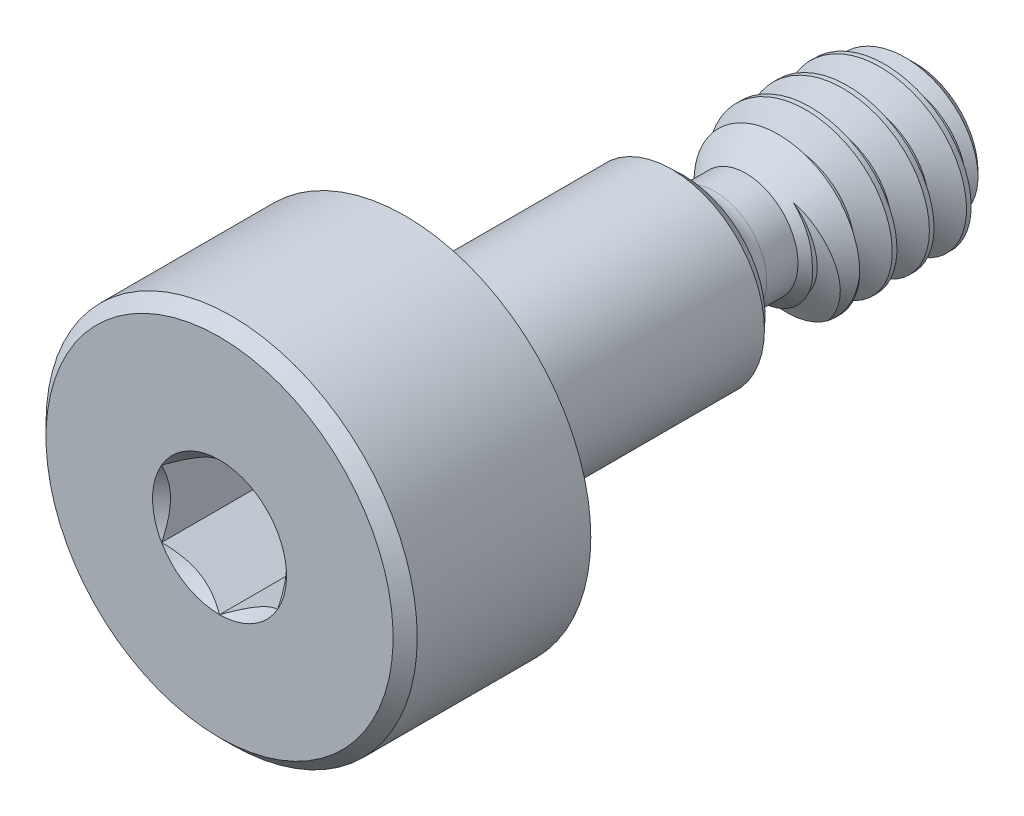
ISO-10303-21;
HEADER;
FILE_DESCRIPTION(('STEP AP214'),'2;1');
FILE_NAME('part.step','',(''),(''),'','','');
FILE_SCHEMA(('AUTOMOTIVE_DESIGN { 1 0 10303 214 1 1 1 1 }'));
ENDSEC;
DATA;
#1=APPLICATION_CONTEXT('core data for automotive mechanical design processes');
#2=APPLICATION_PROTOCOL_DEFINITION('international standard','automotive_design',2000,#1);
#3=PRODUCT_CONTEXT('',#1,'mechanical');
#4=PRODUCT('Part','Part','',(#3));
#5=PRODUCT_RELATED_PRODUCT_CATEGORY('part','',(#4));
#6=PRODUCT_DEFINITION_FORMATION('','',#4);
#7=PRODUCT_DEFINITION_CONTEXT('part definition',#1,'design');
#8=PRODUCT_DEFINITION('design','',#6,#7);
#9=PRODUCT_DEFINITION_SHAPE('','',#8);
#10=(LENGTH_UNIT() NAMED_UNIT(*) SI_UNIT(.MILLI.,.METRE.));
#11=(NAMED_UNIT(*) PLANE_ANGLE_UNIT() SI_UNIT($,.RADIAN.));
#12=(NAMED_UNIT(*) SI_UNIT($,.STERADIAN.) SOLID_ANGLE_UNIT());
#13=UNCERTAINTY_MEASURE_WITH_UNIT(LENGTH_MEASURE(1.E-05),#10,'distance_accuracy_value','');
#14=(GEOMETRIC_REPRESENTATION_CONTEXT(3) GLOBAL_UNCERTAINTY_ASSIGNED_CONTEXT((#13)) GLOBAL_UNIT_ASSIGNED_CONTEXT((#10,
#11,#12)) REPRESENTATION_CONTEXT('',''));
#15=CARTESIAN_POINT('',(0.,0.,0.));
#16=DIRECTION('',(0.,0.,1.));
#17=DIRECTION('',(1.,0.,0.));
#18=AXIS2_PLACEMENT_3D('',#15,#16,#17);
#19=CARTESIAN_POINT('',(0.,0.,-9.0043));
#20=DIRECTION('',(0.,0.,-1.));
#21=DIRECTION('',(0.,1.,0.));
#22=AXIS2_PLACEMENT_3D('',#19,#20,#21);
#23=CONICAL_SURFACE('',#22,0.889,0.785398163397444);
#24=CARTESIAN_POINT('',(0.,0.,-9.0043));
#25=DIRECTION('',(0.,0.,-1.));
#26=DIRECTION('',(0.,1.,0.));
#27=AXIS2_PLACEMENT_3D('',#24,#25,#26);
#28=CIRCLE('',#27,0.889);
#29=CARTESIAN_POINT('',(0.,0.888999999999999,-9.0043));
#30=VERTEX_POINT('',#29);
#31=EDGE_CURVE('E393',#30,#30,#28,.T.);
#32=ORIENTED_EDGE('',*,*,#31,.T.);
#33=EDGE_LOOP('',(#32));
#34=FACE_BOUND('',#33,.T.);
#35=CARTESIAN_POINT('',(0.865303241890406,-1.12892517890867,-9.53770000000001));
#36=CARTESIAN_POINT('',(0.892899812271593,-1.09895243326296,-9.53069646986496));
#37=CARTESIAN_POINT('',(0.919208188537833,-1.06779994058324,-9.52367764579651));
#38=CARTESIAN_POINT('',(0.969080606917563,-1.00336827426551,-9.50966607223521));
#39=CARTESIAN_POINT('',(0.992644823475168,-0.970089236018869,-9.50267332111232));
#40=CARTESIAN_POINT('',(1.03702407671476,-0.901386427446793,-9.48871948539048));
#41=CARTESIAN_POINT('',(1.05781804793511,-0.865948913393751,-9.48175899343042));
#42=CARTESIAN_POINT('',(1.09629562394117,-0.793395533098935,-9.46796397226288));
#43=CARTESIAN_POINT('',(1.11397852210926,-0.756279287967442,-9.46112947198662));
#44=CARTESIAN_POINT('',(1.14626060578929,-0.680419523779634,-9.44767597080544));
#45=CARTESIAN_POINT('',(1.160841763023,-0.641667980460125,-9.4410584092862));
#46=CARTESIAN_POINT('',(1.18584315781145,-0.562930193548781,-9.42734121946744));
#47=CARTESIAN_POINT('',(1.19626517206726,-0.522944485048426,-9.4202417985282));
#48=CARTESIAN_POINT('',(1.21290721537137,-0.44235142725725,-9.40572094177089));
#49=CARTESIAN_POINT('',(1.21914455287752,-0.401747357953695,-9.39830096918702));
#50=CARTESIAN_POINT('',(1.22740024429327,-0.320161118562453,-9.38312895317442));
#51=CARTESIAN_POINT('',(1.22941769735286,-0.279178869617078,-9.37537683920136));
#52=CARTESIAN_POINT('',(1.22923218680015,-0.203528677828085,-9.3608025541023));
#53=CARTESIAN_POINT('',(1.22762599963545,-0.168851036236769,-9.35401888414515));
#54=CARTESIAN_POINT('',(1.22139120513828,-0.0998220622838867,-9.34029183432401));
#55=CARTESIAN_POINT('',(1.21676338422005,-0.0654706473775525,-9.3333484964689));
#56=CARTESIAN_POINT('',(1.19834665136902,0.0368932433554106,-9.31229392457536));
#57=CARTESIAN_POINT('',(1.18002472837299,0.104129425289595,-9.29797461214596));
#58=CARTESIAN_POINT('',(1.1442349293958,0.200925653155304,-9.27656575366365));
#59=CARTESIAN_POINT('',(1.13111014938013,0.232189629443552,-9.26951891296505));
#60=CARTESIAN_POINT('',(1.10220948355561,0.293486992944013,-9.25543339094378));
#61=CARTESIAN_POINT('',(1.08643344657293,0.323520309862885,-9.24839471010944));
#62=CARTESIAN_POINT('',(1.05239595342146,0.382049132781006,-9.23440853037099));
#63=CARTESIAN_POINT('',(1.03414125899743,0.410548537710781,-9.22746083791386));
#64=CARTESIAN_POINT('',(0.995225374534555,0.465886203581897,-9.21367456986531));
#65=CARTESIAN_POINT('',(0.974564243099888,0.492724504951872,-9.20683599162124));
#66=CARTESIAN_POINT('',(0.943481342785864,0.529780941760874,-9.19725330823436));
#67=CARTESIAN_POINT('',(0.933955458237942,0.540732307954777,-9.19440263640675));
#68=CARTESIAN_POINT('',(0.914429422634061,0.562181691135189,-9.18862528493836));
#69=CARTESIAN_POINT('',(0.904429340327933,0.572679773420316,-9.18569861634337));
#70=CARTESIAN_POINT('',(0.873755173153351,0.603444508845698,-9.17680392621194));
#71=CARTESIAN_POINT('',(0.852392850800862,0.622998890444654,-9.17071690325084));
#72=CARTESIAN_POINT('',(0.807929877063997,0.660115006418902,-9.15822835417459));
#73=CARTESIAN_POINT('',(0.784822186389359,0.677667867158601,-9.15182559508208));
#74=CARTESIAN_POINT('',(0.737097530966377,0.71057694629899,-9.138741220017));
#75=CARTESIAN_POINT('',(0.712477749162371,0.725928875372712,-9.13205909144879));
#76=CARTESIAN_POINT('',(0.687221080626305,0.740092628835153,-9.12525540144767));
#77=B_SPLINE_CURVE_WITH_KNOTS('',3,(#35,#36,#37,#38,#39,#40,#41,#42,#43,#44,#45,#46,#47,#48,#49,
#50,#51,#52,#53,#54,#55,#56,#57,#58,#59,#60,#61,#62,#63,#64,#65,#66,#67,#68,#69,#70,#71,#72,#73,
#74,#75,#76),.UNSPECIFIED.,.F.,.F.,(4,2,2,2,2,2,2,2,2,2,2,2,2,2,2,2,2,2,2,2,4),(0.,
0.123979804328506,0.247951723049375,0.372818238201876,0.497713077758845,0.623315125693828,
0.748863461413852,0.873889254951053,0.998941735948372,1.10492089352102,1.21087247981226,
1.42303487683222,1.52683839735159,1.63064783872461,1.73417957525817,1.83770879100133,
1.88207491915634,1.92643463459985,2.01508585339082,2.10411596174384,2.19331728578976),.UNSPECIFIED.);
#78=CARTESIAN_POINT('',(0.865303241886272,-1.12892517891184,-9.5377000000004));
#79=VERTEX_POINT('',#78);
#80=CARTESIAN_POINT('',(0.687221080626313,0.740092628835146,-9.12525540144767));
#81=VERTEX_POINT('',#80);
#82=EDGE_CURVE('E292',#79,#81,#77,.T.);
#83=ORIENTED_EDGE('',*,*,#82,.F.);
#84=CARTESIAN_POINT('',(0.,0.,-9.53770000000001));
#85=DIRECTION('',(0.,0.,-1.));
#86=DIRECTION('',(0.,1.,0.));
#87=AXIS2_PLACEMENT_3D('',#84,#85,#86);
#88=CIRCLE('',#87,1.42240000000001);
#89=CARTESIAN_POINT('',(1.4121215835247,-0.170687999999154,-9.53769999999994));
#90=VERTEX_POINT('',#89);
#91=EDGE_CURVE('E138',#79,#90,#88,.F.);
#92=ORIENTED_EDGE('',*,*,#91,.T.);
#93=CARTESIAN_POINT('',(1.0095840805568,0.0273842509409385,-9.12525540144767));
#94=CARTESIAN_POINT('',(1.01224263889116,-0.000988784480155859,-9.12714334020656));
#95=CARTESIAN_POINT('',(1.01369810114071,-0.0294625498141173,-9.12902793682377));
#96=CARTESIAN_POINT('',(1.01419872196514,-0.0864267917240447,-9.13277758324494));
#97=CARTESIAN_POINT('',(1.01324436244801,-0.114917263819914,-9.13464263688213));
#98=CARTESIAN_POINT('',(1.00677721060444,-0.199944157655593,-9.14017668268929));
#99=CARTESIAN_POINT('',(0.997679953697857,-0.256248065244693,-9.14379867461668));
#100=CARTESIAN_POINT('',(0.970145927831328,-0.36659515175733,-9.15084405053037));
#101=CARTESIAN_POINT('',(0.951701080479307,-0.4206363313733,-9.15426725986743));
#102=CARTESIAN_POINT('',(0.917404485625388,-0.498752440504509,-9.1591271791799));
#103=CARTESIAN_POINT('',(0.904857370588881,-0.524315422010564,-9.16070224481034));
#104=CARTESIAN_POINT('',(0.877774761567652,-0.574369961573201,-9.16390990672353));
#105=CARTESIAN_POINT('',(0.863238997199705,-0.598861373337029,-9.16554251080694));
#106=CARTESIAN_POINT('',(0.83197115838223,-0.647086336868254,-9.1688927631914));
#107=CARTESIAN_POINT('',(0.815201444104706,-0.670795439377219,-9.170611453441));
#108=CARTESIAN_POINT('',(0.779811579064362,-0.716774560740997,-9.17408813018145));
#109=CARTESIAN_POINT('',(0.761191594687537,-0.739044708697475,-9.17584611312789));
#110=CARTESIAN_POINT('',(0.702718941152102,-0.803488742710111,-9.18116217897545));
#111=CARTESIAN_POINT('',(0.660235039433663,-0.843324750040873,-9.18476436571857));
#112=CARTESIAN_POINT('',(0.567355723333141,-0.917264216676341,-9.19214535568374));
#113=CARTESIAN_POINT('',(0.516688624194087,-0.951025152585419,-9.195924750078));
#114=CARTESIAN_POINT('',(0.41041084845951,-1.00954091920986,-9.2033920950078));
#115=CARTESIAN_POINT('',(0.354801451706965,-1.03429807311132,-9.20708006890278));
#116=CARTESIAN_POINT('',(0.240178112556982,-1.07411260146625,-9.2142723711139));
#117=CARTESIAN_POINT('',(0.181164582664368,-1.08917114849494,-9.21777672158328));
#118=CARTESIAN_POINT('',(0.0914166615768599,-1.10415994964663,-9.22282184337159));
#119=CARTESIAN_POINT('',(0.0612783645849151,-1.1078896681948,-9.22446920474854));
#120=CARTESIAN_POINT('',(0.000789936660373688,-1.11280626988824,-9.22769396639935));
#121=CARTESIAN_POINT('',(-0.029560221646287,-1.11399281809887,-9.22927135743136));
#122=CARTESIAN_POINT('',(-0.121049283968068,-1.11394569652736,-9.23414172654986));
#123=CARTESIAN_POINT('',(-0.182219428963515,-1.10904064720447,-9.23755328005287));
#124=CARTESIAN_POINT('',(-0.302961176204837,-1.08951676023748,-9.24450289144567));
#125=CARTESIAN_POINT('',(-0.36253257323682,-1.07489668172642,-9.24804096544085));
#126=CARTESIAN_POINT('',(-0.481709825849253,-1.03529417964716,-9.25536355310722));
#127=CARTESIAN_POINT('',(-0.541145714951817,-1.00979741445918,-9.2591510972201));
#128=CARTESIAN_POINT('',(-0.654869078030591,-0.949181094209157,-9.26667180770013));
#129=CARTESIAN_POINT('',(-0.709157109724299,-0.914062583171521,-9.27040497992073));
#130=CARTESIAN_POINT('',(-0.811081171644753,-0.835161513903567,-9.27771726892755));
#131=CARTESIAN_POINT('',(-0.858717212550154,-0.791378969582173,-9.28129638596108));
#132=CARTESIAN_POINT('',(-0.924122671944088,-0.720223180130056,-9.28648898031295));
#133=CARTESIAN_POINT('',(-0.944925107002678,-0.695577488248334,-9.28819128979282));
#134=CARTESIAN_POINT('',(-0.984372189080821,-0.644599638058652,-9.29150700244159));
#135=CARTESIAN_POINT('',(-1.00301676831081,-0.618267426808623,-9.29312040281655));
#136=CARTESIAN_POINT('',(-1.03803677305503,-0.564224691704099,-9.29633253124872));
#137=CARTESIAN_POINT('',(-1.05441730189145,-0.536517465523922,-9.29793128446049));
#138=CARTESIAN_POINT('',(-1.08493910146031,-0.479908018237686,-9.30120551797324));
#139=CARTESIAN_POINT('',(-1.09908033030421,-0.451005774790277,-9.30288099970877));
#140=CARTESIAN_POINT('',(-1.13797882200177,-0.36273841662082,-9.30796915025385));
#141=CARTESIAN_POINT('',(-1.15922892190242,-0.301784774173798,-9.31144517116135));
#142=CARTESIAN_POINT('',(-1.19276042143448,-0.173561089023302,-9.31869481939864));
#143=CARTESIAN_POINT('',(-1.20442658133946,-0.106131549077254,-9.32247378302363));
#144=CARTESIAN_POINT('',(-1.21625814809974,0.0297320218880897,-9.33001627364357));
#145=CARTESIAN_POINT('',(-1.21642451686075,0.0981659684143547,-9.33377980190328));
#146=CARTESIAN_POINT('',(-1.20525107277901,0.234105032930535,-9.34118446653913));
#147=CARTESIAN_POINT('',(-1.19390744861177,0.301609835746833,-9.34482556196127));
#148=CARTESIAN_POINT('',(-1.16002854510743,0.433801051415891,-9.35191389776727));
#149=CARTESIAN_POINT('',(-1.13749376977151,0.498487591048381,-9.35536114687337));
#150=CARTESIAN_POINT('',(-1.09579751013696,0.591857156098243,-9.3602516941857));
#151=CARTESIAN_POINT('',(-1.08059096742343,0.622358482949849,-9.36183456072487));
#152=CARTESIAN_POINT('',(-1.04778295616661,0.682051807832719,-9.36505503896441));
#153=CARTESIAN_POINT('',(-1.0301812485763,0.711243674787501,-9.36669265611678));
#154=CARTESIAN_POINT('',(-0.992700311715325,0.768138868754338,-9.3700243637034));
#155=CARTESIAN_POINT('',(-0.972820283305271,0.795841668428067,-9.37171847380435));
#156=CARTESIAN_POINT('',(-0.930921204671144,0.849563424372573,-9.37514653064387));
#157=CARTESIAN_POINT('',(-0.908902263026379,0.875582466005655,-9.37688047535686));
#158=CARTESIAN_POINT('',(-0.837696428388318,0.953193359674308,-9.38228822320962));
#159=CARTESIAN_POINT('',(-0.785079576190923,1.00171286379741,-9.38601439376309));
#160=CARTESIAN_POINT('',(-0.672533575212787,1.08927956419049,-9.39348447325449));
#161=CARTESIAN_POINT('',(-0.612605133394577,1.12832767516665,-9.39722838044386));
#162=CARTESIAN_POINT('',(-0.486464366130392,1.19624124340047,-9.40466972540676));
#163=CARTESIAN_POINT('',(-0.420196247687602,1.22500323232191,-9.4083663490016));
#164=CARTESIAN_POINT('',(-0.283732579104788,1.27097973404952,-9.41558028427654));
#165=CARTESIAN_POINT('',(-0.213537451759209,1.28819548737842,-9.41909761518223));
#166=CARTESIAN_POINT('',(-0.106927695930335,1.30498102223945,-9.42415976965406));
#167=CARTESIAN_POINT('',(-0.0711768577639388,1.30906991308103,-9.42581129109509));
#168=CARTESIAN_POINT('',(0.000546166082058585,1.31423740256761,-9.42904669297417));
#169=CARTESIAN_POINT('',(0.0365183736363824,1.31531569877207,-9.43063056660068));
#170=CARTESIAN_POINT('',(0.144396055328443,1.31424219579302,-9.435500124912));
#171=CARTESIAN_POINT('',(0.216297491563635,1.30778723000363,-9.43890516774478));
#172=CARTESIAN_POINT('',(0.360559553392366,1.28304191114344,-9.44596561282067));
#173=CARTESIAN_POINT('',(0.432850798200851,1.26435182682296,-9.44962559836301));
#174=CARTESIAN_POINT('',(0.573344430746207,1.21530712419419,-9.45700454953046));
#175=CARTESIAN_POINT('',(0.641547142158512,1.18495343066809,-9.46072351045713));
#176=CARTESIAN_POINT('',(0.773221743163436,1.11271486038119,-9.4681813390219));
#177=CARTESIAN_POINT('',(0.836585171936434,1.07063050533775,-9.47191934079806));
#178=CARTESIAN_POINT('',(0.925581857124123,1.00003915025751,-9.47740981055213));
#179=CARTESIAN_POINT('',(0.95424363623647,0.975259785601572,-9.47922083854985));
#180=CARTESIAN_POINT('',(1.00940708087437,0.92334556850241,-9.48279389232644));
#181=CARTESIAN_POINT('',(1.03590708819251,0.896208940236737,-9.48455587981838));
#182=CARTESIAN_POINT('',(1.086495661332,0.839836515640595,-9.48802283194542));
#183=CARTESIAN_POINT('',(1.1105872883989,0.810603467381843,-9.48972786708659));
#184=CARTESIAN_POINT('',(1.1562171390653,0.750182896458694,-9.49304516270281));
#185=CARTESIAN_POINT('',(1.17775420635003,0.718994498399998,-9.49465738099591));
#186=CARTESIAN_POINT('',(1.21820215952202,0.654949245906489,-9.49788547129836));
#187=CARTESIAN_POINT('',(1.23711221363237,0.622091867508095,-9.49950134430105));
#188=CARTESIAN_POINT('',(1.27224052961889,0.554989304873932,-9.50280774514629));
#189=CARTESIAN_POINT('',(1.28845978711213,0.520744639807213,-9.5044982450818));
#190=CARTESIAN_POINT('',(1.31846811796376,0.450174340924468,-9.50796370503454));
#191=CARTESIAN_POINT('',(1.33218506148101,0.413817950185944,-9.50973971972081));
#192=CARTESIAN_POINT('',(1.35656782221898,0.340151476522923,-9.51332549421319));
#193=CARTESIAN_POINT('',(1.36723654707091,0.302842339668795,-9.51513522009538));
#194=CARTESIAN_POINT('',(1.39455648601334,0.189831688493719,-9.52059465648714));
#195=CARTESIAN_POINT('',(1.40657145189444,0.112929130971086,-9.52428041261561));
#196=CARTESIAN_POINT('',(1.41470988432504,0.00129639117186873,-9.52958891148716));
#197=CARTESIAN_POINT('',(1.4159524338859,-0.0331479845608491,-9.53122115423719));
#198=CARTESIAN_POINT('',(1.41591841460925,-0.101981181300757,-9.53447185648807));
#199=CARTESIAN_POINT('',(1.41464585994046,-0.136370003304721,-9.53609033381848));
#200=CARTESIAN_POINT('',(1.41212158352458,-0.170688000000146,-9.53770000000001));
#201=B_SPLINE_CURVE_WITH_KNOTS('',3,(#93,#94,#95,#96,#97,#98,#99,#100,#101,#102,#103,#104,#105,
#106,#107,#108,#109,#110,#111,#112,#113,#114,#115,#116,#117,#118,#119,#120,#121,#122,#123,#124,
#125,#126,#127,#128,#129,#130,#131,#132,#133,#134,#135,#136,#137,#138,#139,#140,#141,#142,#143,
#144,#145,#146,#147,#148,#149,#150,#151,#152,#153,#154,#155,#156,#157,#158,#159,#160,#161,#162,
#163,#164,#165,#166,#167,#168,#169,#170,#171,#172,#173,#174,#175,#176,#177,#178,#179,#180,#181,
#182,#183,#184,#185,#186,#187,#188,#189,#190,#191,#192,#193,#194,#195,#196,#197,#198,#199,#200),
.UNSPECIFIED.,.F.,.F.,(4,2,2,2,2,2,2,2,2,2,2,2,2,2,2,2,2,2,2,2,2,2,2,2,2,2,2,2,2,2,2,2,2,2,2,2,
2,2,2,2,2,2,2,2,2,2,2,2,2,2,2,2,2,4),(0.,0.085629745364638,0.171242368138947,0.341835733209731,
0.512576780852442,0.598055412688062,0.683545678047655,0.770720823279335,0.857888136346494,
1.0321217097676,1.21426841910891,1.39636809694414,1.57844575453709,1.66958967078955,
1.76074558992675,1.94428212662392,2.12784211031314,2.32126017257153,2.51465725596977,
2.70805402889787,2.80484739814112,2.90164380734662,2.99821834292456,3.09479468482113,
3.28784871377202,3.49249633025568,3.69712682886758,3.90182510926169,4.10651417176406,
4.20877442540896,4.31104489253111,4.41335134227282,4.51565260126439,4.72957211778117,
4.94347096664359,5.15946462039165,5.3754350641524,5.48338911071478,5.5913540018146,
5.80717903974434,6.03043286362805,6.25366898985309,6.48096084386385,6.59464485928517,
6.70841527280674,6.82203918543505,6.93571433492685,7.04942539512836,7.16309428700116,
7.27964824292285,7.39609064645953,7.62859551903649,7.73204100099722,7.83532151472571),.UNSPECIFIED.);
#202=CARTESIAN_POINT('',(1.0095840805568,0.0273842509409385,-9.12525540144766));
#203=VERTEX_POINT('',#202);
#204=EDGE_CURVE('E283',#203,#90,#201,.T.);
#205=ORIENTED_EDGE('',*,*,#204,.F.);
#206=CARTESIAN_POINT('',(0.687221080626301,0.740092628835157,-9.12525540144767));
#207=CARTESIAN_POINT('',(0.706683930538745,0.722019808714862,-9.12525540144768));
#208=CARTESIAN_POINT('',(0.72542552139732,0.703186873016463,-9.12525540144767));
#209=CARTESIAN_POINT('',(0.76138978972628,0.664080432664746,-9.12525540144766));
#210=CARTESIAN_POINT('',(0.778610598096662,0.643805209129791,-9.12525540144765));
#211=CARTESIAN_POINT('',(0.828167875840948,0.580545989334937,-9.12525540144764));
#212=CARTESIAN_POINT('',(0.857967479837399,0.535529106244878,-9.12525540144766));
#213=CARTESIAN_POINT('',(0.910045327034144,0.441287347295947,-9.12525540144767));
#214=CARTESIAN_POINT('',(0.93231389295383,0.392057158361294,-9.12525540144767));
#215=CARTESIAN_POINT('',(0.968587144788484,0.29103518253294,-9.12525540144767));
#216=CARTESIAN_POINT('',(0.982649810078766,0.239264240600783,-9.12525540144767));
#217=CARTESIAN_POINT('',(1.00244211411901,0.134165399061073,-9.12525540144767));
#218=CARTESIAN_POINT('',(1.00817336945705,0.0808378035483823,-9.12525540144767));
#219=CARTESIAN_POINT('',(1.0095840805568,0.0273842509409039,-9.12525540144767));
#220=B_SPLINE_CURVE_WITH_KNOTS('',3,(#206,#207,#208,#209,#210,#211,#212,#213,#214,#215,#216,
#217,#218,#219),.UNSPECIFIED.,.F.,.F.,(4,2,2,2,2,2,4),(0.,0.0796365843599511,0.159369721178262,
0.320583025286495,0.482002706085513,0.642267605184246,0.802501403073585),.UNSPECIFIED.);
#221=EDGE_CURVE('E298',#81,#203,#220,.T.);
#222=ORIENTED_EDGE('',*,*,#221,.F.);
#223=EDGE_LOOP('',(#83,#92,#205,#222));
#224=FACE_BOUND('',#223,.T.);
#225=ADVANCED_FACE('F42',(#34,#224),#23,.T.);
#226=CARTESIAN_POINT('',(0.,-1.42240000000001,-11.90625));
#227=DIRECTION('',(0.,0.,-1.));
#228=DIRECTION('',(0.,1.,0.));
#229=AXIS2_PLACEMENT_3D('',#226,#227,#228);
#230=PLANE('',#229);
#231=CARTESIAN_POINT('',(0.,0.,-11.90625));
#232=DIRECTION('',(0.,0.,-1.));
#233=DIRECTION('',(0.,1.,0.));
#234=AXIS2_PLACEMENT_3D('',#231,#232,#233);
#235=CIRCLE('',#234,1.06680000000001);
#236=CARTESIAN_POINT('',(-0.958037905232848,-0.469282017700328,-11.9062499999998));
#237=VERTEX_POINT('',#236);
#238=CARTESIAN_POINT('',(0.348253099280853,-1.00835609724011,-11.90625));
#239=VERTEX_POINT('',#238);
#240=EDGE_CURVE('E154',#237,#239,#235,.T.);
#241=ORIENTED_EDGE('',*,*,#240,.T.);
#242=CARTESIAN_POINT('',(1.07960160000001,-0.532583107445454,-11.90625));
#243=CARTESIAN_POINT('',(1.07056275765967,-0.545920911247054,-11.90625));
#244=CARTESIAN_POINT('',(1.0613032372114,-0.559111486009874,-11.90625));
#245=CARTESIAN_POINT('',(1.04228545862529,-0.585130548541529,-11.90625));
#246=CARTESIAN_POINT('',(1.03252712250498,-0.597958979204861,-11.90625));
#247=CARTESIAN_POINT('',(1.00242363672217,-0.63579146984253,-11.90625));
#248=CARTESIAN_POINT('',(0.981248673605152,-0.660144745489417,-11.90625));
#249=CARTESIAN_POINT('',(0.936847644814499,-0.706876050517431,-11.90625));
#250=CARTESIAN_POINT('',(0.913622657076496,-0.729255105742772,-11.90625));
#251=CARTESIAN_POINT('',(0.865302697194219,-0.771875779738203,-11.90625));
#252=CARTESIAN_POINT('',(0.840207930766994,-0.792117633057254,-11.90625));
#253=CARTESIAN_POINT('',(0.763012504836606,-0.848927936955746,-11.90625));
#254=CARTESIAN_POINT('',(0.708417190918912,-0.882193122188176,-11.90625));
#255=CARTESIAN_POINT('',(0.594291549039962,-0.938663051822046,-11.90625));
#256=CARTESIAN_POINT('',(0.534762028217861,-0.961869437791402,-11.90625));
#257=CARTESIAN_POINT('',(0.414819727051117,-0.996868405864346,-11.90625));
#258=CARTESIAN_POINT('',(0.354519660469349,-1.00904883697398,-11.90625));
#259=CARTESIAN_POINT('',(0.232772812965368,-1.02305696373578,-11.90625));
#260=CARTESIAN_POINT('',(0.171327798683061,-1.0248994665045,-11.90625));
#261=CARTESIAN_POINT('',(0.0917692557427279,-1.02058354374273,-11.90625));
#262=CARTESIAN_POINT('',(0.0733240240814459,-1.01910920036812,-11.90625));
#263=CARTESIAN_POINT('',(0.0365642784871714,-1.015228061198,-11.90625));
#264=CARTESIAN_POINT('',(0.0182495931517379,-1.01282288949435,-11.90625));
#265=CARTESIAN_POINT('',(0.,-1.00995540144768,-11.90625));
#266=B_SPLINE_CURVE_WITH_KNOTS('',3,(#242,#243,#244,#245,#246,#247,#248,#249,#250,#251,#252,
#253,#254,#255,#256,#257,#258,#259,#260,#261,#262,#263,#264,#265),.UNSPECIFIED.,.F.,.F.,(4,2,2,
2,2,2,2,2,2,2,2,4),(0.,0.048335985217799,0.0966795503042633,0.193359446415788,0.289988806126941,
0.386607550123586,0.577343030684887,0.768047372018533,0.951748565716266,1.13518657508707,
1.19068252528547,1.24608208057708),.UNSPECIFIED.);
#267=CARTESIAN_POINT('',(0.,-1.00995540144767,-11.90625));
#268=VERTEX_POINT('',#267);
#269=EDGE_CURVE('E147',#239,#268,#266,.T.);
#270=ORIENTED_EDGE('',*,*,#269,.T.);
#271=CARTESIAN_POINT('',(0.,-1.00995540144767,-11.90625));
#272=CARTESIAN_POINT('',(-0.026558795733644,-1.00995518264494,-11.90625));
#273=CARTESIAN_POINT('',(-0.0531063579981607,-1.00890717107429,-11.90625));
#274=CARTESIAN_POINT('',(-0.106070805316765,-1.0047219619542,-11.90625));
#275=CARTESIAN_POINT('',(-0.132487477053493,-1.00158206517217,-11.90625));
#276=CARTESIAN_POINT('',(-0.211851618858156,-0.988946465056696,-11.90625));
#277=CARTESIAN_POINT('',(-0.26432303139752,-0.976234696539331,-11.90625));
#278=CARTESIAN_POINT('',(-0.366612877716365,-0.942608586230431,-11.90625));
#279=CARTESIAN_POINT('',(-0.416428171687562,-0.921684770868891,-11.90625));
#280=CARTESIAN_POINT('',(-0.508912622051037,-0.873808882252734,-11.90625));
#281=CARTESIAN_POINT('',(-0.551836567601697,-0.847348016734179,-11.90625));
#282=CARTESIAN_POINT('',(-0.633260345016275,-0.788373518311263,-11.90625));
#283=CARTESIAN_POINT('',(-0.671762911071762,-0.755863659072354,-11.90625));
#284=CARTESIAN_POINT('',(-0.707604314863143,-0.720628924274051,-11.90625));
#285=B_SPLINE_CURVE_WITH_KNOTS('',3,(#271,#272,#273,#274,#275,#276,#277,#278,#279,#280,#281,
#282,#283,#284),.UNSPECIFIED.,.F.,.F.,(4,2,2,2,2,2,4),(0.,0.0796333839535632,0.159369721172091,
0.320592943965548,0.482002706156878,0.632719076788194,0.783341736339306),.UNSPECIFIED.);
#286=CARTESIAN_POINT('',(-0.70760431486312,-0.720628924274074,-11.90625));
#287=VERTEX_POINT('',#286);
#288=EDGE_CURVE('E12',#268,#287,#285,.T.);
#289=ORIENTED_EDGE('',*,*,#288,.T.);
#290=CARTESIAN_POINT('',(-0.707604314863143,-0.720628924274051,-11.90625));
#291=CARTESIAN_POINT('',(-0.726310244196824,-0.707769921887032,-11.90625));
#292=CARTESIAN_POINT('',(-0.744555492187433,-0.694241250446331,-11.90625));
#293=CARTESIAN_POINT('',(-0.780028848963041,-0.665929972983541,-11.90625));
#294=CARTESIAN_POINT('',(-0.797257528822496,-0.651148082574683,-11.90625));
#295=CARTESIAN_POINT('',(-0.830316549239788,-0.620683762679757,-11.90625));
#296=CARTESIAN_POINT('',(-0.846166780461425,-0.605022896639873,-11.90625));
#297=CARTESIAN_POINT('',(-0.876743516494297,-0.572632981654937,-11.90625));
#298=CARTESIAN_POINT('',(-0.891469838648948,-0.555903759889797,-11.90625));
#299=CARTESIAN_POINT('',(-0.914561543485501,-0.527775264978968,-11.90625));
#300=CARTESIAN_POINT('',(-0.923282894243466,-0.51666535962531,-11.90625));
#301=CARTESIAN_POINT('',(-0.940319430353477,-0.49413788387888,-11.90625));
#302=CARTESIAN_POINT('',(-0.948634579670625,-0.482720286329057,-11.90625));
#303=CARTESIAN_POINT('',(-0.972934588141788,-0.44800468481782,-11.90625));
#304=CARTESIAN_POINT('',(-0.988271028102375,-0.424247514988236,-11.90625));
#305=CARTESIAN_POINT('',(-1.01748059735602,-0.375066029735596,-11.90625));
#306=CARTESIAN_POINT('',(-1.03130895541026,-0.349615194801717,-11.90625));
#307=CARTESIAN_POINT('',(-1.05696825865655,-0.297753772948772,-11.90625));
#308=CARTESIAN_POINT('',(-1.06880094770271,-0.271344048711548,-11.90625));
#309=CARTESIAN_POINT('',(-1.0796016,-0.244516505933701,-11.90625));
#310=B_SPLINE_CURVE_WITH_KNOTS('',3,(#290,#291,#292,#293,#294,#295,#296,#297,#298,#299,#300,
#301,#302,#303,#304,#305,#306,#307,#308,#309),.UNSPECIFIED.,.F.,.F.,(4,2,2,2,2,2,2,2,2,4),(0.,
0.068083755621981,0.13612889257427,0.202922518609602,0.269726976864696,0.312089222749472,
0.354455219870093,0.439201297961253,0.52601271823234,0.612747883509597),.UNSPECIFIED.);
#311=EDGE_CURVE('E335',#287,#237,#310,.T.);
#312=ORIENTED_EDGE('',*,*,#311,.T.);
#313=EDGE_LOOP('',(#241,#270,#289,#312));
#314=FACE_BOUND('',#313,.T.);
#315=ADVANCED_FACE('F266',(#314),#230,.T.);
#316=CARTESIAN_POINT('',(0.,0.,-11.90625));
#317=DIRECTION('',(0.,0.,-1.));
#318=DIRECTION('',(0.,1.,0.));
#319=AXIS2_PLACEMENT_3D('',#316,#317,#318);
#320=CYLINDRICAL_SURFACE('',#319,1.42240000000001);
#321=CARTESIAN_POINT('',(0.,1.42240000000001,-11.90625));
#322=CARTESIAN_POINT('',(-0.821223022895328,1.42240000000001,-11.8533333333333));
#323=CARTESIAN_POINT('',(-1.23183453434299,0.711200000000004,-11.8004166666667));
#324=CARTESIAN_POINT('',(-1.64244604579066,0.,-11.7475));
#325=CARTESIAN_POINT('',(-1.23183453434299,-0.711200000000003,-11.6945833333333));
#326=CARTESIAN_POINT('',(-0.821223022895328,-1.42240000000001,-11.6416666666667));
#327=CARTESIAN_POINT('',(0.,-1.42240000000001,-11.58875));
#328=CARTESIAN_POINT('',(0.821223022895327,-1.42240000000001,-11.5358333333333));
#329=CARTESIAN_POINT('',(1.23183453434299,-0.711200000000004,-11.4829166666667));
#330=CARTESIAN_POINT('',(1.64244604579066,0.,-11.43));
#331=CARTESIAN_POINT('',(1.23183453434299,0.711200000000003,-11.3770833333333));
#332=CARTESIAN_POINT('',(0.821223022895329,1.42240000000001,-11.3241666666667));
#333=CARTESIAN_POINT('',(0.,1.42240000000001,-11.27125));
#334=CARTESIAN_POINT('',(-0.821223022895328,1.42240000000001,-11.2183333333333));
#335=CARTESIAN_POINT('',(-1.23183453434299,0.711200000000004,-11.1654166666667));
#336=CARTESIAN_POINT('',(-1.64244604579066,0.,-11.1125));
#337=CARTESIAN_POINT('',(-1.23183453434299,-0.711200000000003,-11.0595833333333));
#338=CARTESIAN_POINT('',(-0.821223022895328,-1.42240000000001,-11.0066666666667));
#339=CARTESIAN_POINT('',(0.,-1.42240000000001,-10.95375));
#340=CARTESIAN_POINT('',(0.821223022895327,-1.42240000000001,-10.9008333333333));
#341=CARTESIAN_POINT('',(1.23183453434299,-0.711200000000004,-10.8479166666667));
#342=CARTESIAN_POINT('',(1.64244604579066,0.,-10.795));
#343=CARTESIAN_POINT('',(1.23183453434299,0.711200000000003,-10.7420833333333));
#344=CARTESIAN_POINT('',(0.821223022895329,1.42240000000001,-10.6891666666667));
#345=CARTESIAN_POINT('',(0.,1.42240000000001,-10.63625));
#346=CARTESIAN_POINT('',(-0.821223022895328,1.42240000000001,-10.5833333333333));
#347=CARTESIAN_POINT('',(-1.23183453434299,0.711200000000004,-10.5304166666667));
#348=CARTESIAN_POINT('',(-1.64244604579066,0.,-10.4775));
#349=CARTESIAN_POINT('',(-1.23183453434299,-0.711200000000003,-10.4245833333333));
#350=CARTESIAN_POINT('',(-0.821223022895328,-1.42240000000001,-10.3716666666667));
#351=CARTESIAN_POINT('',(0.,-1.42240000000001,-10.31875));
#352=CARTESIAN_POINT('',(0.821223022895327,-1.42240000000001,-10.2658333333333));
#353=CARTESIAN_POINT('',(1.23183453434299,-0.711200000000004,-10.2129166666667));
#354=CARTESIAN_POINT('',(1.64244604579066,0.,-10.16));
#355=CARTESIAN_POINT('',(1.23183453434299,0.711200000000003,-10.1070833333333));
#356=CARTESIAN_POINT('',(0.821223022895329,1.42240000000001,-10.0541666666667));
#357=CARTESIAN_POINT('',(0.,1.42240000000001,-10.00125));
#358=CARTESIAN_POINT('',(-0.821223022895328,1.42240000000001,-9.94833333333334));
#359=CARTESIAN_POINT('',(-1.23183453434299,0.711200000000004,-9.89541666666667));
#360=CARTESIAN_POINT('',(-1.64244604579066,0.,-9.8425));
#361=CARTESIAN_POINT('',(-1.23183453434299,-0.711200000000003,-9.78958333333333));
#362=CARTESIAN_POINT('',(-0.821223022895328,-1.42240000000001,-9.73666666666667));
#363=CARTESIAN_POINT('',(0.,-1.42240000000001,-9.68375));
#364=CARTESIAN_POINT('',(0.821223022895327,-1.42240000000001,-9.63083333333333));
#365=CARTESIAN_POINT('',(1.23183453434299,-0.711200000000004,-9.57791666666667));
#366=CARTESIAN_POINT('',(1.64244604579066,0.,-9.525));
#367=CARTESIAN_POINT('',(1.23183453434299,0.711200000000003,-9.47208333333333));
#368=CARTESIAN_POINT('',(0.821223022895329,1.42240000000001,-9.41916666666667));
#369=CARTESIAN_POINT('',(0.,1.42240000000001,-9.36625));
#370=CARTESIAN_POINT('',(-0.821223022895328,1.42240000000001,-9.31333333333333));
#371=CARTESIAN_POINT('',(-1.23183453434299,0.711200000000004,-9.26041666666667));
#372=CARTESIAN_POINT('',(-1.64244604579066,0.,-9.2075));
#373=CARTESIAN_POINT('',(-1.23183453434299,-0.711200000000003,-9.15458333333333));
#374=CARTESIAN_POINT('',(-0.821223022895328,-1.42240000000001,-9.10166666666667));
#375=CARTESIAN_POINT('',(0.,-1.42240000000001,-9.04875));
#376=CARTESIAN_POINT('',(0.821223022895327,-1.42240000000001,-8.99583333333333));
#377=CARTESIAN_POINT('',(1.23183453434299,-0.711200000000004,-8.94291666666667));
#378=CARTESIAN_POINT('',(1.64244604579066,0.,-8.89));
#379=CARTESIAN_POINT('',(1.23183453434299,0.711200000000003,-8.83708333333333));
#380=CARTESIAN_POINT('',(0.821223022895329,1.42240000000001,-8.78416666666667));
#381=CARTESIAN_POINT('',(0.,1.42240000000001,-8.73125));
#382=CARTESIAN_POINT('',(-0.821223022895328,1.42240000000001,-8.67833333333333));
#383=CARTESIAN_POINT('',(-1.23183453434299,0.711200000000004,-8.62541666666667));
#384=CARTESIAN_POINT('',(-1.64244604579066,0.,-8.5725));
#385=CARTESIAN_POINT('',(-1.23183453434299,-0.711200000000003,-8.51958333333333));
#386=CARTESIAN_POINT('',(-0.821223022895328,-1.42240000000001,-8.46666666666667));
#387=CARTESIAN_POINT('',(0.,-1.42240000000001,-8.41375));
#388=CARTESIAN_POINT('',(0.821223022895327,-1.42240000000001,-8.36083333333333));
#389=CARTESIAN_POINT('',(1.23183453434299,-0.711200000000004,-8.30791666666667));
#390=CARTESIAN_POINT('',(1.64244604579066,0.,-8.255));
#391=CARTESIAN_POINT('',(1.23183453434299,0.711200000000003,-8.20208333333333));
#392=CARTESIAN_POINT('',(0.821223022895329,1.42240000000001,-8.14916666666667));
#393=CARTESIAN_POINT('',(0.,1.42240000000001,-8.09625));
#394=CARTESIAN_POINT('',(-0.821223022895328,1.42240000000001,-8.04333333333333));
#395=CARTESIAN_POINT('',(-1.23183453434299,0.711200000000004,-7.99041666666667));
#396=CARTESIAN_POINT('',(-1.64244604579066,0.,-7.9375));
#397=CARTESIAN_POINT('',(-1.23183453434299,-0.711200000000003,-7.88458333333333));
#398=CARTESIAN_POINT('',(-0.821223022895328,-1.42240000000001,-7.83166666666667));
#399=CARTESIAN_POINT('',(0.,-1.42240000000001,-7.77875));
#400=CARTESIAN_POINT('',(0.821223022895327,-1.42240000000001,-7.72583333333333));
#401=CARTESIAN_POINT('',(1.23183453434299,-0.711200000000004,-7.67291666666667));
#402=CARTESIAN_POINT('',(1.64244604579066,0.,-7.62));
#403=CARTESIAN_POINT('',(1.23183453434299,0.711200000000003,-7.56708333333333));
#404=CARTESIAN_POINT('',(0.821223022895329,1.42240000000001,-7.51416666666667));
#405=CARTESIAN_POINT('',(0.,1.42240000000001,-7.46125));
#406=CARTESIAN_POINT('',(-0.821223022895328,1.42240000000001,-7.40833333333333));
#407=CARTESIAN_POINT('',(-1.23183453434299,0.711200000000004,-7.35541666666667));
#408=CARTESIAN_POINT('',(-1.42240000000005,0.381130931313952,-7.33085795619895));
#409=CARTESIAN_POINT('',(-1.42240000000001,-1.70413809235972E-13,-7.30249999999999));
#410=(BOUNDED_CURVE() B_SPLINE_CURVE(2,(#321,#322,#323,#324,#325,#326,#327,#328,#329,#330,#331,
#332,#333,#334,#335,#336,#337,#338,#339,#340,#341,#342,#343,#344,#345,#346,#347,#348,#349,#350,
#351,#352,#353,#354,#355,#356,#357,#358,#359,#360,#361,#362,#363,#364,#365,#366,#367,#368,#369,
#370,#371,#372,#373,#374,#375,#376,#377,#378,#379,#380,#381,#382,#383,#384,#385,#386,#387,#388,
#389,#390,#391,#392,#393,#394,#395,#396,#397,#398,#399,#400,#401,#402,#403,#404,#405,#406,#407,
#408,#409),.UNSPECIFIED.,.F.,.F.) B_SPLINE_CURVE_WITH_KNOTS((3,2,2,2,2,2,2,2,2,2,2,2,2,2,2,2,2,
2,2,2,2,2,2,2,2,2,2,2,2,2,2,2,2,2,2,2,2,2,2,2,2,2,2,2,3),(0.,0.0208333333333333,
0.0416666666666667,0.0625,0.0833333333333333,0.104166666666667,0.125,0.145833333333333,
0.166666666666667,0.1875,0.208333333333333,0.229166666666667,0.25,0.270833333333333,
0.291666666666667,0.3125,0.333333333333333,0.354166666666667,0.375,0.395833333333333,
0.416666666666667,0.4375,0.458333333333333,0.479166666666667,0.5,0.520833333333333,
0.541666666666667,0.5625,0.583333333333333,0.604166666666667,0.625,0.645833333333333,
0.666666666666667,0.6875,0.708333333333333,0.729166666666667,0.75,0.770833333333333,
0.791666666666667,0.8125,0.833333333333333,0.854166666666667,0.875,0.895833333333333,
0.906250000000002),
.UNSPECIFIED.) CURVE() GEOMETRIC_REPRESENTATION_ITEM() RATIONAL_B_SPLINE_CURVE((1.,
0.866025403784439,1.,0.866025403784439,1.,0.866025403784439,1.,0.866025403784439,1.,
0.866025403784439,1.,0.866025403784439,1.,0.866025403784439,1.,0.866025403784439,1.,
0.866025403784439,1.,0.866025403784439,1.,0.866025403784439,1.,0.866025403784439,1.,
0.866025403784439,1.,0.866025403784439,1.,0.866025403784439,1.,0.866025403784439,1.,
0.866025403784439,1.,0.866025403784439,1.,0.866025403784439,1.,0.866025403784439,1.,
0.866025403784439,1.,0.866025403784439,1.,0.866025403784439,1.,0.866025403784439,1.,
0.866025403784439,1.,0.866025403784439,1.,0.866025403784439,1.,0.866025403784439,1.,
0.866025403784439,1.,0.866025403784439,1.,0.866025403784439,1.,0.866025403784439,1.,
0.866025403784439,1.,0.866025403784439,1.,0.866025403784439,1.,0.866025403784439,1.,
0.866025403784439,1.,0.866025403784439,1.,0.866025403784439,1.,0.866025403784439,1.,
0.866025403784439,1.,0.866025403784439,1.,0.866025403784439,1.,0.933012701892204,0.933012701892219)) REPRESENTATION_ITEM(''));
#411=CARTESIAN_POINT('',(0.531738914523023,-1.31927081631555,-11.55065));
#412=VERTEX_POINT('',#411);
#413=EDGE_CURVE('E63',#412,#90,#410,.T.);
#414=ORIENTED_EDGE('',*,*,#413,.T.);
#415=ORIENTED_EDGE('',*,*,#91,.F.);
#416=CARTESIAN_POINT('',(0.,1.42240000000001,-12.461875));
#417=CARTESIAN_POINT('',(-0.821223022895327,1.42240000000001,-12.4089583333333));
#418=CARTESIAN_POINT('',(-1.23183453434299,0.711200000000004,-12.3560416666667));
#419=CARTESIAN_POINT('',(-1.64244604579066,0.,-12.303125));
#420=CARTESIAN_POINT('',(-1.23183453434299,-0.711200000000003,-12.2502083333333));
#421=CARTESIAN_POINT('',(-0.821223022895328,-1.42240000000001,-12.1972916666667));
#422=CARTESIAN_POINT('',(0.,-1.42240000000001,-12.144375));
#423=CARTESIAN_POINT('',(0.821223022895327,-1.42240000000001,-12.0914583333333));
#424=CARTESIAN_POINT('',(1.23183453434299,-0.711200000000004,-12.0385416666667));
#425=CARTESIAN_POINT('',(1.64244604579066,0.,-11.985625));
#426=CARTESIAN_POINT('',(1.23183453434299,0.711200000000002,-11.9327083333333));
#427=CARTESIAN_POINT('',(0.821223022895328,1.42240000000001,-11.8797916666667));
#428=CARTESIAN_POINT('',(0.,1.42240000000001,-11.826875));
#429=CARTESIAN_POINT('',(-0.821223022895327,1.42240000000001,-11.7739583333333));
#430=CARTESIAN_POINT('',(-1.23183453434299,0.711200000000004,-11.7210416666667));
#431=CARTESIAN_POINT('',(-1.64244604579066,0.,-11.668125));
#432=CARTESIAN_POINT('',(-1.23183453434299,-0.711200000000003,-11.6152083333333));
#433=CARTESIAN_POINT('',(-0.821223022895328,-1.42240000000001,-11.5622916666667));
#434=CARTESIAN_POINT('',(0.,-1.42240000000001,-11.509375));
#435=CARTESIAN_POINT('',(0.821223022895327,-1.42240000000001,-11.4564583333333));
#436=CARTESIAN_POINT('',(1.23183453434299,-0.711200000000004,-11.4035416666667));
#437=CARTESIAN_POINT('',(1.64244604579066,0.,-11.350625));
#438=CARTESIAN_POINT('',(1.23183453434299,0.711200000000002,-11.2977083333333));
#439=CARTESIAN_POINT('',(0.821223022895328,1.42240000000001,-11.2447916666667));
#440=CARTESIAN_POINT('',(0.,1.42240000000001,-11.191875));
#441=CARTESIAN_POINT('',(-0.821223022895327,1.42240000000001,-11.1389583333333));
#442=CARTESIAN_POINT('',(-1.23183453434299,0.711200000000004,-11.0860416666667));
#443=CARTESIAN_POINT('',(-1.64244604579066,0.,-11.033125));
#444=CARTESIAN_POINT('',(-1.23183453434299,-0.711200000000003,-10.9802083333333));
#445=CARTESIAN_POINT('',(-0.821223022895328,-1.42240000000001,-10.9272916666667));
#446=CARTESIAN_POINT('',(0.,-1.42240000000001,-10.874375));
#447=CARTESIAN_POINT('',(0.821223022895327,-1.42240000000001,-10.8214583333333));
#448=CARTESIAN_POINT('',(1.23183453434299,-0.711200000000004,-10.7685416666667));
#449=CARTESIAN_POINT('',(1.64244604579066,0.,-10.715625));
#450=CARTESIAN_POINT('',(1.23183453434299,0.711200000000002,-10.6627083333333));
#451=CARTESIAN_POINT('',(0.821223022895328,1.42240000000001,-10.6097916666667));
#452=CARTESIAN_POINT('',(0.,1.42240000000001,-10.556875));
#453=CARTESIAN_POINT('',(-0.821223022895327,1.42240000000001,-10.5039583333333));
#454=CARTESIAN_POINT('',(-1.23183453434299,0.711200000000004,-10.4510416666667));
#455=CARTESIAN_POINT('',(-1.64244604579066,0.,-10.398125));
#456=CARTESIAN_POINT('',(-1.23183453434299,-0.711200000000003,-10.3452083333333));
#457=CARTESIAN_POINT('',(-0.821223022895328,-1.42240000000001,-10.2922916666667));
#458=CARTESIAN_POINT('',(0.,-1.42240000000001,-10.239375));
#459=CARTESIAN_POINT('',(0.821223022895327,-1.42240000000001,-10.1864583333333));
#460=CARTESIAN_POINT('',(1.23183453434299,-0.711200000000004,-10.1335416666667));
#461=CARTESIAN_POINT('',(1.64244604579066,0.,-10.080625));
#462=CARTESIAN_POINT('',(1.23183453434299,0.711200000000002,-10.0277083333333));
#463=CARTESIAN_POINT('',(0.821223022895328,1.42240000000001,-9.97479166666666));
#464=CARTESIAN_POINT('',(0.,1.42240000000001,-9.921875));
#465=CARTESIAN_POINT('',(-0.821223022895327,1.42240000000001,-9.86895833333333));
#466=CARTESIAN_POINT('',(-1.23183453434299,0.711200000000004,-9.81604166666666));
#467=CARTESIAN_POINT('',(-1.64244604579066,0.,-9.763125));
#468=CARTESIAN_POINT('',(-1.23183453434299,-0.711200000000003,-9.71020833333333));
#469=CARTESIAN_POINT('',(-0.821223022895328,-1.42240000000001,-9.65729166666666));
#470=CARTESIAN_POINT('',(0.,-1.42240000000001,-9.604375));
#471=CARTESIAN_POINT('',(0.821223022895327,-1.42240000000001,-9.55145833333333));
#472=CARTESIAN_POINT('',(1.23183453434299,-0.711200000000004,-9.49854166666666));
#473=CARTESIAN_POINT('',(1.64244604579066,0.,-9.445625));
#474=CARTESIAN_POINT('',(1.23183453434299,0.711200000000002,-9.39270833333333));
#475=CARTESIAN_POINT('',(0.821223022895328,1.42240000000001,-9.33979166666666));
#476=CARTESIAN_POINT('',(0.,1.42240000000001,-9.286875));
#477=CARTESIAN_POINT('',(-0.821223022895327,1.42240000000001,-9.23395833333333));
#478=CARTESIAN_POINT('',(-1.23183453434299,0.711200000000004,-9.18104166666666));
#479=CARTESIAN_POINT('',(-1.64244604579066,0.,-9.128125));
#480=CARTESIAN_POINT('',(-1.23183453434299,-0.711200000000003,-9.07520833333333));
#481=CARTESIAN_POINT('',(-0.821223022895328,-1.42240000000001,-9.02229166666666));
#482=CARTESIAN_POINT('',(0.,-1.42240000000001,-8.969375));
#483=CARTESIAN_POINT('',(0.821223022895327,-1.42240000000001,-8.91645833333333));
#484=CARTESIAN_POINT('',(1.23183453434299,-0.711200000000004,-8.86354166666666));
#485=CARTESIAN_POINT('',(1.64244604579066,0.,-8.810625));
#486=CARTESIAN_POINT('',(1.23183453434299,0.711200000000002,-8.75770833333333));
#487=CARTESIAN_POINT('',(0.821223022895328,1.42240000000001,-8.70479166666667));
#488=CARTESIAN_POINT('',(0.,1.42240000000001,-8.651875));
#489=CARTESIAN_POINT('',(-0.821223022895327,1.42240000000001,-8.59895833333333));
#490=CARTESIAN_POINT('',(-1.23183453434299,0.711200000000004,-8.54604166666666));
#491=CARTESIAN_POINT('',(-1.64244604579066,0.,-8.493125));
#492=CARTESIAN_POINT('',(-1.23183453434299,-0.711200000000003,-8.44020833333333));
#493=CARTESIAN_POINT('',(-0.821223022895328,-1.42240000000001,-8.38729166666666));
#494=CARTESIAN_POINT('',(0.,-1.42240000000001,-8.334375));
#495=CARTESIAN_POINT('',(0.821223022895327,-1.42240000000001,-8.28145833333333));
#496=CARTESIAN_POINT('',(1.23183453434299,-0.711200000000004,-8.22854166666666));
#497=CARTESIAN_POINT('',(1.64244604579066,0.,-8.175625));
#498=CARTESIAN_POINT('',(1.23183453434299,0.711200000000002,-8.12270833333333));
#499=CARTESIAN_POINT('',(0.821223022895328,1.42240000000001,-8.06979166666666));
#500=CARTESIAN_POINT('',(0.,1.42240000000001,-8.016875));
#501=CARTESIAN_POINT('',(-0.821223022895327,1.42240000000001,-7.96395833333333));
#502=CARTESIAN_POINT('',(-1.23183453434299,0.711200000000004,-7.91104166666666));
#503=CARTESIAN_POINT('',(-1.42240000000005,0.381130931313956,-7.88648295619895));
#504=CARTESIAN_POINT('',(-1.42240000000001,-1.62279498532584E-13,-7.85812499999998));
#505=(BOUNDED_CURVE() B_SPLINE_CURVE(2,(#416,#417,#418,#419,#420,#421,#422,#423,#424,#425,#426,
#427,#428,#429,#430,#431,#432,#433,#434,#435,#436,#437,#438,#439,#440,#441,#442,#443,#444,#445,
#446,#447,#448,#449,#450,#451,#452,#453,#454,#455,#456,#457,#458,#459,#460,#461,#462,#463,#464,
#465,#466,#467,#468,#469,#470,#471,#472,#473,#474,#475,#476,#477,#478,#479,#480,#481,#482,#483,
#484,#485,#486,#487,#488,#489,#490,#491,#492,#493,#494,#495,#496,#497,#498,#499,#500,#501,#502,
#503,#504),.UNSPECIFIED.,.F.,.F.) B_SPLINE_CURVE_WITH_KNOTS((3,2,2,2,2,2,2,2,2,2,2,2,2,2,2,2,2,
2,2,2,2,2,2,2,2,2,2,2,2,2,2,2,2,2,2,2,2,2,2,2,2,2,2,2,3),(0.,0.0208333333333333,
0.0416666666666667,0.0625,0.0833333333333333,0.104166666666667,0.125,0.145833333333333,
0.166666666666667,0.1875,0.208333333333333,0.229166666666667,0.25,0.270833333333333,
0.291666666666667,0.3125,0.333333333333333,0.354166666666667,0.375,0.395833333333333,
0.416666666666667,0.4375,0.458333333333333,0.479166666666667,0.5,0.520833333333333,
0.541666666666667,0.5625,0.583333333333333,0.604166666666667,0.625,0.645833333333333,
0.666666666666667,0.6875,0.708333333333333,0.729166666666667,0.75,0.770833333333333,
0.791666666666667,0.8125,0.833333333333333,0.854166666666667,0.875,0.895833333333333,
0.906250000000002),
.UNSPECIFIED.) CURVE() GEOMETRIC_REPRESENTATION_ITEM() RATIONAL_B_SPLINE_CURVE((1.,
0.866025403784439,1.,0.866025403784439,1.,0.866025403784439,1.,0.866025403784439,1.,
0.866025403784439,1.,0.866025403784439,1.,0.866025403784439,1.,0.866025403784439,1.,
0.866025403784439,1.,0.866025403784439,1.,0.866025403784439,1.,0.866025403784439,1.,
0.866025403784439,1.,0.866025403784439,1.,0.866025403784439,1.,0.866025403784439,1.,
0.866025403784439,1.,0.866025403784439,1.,0.866025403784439,1.,0.866025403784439,1.,
0.866025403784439,1.,0.866025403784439,1.,0.866025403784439,1.,0.866025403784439,1.,
0.866025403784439,1.,0.866025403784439,1.,0.866025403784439,1.,0.866025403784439,1.,
0.866025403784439,1.,0.866025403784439,1.,0.866025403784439,1.,0.866025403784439,1.,
0.866025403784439,1.,0.866025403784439,1.,0.866025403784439,1.,0.866025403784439,1.,
0.866025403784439,1.,0.866025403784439,1.,0.866025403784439,1.,0.866025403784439,1.,
0.866025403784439,1.,0.866025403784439,1.,0.866025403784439,1.,0.933012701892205,0.933012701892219)) REPRESENTATION_ITEM(''));
#506=CARTESIAN_POINT('',(-0.57138234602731,-1.30259125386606,-11.55065));
#507=VERTEX_POINT('',#506);
#508=EDGE_CURVE('E132',#507,#79,#505,.T.);
#509=ORIENTED_EDGE('',*,*,#508,.F.);
#510=CARTESIAN_POINT('',(0.,0.,-11.55065));
#511=DIRECTION('',(0.,0.,-1.));
#512=DIRECTION('',(0.,1.,0.));
#513=AXIS2_PLACEMENT_3D('',#510,#511,#512);
#514=CIRCLE('',#513,1.42240000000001);
#515=EDGE_CURVE('E136',#507,#412,#514,.F.);
#516=ORIENTED_EDGE('',*,*,#515,.T.);
#517=EDGE_LOOP('',(#414,#415,#509,#516));
#518=FACE_BOUND('',#517,.T.);
#519=ADVANCED_FACE('F134',(#518),#320,.T.);
#520=CARTESIAN_POINT('',(0.,0.,-11.90625));
#521=DIRECTION('',(0.,0.,1.));
#522=DIRECTION('',(0.,-1.,0.));
#523=AXIS2_PLACEMENT_3D('',#520,#521,#522);
#524=CONICAL_SURFACE('',#523,1.06680000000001,0.785398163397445);
#525=ORIENTED_EDGE('',*,*,#515,.F.);
#526=CARTESIAN_POINT('',(-0.571382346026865,-1.30259125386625,-11.55065));
#527=CARTESIAN_POINT('',(-0.607031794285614,-1.2849162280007,-11.5525134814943));
#528=CARTESIAN_POINT('',(-0.641912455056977,-1.26575026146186,-11.5543880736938));
#529=CARTESIAN_POINT('',(-0.709935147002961,-1.22454848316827,-11.5581488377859));
#530=CARTESIAN_POINT('',(-0.743077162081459,-1.20251264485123,-11.5600350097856));
#531=CARTESIAN_POINT('',(-0.839565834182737,-1.13228845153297,-11.5656933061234));
#532=CARTESIAN_POINT('',(-0.900005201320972,-1.07996848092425,-11.5694667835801));
#533=CARTESIAN_POINT('',(-0.983342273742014,-0.994523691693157,-11.5750339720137));
#534=CARTESIAN_POINT('',(-1.00991128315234,-0.96486636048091,-11.5768750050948));
#535=CARTESIAN_POINT('',(-1.06046906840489,-0.903403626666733,-11.5805142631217));
#536=CARTESIAN_POINT('',(-1.08445761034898,-0.871598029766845,-11.5823124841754));
#537=CARTESIAN_POINT('',(-1.12965222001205,-0.806090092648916,-11.5858530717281));
#538=CARTESIAN_POINT('',(-1.15085963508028,-0.772388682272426,-11.5875954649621));
#539=CARTESIAN_POINT('',(-1.19036445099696,-0.703330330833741,-11.5910008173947));
#540=CARTESIAN_POINT('',(-1.20866216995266,-0.667973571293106,-11.5926637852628));
#541=CARTESIAN_POINT('',(-1.25857046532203,-0.560004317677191,-11.5977815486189));
#542=CARTESIAN_POINT('',(-1.28544578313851,-0.485135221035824,-11.6013815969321));
#543=CARTESIAN_POINT('',(-1.32563007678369,-0.33190223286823,-11.6087967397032));
#544=CARTESIAN_POINT('',(-1.33894023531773,-0.253538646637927,-11.6126118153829));
#545=CARTESIAN_POINT('',(-1.35133809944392,-0.0990819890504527,-11.620200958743));
#546=CARTESIAN_POINT('',(-1.35100915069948,-0.0230349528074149,-11.6239698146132));
#547=CARTESIAN_POINT('',(-1.33755778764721,0.127972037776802,-11.6315161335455));
#548=CARTESIAN_POINT('',(-1.32443345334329,0.202931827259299,-11.6352935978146));
#549=CARTESIAN_POINT('',(-1.29547050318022,0.312844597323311,-11.6408803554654));
#550=CARTESIAN_POINT('',(-1.28426308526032,0.349076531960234,-11.6427301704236));
#551=CARTESIAN_POINT('',(-1.25883098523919,0.420482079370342,-11.6463888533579));
#552=CARTESIAN_POINT('',(-1.24460609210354,0.455655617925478,-11.6481977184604));
#553=CARTESIAN_POINT('',(-1.21323658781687,0.524666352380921,-11.6517689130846));
#554=CARTESIAN_POINT('',(-1.19609249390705,0.558503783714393,-11.6535312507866));
#555=CARTESIAN_POINT('',(-1.15903495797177,0.624630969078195,-11.6569600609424));
#556=CARTESIAN_POINT('',(-1.13912174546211,0.656920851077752,-11.658626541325));
#557=CARTESIAN_POINT('',(-1.09655381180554,0.719555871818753,-11.6620338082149));
#558=CARTESIAN_POINT('',(-1.07390427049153,0.749904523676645,-11.663774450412));
#559=CARTESIAN_POINT('',(-1.02601806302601,0.808466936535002,-11.6673312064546));
#560=CARTESIAN_POINT('',(-1.0007813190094,0.83668063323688,-11.6691473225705));
#561=CARTESIAN_POINT('',(-0.921484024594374,0.917769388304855,-11.6746859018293));
#562=CARTESIAN_POINT('',(-0.863782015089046,0.967171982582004,-11.6785029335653));
#563=CARTESIAN_POINT('',(-0.743561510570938,1.05289262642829,-11.6860853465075));
#564=CARTESIAN_POINT('',(-0.68140228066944,1.08972096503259,-11.6898445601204));
#565=CARTESIAN_POINT('',(-0.551715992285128,1.15242692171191,-11.6973869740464));
#566=CARTESIAN_POINT('',(-0.48418793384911,1.17830249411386,-11.7011701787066));
#567=CARTESIAN_POINT('',(-0.380433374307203,1.20831505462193,-11.7067739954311));
#568=CARTESIAN_POINT('',(-0.345422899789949,1.21685417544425,-11.7086308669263));
#569=CARTESIAN_POINT('',(-0.274794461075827,1.2309534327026,-11.7123094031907));
#570=CARTESIAN_POINT('',(-0.239176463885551,1.23651340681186,-11.7141310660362));
#571=CARTESIAN_POINT('',(-0.167598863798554,1.24460926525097,-11.7177223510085));
#572=CARTESIAN_POINT('',(-0.131639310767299,1.24714558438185,-11.719491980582));
#573=CARTESIAN_POINT('',(-0.077643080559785,1.24866559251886,-11.7221021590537));
#574=CARTESIAN_POINT('',(-0.0596333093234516,1.24879142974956,-11.7229649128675));
#575=CARTESIAN_POINT('',(-0.0236230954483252,1.24829156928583,-11.7246645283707));
#576=CARTESIAN_POINT('',(-0.00562265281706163,1.24766587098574,-11.7255013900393));
#577=CARTESIAN_POINT('',(0.0483447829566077,1.24459125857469,-11.7280402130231));
#578=CARTESIAN_POINT('',(0.08425172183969,1.24094399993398,-11.7297692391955));
#579=CARTESIAN_POINT('',(0.155577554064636,1.23046886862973,-11.7333084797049));
#580=CARTESIAN_POINT('',(0.190996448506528,1.22364100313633,-11.7351186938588));
#581=CARTESIAN_POINT('',(0.296092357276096,1.19846289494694,-11.740644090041));
#582=CARTESIAN_POINT('',(0.364705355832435,1.17541253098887,-11.7444585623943));
#583=CARTESIAN_POINT('',(0.493210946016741,1.11905577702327,-11.7520308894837));
#584=CARTESIAN_POINT('',(0.553372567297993,1.08635408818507,-11.7557811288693));
#585=CARTESIAN_POINT('',(0.667360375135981,1.01130040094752,-11.7633159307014));
#586=CARTESIAN_POINT('',(0.721185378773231,0.968946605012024,-11.767100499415));
#587=CARTESIAN_POINT('',(0.820963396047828,0.875759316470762,-11.7745946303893));
#588=CARTESIAN_POINT('',(0.8669168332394,0.824926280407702,-11.7783041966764));
#589=CARTESIAN_POINT('',(0.928912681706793,0.743489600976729,-11.783727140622));
#590=CARTESIAN_POINT('',(0.948428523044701,0.715467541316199,-11.7855118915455));
#591=CARTESIAN_POINT('',(0.985044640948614,0.657865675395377,-11.7890142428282));
#592=CARTESIAN_POINT('',(1.00214481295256,0.628285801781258,-11.7907318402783));
#593=CARTESIAN_POINT('',(1.0258788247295,0.582871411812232,-11.7932729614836));
#594=CARTESIAN_POINT('',(1.03348044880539,0.567536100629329,-11.794115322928));
#595=CARTESIAN_POINT('',(1.04798148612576,0.536538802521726,-11.795829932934));
#596=CARTESIAN_POINT('',(1.05488092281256,0.52087682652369,-11.7967021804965));
#597=CARTESIAN_POINT('',(1.07451352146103,0.473463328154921,-11.7993463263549));
#598=CARTESIAN_POINT('',(1.08618924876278,0.441268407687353,-11.801146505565));
#599=CARTESIAN_POINT('',(1.10660110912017,0.375994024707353,-11.8048151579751));
#600=CARTESIAN_POINT('',(1.11533956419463,0.342915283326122,-11.8066835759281));
#601=CARTESIAN_POINT('',(1.12983288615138,0.276085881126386,-11.8104763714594));
#602=CARTESIAN_POINT('',(1.13558464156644,0.242334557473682,-11.812400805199));
#603=CARTESIAN_POINT('',(1.14778496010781,0.144337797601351,-11.8180168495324));
#604=CARTESIAN_POINT('',(1.15033738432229,0.0795643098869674,-11.8217637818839));
#605=CARTESIAN_POINT('',(1.14450037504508,-0.0494334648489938,-11.8293006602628));
#606=CARTESIAN_POINT('',(1.1361125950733,-0.113657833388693,-11.8330905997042));
#607=CARTESIAN_POINT('',(1.10864259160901,-0.23974770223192,-11.840605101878));
#608=CARTESIAN_POINT('',(1.08957278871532,-0.30161585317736,-11.8443297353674));
#609=CARTESIAN_POINT('',(1.05340506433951,-0.391288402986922,-11.8497832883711));
#610=CARTESIAN_POINT('',(1.04008338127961,-0.420666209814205,-11.8515794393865));
#611=CARTESIAN_POINT('',(1.01100760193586,-0.478213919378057,-11.8551099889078));
#612=CARTESIAN_POINT('',(0.995252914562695,-0.506383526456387,-11.8568443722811));
#613=CARTESIAN_POINT('',(0.961366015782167,-0.561349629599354,-11.8602621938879));
#614=CARTESIAN_POINT('',(0.943228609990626,-0.588142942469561,-11.8619455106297));
#615=CARTESIAN_POINT('',(0.904613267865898,-0.639963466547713,-11.865424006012));
#616=CARTESIAN_POINT('',(0.884135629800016,-0.664990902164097,-11.8672191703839));
#617=CARTESIAN_POINT('',(0.819454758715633,-0.737158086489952,-11.8727042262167));
#618=CARTESIAN_POINT('',(0.771973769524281,-0.781431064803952,-11.8764966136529));
#619=CARTESIAN_POINT('',(0.672734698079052,-0.858533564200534,-11.8840473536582));
#620=CARTESIAN_POINT('',(0.621357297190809,-0.891859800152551,-11.8877960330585));
#621=CARTESIAN_POINT('',(0.513776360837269,-0.94929780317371,-11.8953454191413));
#622=CARTESIAN_POINT('',(0.457583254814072,-0.97342889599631,-11.8991459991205));
#623=CARTESIAN_POINT('',(0.382765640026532,-0.998307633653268,-11.9040310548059));
#624=CARTESIAN_POINT('',(0.365565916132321,-1.00355163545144,-11.9051425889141));
#625=CARTESIAN_POINT('',(0.348253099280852,-1.00835609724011,-11.90625));
#626=B_SPLINE_CURVE_WITH_KNOTS('',3,(#526,#527,#528,#529,#530,#531,#532,#533,#534,#535,#536,
#537,#538,#539,#540,#541,#542,#543,#544,#545,#546,#547,#548,#549,#550,#551,#552,#553,#554,#555,
#556,#557,#558,#559,#560,#561,#562,#563,#564,#565,#566,#567,#568,#569,#570,#571,#572,#573,#574,
#575,#576,#577,#578,#579,#580,#581,#582,#583,#584,#585,#586,#587,#588,#589,#590,#591,#592,#593,
#594,#595,#596,#597,#598,#599,#600,#601,#602,#603,#604,#605,#606,#607,#608,#609,#610,#611,#612,
#613,#614,#615,#616,#617,#618,#619,#620,#621,#622,#623,#624,#625),.UNSPECIFIED.,.F.,.F.,(4,2,2,
2,2,2,2,2,2,2,2,2,2,2,2,2,2,2,2,2,2,2,2,2,2,2,2,2,2,2,2,2,2,2,2,2,2,2,2,2,2,2,2,2,2,2,2,2,2,4),
(0.,0.119415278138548,0.238831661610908,0.47756478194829,0.597039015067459,0.716524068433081,
0.835951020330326,0.955364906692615,1.19290152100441,1.43041742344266,1.6577856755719,
1.88518805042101,1.99899015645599,2.11280022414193,2.22659014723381,2.34037064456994,
2.4539390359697,2.56751084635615,2.79436826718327,3.01044353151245,3.22655913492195,
3.33470774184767,3.4428622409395,3.55100118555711,3.60507991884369,3.6591586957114,
3.76739458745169,3.87563023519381,4.09181449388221,4.2966025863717,4.50142884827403,
4.70624408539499,4.80873192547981,4.9112242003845,4.96262016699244,5.01401441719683,
5.11674946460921,5.21940310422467,5.32216347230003,5.51595226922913,5.70971178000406,
5.9032464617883,6.00007349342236,6.09692408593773,6.19398943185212,6.29104242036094,
6.48498019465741,6.66821445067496,6.85106144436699,6.90508356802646),.UNSPECIFIED.);
#627=EDGE_CURVE('E56',#507,#239,#626,.T.);
#628=ORIENTED_EDGE('',*,*,#627,.T.);
#629=ORIENTED_EDGE('',*,*,#240,.F.);
#630=CARTESIAN_POINT('',(-0.958037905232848,-0.469282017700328,-11.9062499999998));
#631=CARTESIAN_POINT('',(-0.956084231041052,-0.476997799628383,-11.9046102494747));
#632=CARTESIAN_POINT('',(-0.954036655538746,-0.484691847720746,-11.9029792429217));
#633=CARTESIAN_POINT('',(-0.949749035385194,-0.500029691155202,-11.8997410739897));
#634=CARTESIAN_POINT('',(-0.947509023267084,-0.507673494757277,-11.8981339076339));
#635=CARTESIAN_POINT('',(-0.940493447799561,-0.530519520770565,-11.8933576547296));
#636=CARTESIAN_POINT('',(-0.935421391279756,-0.545640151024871,-11.8902330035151));
#637=CARTESIAN_POINT('',(-0.924687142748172,-0.575652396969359,-11.8839322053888));
#638=CARTESIAN_POINT('',(-0.919025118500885,-0.590544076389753,-11.880756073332));
#639=CARTESIAN_POINT('',(-0.907106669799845,-0.620081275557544,-11.8743690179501));
#640=CARTESIAN_POINT('',(-0.90085018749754,-0.634726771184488,-11.871158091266));
#641=CARTESIAN_POINT('',(-0.881220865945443,-0.678226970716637,-11.8614868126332));
#642=CARTESIAN_POINT('',(-0.866974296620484,-0.706684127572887,-11.8549798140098));
#643=CARTESIAN_POINT('',(-0.836247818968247,-0.762338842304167,-11.841899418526));
#644=CARTESIAN_POINT('',(-0.819767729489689,-0.78953629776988,-11.8353260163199));
#645=CARTESIAN_POINT('',(-0.766472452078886,-0.869959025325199,-11.8153319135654));
#646=CARTESIAN_POINT('',(-0.726265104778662,-0.920986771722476,-11.8018662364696));
#647=CARTESIAN_POINT('',(-0.638023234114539,-1.01579571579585,-11.7751814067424));
#648=CARTESIAN_POINT('',(-0.589985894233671,-1.05957429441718,-11.7619623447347));
#649=CARTESIAN_POINT('',(-0.484829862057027,-1.14066613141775,-11.7354076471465));
#650=CARTESIAN_POINT('',(-0.427387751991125,-1.17757248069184,-11.7220964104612));
#651=CARTESIAN_POINT('',(-0.337124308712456,-1.22519680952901,-11.7027590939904));
#652=CARTESIAN_POINT('',(-0.306347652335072,-1.23978416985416,-11.6964172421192));
#653=CARTESIAN_POINT('',(-0.243623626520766,-1.26629915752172,-11.683962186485));
#654=CARTESIAN_POINT('',(-0.211676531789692,-1.27822740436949,-11.677848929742));
#655=CARTESIAN_POINT('',(-0.14690635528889,-1.29930771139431,-11.66589272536));
#656=CARTESIAN_POINT('',(-0.114085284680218,-1.30846563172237,-11.6600492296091));
#657=CARTESIAN_POINT('',(-0.0643333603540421,-1.32010780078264,-11.6514823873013));
#658=CARTESIAN_POINT('',(-0.0476590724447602,-1.32363993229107,-11.6486592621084));
#659=CARTESIAN_POINT('',(-0.0141584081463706,-1.32998024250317,-11.643100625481));
#660=CARTESIAN_POINT('',(0.00266797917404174,-1.33278836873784,-11.6403651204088));
#661=CARTESIAN_POINT('',(0.0533060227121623,-1.34032020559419,-11.6320936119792));
#662=CARTESIAN_POINT('',(0.0872447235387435,-1.34414430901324,-11.6264977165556));
#663=CARTESIAN_POINT('',(0.15528284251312,-1.34937151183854,-11.6151897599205));
#664=CARTESIAN_POINT('',(0.189382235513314,-1.35077497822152,-11.6094777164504));
#665=CARTESIAN_POINT('',(0.249423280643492,-1.35111049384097,-11.5993479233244));
#666=CARTESIAN_POINT('',(0.275366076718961,-1.35055321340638,-11.5949472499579));
#667=CARTESIAN_POINT('',(0.327174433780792,-1.34803605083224,-11.5861140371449));
#668=CARTESIAN_POINT('',(0.35304000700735,-1.34607640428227,-11.5816815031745));
#669=CARTESIAN_POINT('',(0.40450757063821,-1.34077197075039,-11.5728181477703));
#670=CARTESIAN_POINT('',(0.430110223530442,-1.3374334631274,-11.568387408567));
#671=CARTESIAN_POINT('',(0.481103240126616,-1.32938122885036,-11.5595198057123));
#672=CARTESIAN_POINT('',(0.506493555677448,-1.32466719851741,-11.5550829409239));
#673=CARTESIAN_POINT('',(0.531738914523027,-1.31927081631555,-11.55065));
#674=B_SPLINE_CURVE_WITH_KNOTS('',3,(#630,#631,#632,#633,#634,#635,#636,#637,#638,#639,#640,
#641,#642,#643,#644,#645,#646,#647,#648,#649,#650,#651,#652,#653,#654,#655,#656,#657,#658,#659,
#660,#661,#662,#663,#664,#665,#666,#667,#668,#669,#670,#671,#672,#673),.UNSPECIFIED.,.F.,.F.,(4,
2,2,2,2,2,2,2,2,2,2,2,2,2,2,2,2,2,2,2,2,4),(0.,0.0243789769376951,0.0487538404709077,
0.0974916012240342,0.146215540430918,0.194944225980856,0.292276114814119,0.389615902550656,
0.587707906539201,0.785871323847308,0.993466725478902,1.0972989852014,1.20110702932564,
1.30469392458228,1.35650936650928,1.40832856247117,1.51206574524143,1.61578719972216,
1.69470948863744,1.77361852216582,1.85217209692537,1.93074302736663),.UNSPECIFIED.);
#675=EDGE_CURVE('E151',#237,#412,#674,.T.);
#676=ORIENTED_EDGE('',*,*,#675,.T.);
#677=EDGE_LOOP('',(#525,#628,#629,#676));
#678=FACE_BOUND('',#677,.T.);
#679=ADVANCED_FACE('F152',(#678),#524,.T.);
#680=CARTESIAN_POINT('',(0.,0.,0.));
#681=DIRECTION('',(0.,0.,1.));
#682=DIRECTION('',(0.,-1.,0.));
#683=AXIS2_PLACEMENT_3D('',#680,#681,#682);
#684=PLANE('',#683);
#685=CARTESIAN_POINT('',(0.,0.,0.));
#686=DIRECTION('',(0.,0.,1.));
#687=DIRECTION('',(1.,0.,0.));
#688=AXIS2_PLACEMENT_3D('',#685,#686,#687);
#689=CIRCLE('',#688,1.14567944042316);
#690=CARTESIAN_POINT('',(0.,-1.14567944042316,0.));
#691=VERTEX_POINT('',#690);
#692=CARTESIAN_POINT('',(0.992187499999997,-0.572839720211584,0.));
#693=VERTEX_POINT('',#692);
#694=EDGE_CURVE('E70',#691,#693,#689,.T.);
#695=ORIENTED_EDGE('',*,*,#694,.F.);
#696=CARTESIAN_POINT('',(-0.992187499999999,-0.572839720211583,0.));
#697=VERTEX_POINT('',#696);
#698=EDGE_CURVE('E455',#697,#691,#689,.T.);
#699=ORIENTED_EDGE('',*,*,#698,.F.);
#700=CARTESIAN_POINT('',(-0.992187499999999,0.572839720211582,0.));
#701=VERTEX_POINT('',#700);
#702=EDGE_CURVE('E454',#701,#697,#689,.T.);
#703=ORIENTED_EDGE('',*,*,#702,.F.);
#704=CARTESIAN_POINT('',(0.,1.14567944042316,0.));
#705=VERTEX_POINT('',#704);
#706=EDGE_CURVE('E451',#705,#701,#689,.T.);
#707=ORIENTED_EDGE('',*,*,#706,.F.);
#708=CARTESIAN_POINT('',(0.992187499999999,0.572839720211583,0.));
#709=VERTEX_POINT('',#708);
#710=EDGE_CURVE('E308',#709,#705,#689,.T.);
#711=ORIENTED_EDGE('',*,*,#710,.F.);
#712=EDGE_CURVE('E307',#693,#709,#689,.T.);
#713=ORIENTED_EDGE('',*,*,#712,.F.);
#714=EDGE_LOOP('',(#695,#699,#703,#707,#711,#713));
#715=FACE_BOUND('',#714,.T.);
#716=CARTESIAN_POINT('',(0.,0.,0.));
#717=DIRECTION('',(0.,0.,1.));
#718=DIRECTION('',(0.,-1.,0.));
#719=AXIS2_PLACEMENT_3D('',#716,#717,#718);
#720=CIRCLE('',#719,2.968625);
#721=CARTESIAN_POINT('',(0.,-2.968625,0.));
#722=VERTEX_POINT('',#721);
#723=EDGE_CURVE('E168',#722,#722,#720,.T.);
#724=ORIENTED_EDGE('',*,*,#723,.T.);
#725=EDGE_LOOP('',(#724));
#726=FACE_BOUND('',#725,.T.);
#727=ADVANCED_FACE('F363',(#715,#726),#684,.T.);
#728=CARTESIAN_POINT('',(0.,0.,-11.90625));
#729=DIRECTION('',(0.,0.,-1.));
#730=DIRECTION('',(0.,1.,0.));
#731=AXIS2_PLACEMENT_3D('',#728,#729,#730);
#732=CYLINDRICAL_SURFACE('',#731,3.175);
#733=CARTESIAN_POINT('',(0.,0.,-0.206374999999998));
#734=DIRECTION('',(0.,0.,1.));
#735=DIRECTION('',(0.,-1.,0.));
#736=AXIS2_PLACEMENT_3D('',#733,#734,#735);
#737=CIRCLE('',#736,3.175);
#738=CARTESIAN_POINT('',(0.,-3.175,-0.206374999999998));
#739=VERTEX_POINT('',#738);
#740=EDGE_CURVE('E165',#739,#739,#737,.F.);
#741=ORIENTED_EDGE('',*,*,#740,.T.);
#742=EDGE_LOOP('',(#741));
#743=FACE_BOUND('',#742,.T.);
#744=CARTESIAN_POINT('',(0.,0.,-3.175));
#745=DIRECTION('',(0.,0.,-1.));
#746=DIRECTION('',(0.,1.,0.));
#747=AXIS2_PLACEMENT_3D('',#744,#745,#746);
#748=CIRCLE('',#747,3.175);
#749=CARTESIAN_POINT('',(0.,3.175,-3.175));
#750=VERTEX_POINT('',#749);
#751=EDGE_CURVE('E159',#750,#750,#748,.T.);
#752=ORIENTED_EDGE('',*,*,#751,.F.);
#753=EDGE_LOOP('',(#752));
#754=FACE_BOUND('',#753,.T.);
#755=ADVANCED_FACE('F359',(#743,#754),#732,.T.);
#756=CARTESIAN_POINT('',(0.,-3.175,-3.175));
#757=DIRECTION('',(0.,0.,-1.));
#758=DIRECTION('',(0.,1.,0.));
#759=AXIS2_PLACEMENT_3D('',#756,#757,#758);
#760=PLANE('',#759);
#761=ORIENTED_EDGE('',*,*,#751,.T.);
#762=EDGE_LOOP('',(#761));
#763=FACE_BOUND('',#762,.T.);
#764=CARTESIAN_POINT('',(0.,0.,-3.175));
#765=DIRECTION('',(0.,0.,-1.));
#766=DIRECTION('',(0.,1.,0.));
#767=AXIS2_PLACEMENT_3D('',#764,#765,#766);
#768=CIRCLE('',#767,1.5875);
#769=CARTESIAN_POINT('',(0.,1.5875,-3.175));
#770=VERTEX_POINT('',#769);
#771=EDGE_CURVE('E395',#770,#770,#768,.T.);
#772=ORIENTED_EDGE('',*,*,#771,.F.);
#773=EDGE_LOOP('',(#772));
#774=FACE_BOUND('',#773,.T.);
#775=ADVANCED_FACE('F355',(#763,#774),#760,.T.);
#776=CARTESIAN_POINT('',(0.,0.,-11.90625));
#777=DIRECTION('',(0.,0.,-1.));
#778=DIRECTION('',(0.,1.,0.));
#779=AXIS2_PLACEMENT_3D('',#776,#777,#778);
#780=CYLINDRICAL_SURFACE('',#779,1.5875);
#781=CARTESIAN_POINT('',(0.,0.,-7.73227734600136));
#782=DIRECTION('',(0.,0.,1.));
#783=DIRECTION('',(0.,-1.,0.));
#784=AXIS2_PLACEMENT_3D('',#781,#782,#783);
#785=CIRCLE('',#784,1.5875);
#786=CARTESIAN_POINT('',(0.,-1.5875,-7.73227734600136));
#787=VERTEX_POINT('',#786);
#788=EDGE_CURVE('E157',#787,#787,#785,.T.);
#789=ORIENTED_EDGE('',*,*,#788,.T.);
#790=EDGE_LOOP('',(#789));
#791=FACE_BOUND('',#790,.T.);
#792=ORIENTED_EDGE('',*,*,#771,.T.);
#793=EDGE_LOOP('',(#792));
#794=FACE_BOUND('',#793,.T.);
#795=ADVANCED_FACE('F352',(#791,#794),#780,.T.);
#796=CARTESIAN_POINT('',(0.,0.,-8.47090000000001));
#797=DIRECTION('',(0.,0.,-1.));
#798=DIRECTION('',(0.,1.,0.));
#799=AXIS2_PLACEMENT_3D('',#796,#797,#798);
#800=TOROIDAL_SURFACE('',#799,1.42240000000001,0.533400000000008);
#801=CARTESIAN_POINT('',(0.,0.,-7.93833087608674));
#802=DIRECTION('',(0.,0.,-1.));
#803=DIRECTION('',(0.,1.,0.));
#804=AXIS2_PLACEMENT_3D('',#801,#802,#803);
#805=CIRCLE('',#804,1.39263948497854);
#806=CARTESIAN_POINT('',(0.,1.39263948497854,-7.93833087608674));
#807=VERTEX_POINT('',#806);
#808=EDGE_CURVE('E153',#807,#807,#805,.T.);
#809=ORIENTED_EDGE('',*,*,#808,.T.);
#810=EDGE_LOOP('',(#809));
#811=FACE_BOUND('',#810,.T.);
#812=CARTESIAN_POINT('',(0.,0.,-8.47090000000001));
#813=DIRECTION('',(0.,0.,-1.));
#814=DIRECTION('',(0.,1.,0.));
#815=AXIS2_PLACEMENT_3D('',#812,#813,#814);
#816=CIRCLE('',#815,0.889);
#817=CARTESIAN_POINT('',(0.,0.888999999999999,-8.47090000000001));
#818=VERTEX_POINT('',#817);
#819=EDGE_CURVE('E391',#818,#818,#816,.T.);
#820=ORIENTED_EDGE('',*,*,#819,.F.);
#821=EDGE_LOOP('',(#820));
#822=FACE_BOUND('',#821,.T.);
#823=ADVANCED_FACE('F347',(#811,#822),#800,.F.);
#824=CARTESIAN_POINT('',(0.,0.,-11.90625));
#825=DIRECTION('',(0.,0.,-1.));
#826=DIRECTION('',(0.,1.,0.));
#827=AXIS2_PLACEMENT_3D('',#824,#825,#826);
#828=CYLINDRICAL_SURFACE('',#827,0.889);
#829=ORIENTED_EDGE('',*,*,#31,.F.);
#830=EDGE_LOOP('',(#829));
#831=FACE_BOUND('',#830,.T.);
#832=ORIENTED_EDGE('',*,*,#819,.T.);
#833=EDGE_LOOP('',(#832));
#834=FACE_BOUND('',#833,.T.);
#835=ADVANCED_FACE('F278',(#831,#834),#828,.T.);
#836=CARTESIAN_POINT('',(0.,0.,-7.93833087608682));
#837=DIRECTION('',(0.,0.,1.));
#838=DIRECTION('',(0.,-1.,0.));
#839=AXIS2_PLACEMENT_3D('',#836,#837,#838);
#840=CONICAL_SURFACE('',#839,1.39263948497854,0.757486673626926);
#841=ORIENTED_EDGE('',*,*,#788,.F.);
#842=EDGE_LOOP('',(#841));
#843=FACE_BOUND('',#842,.T.);
#844=ORIENTED_EDGE('',*,*,#808,.F.);
#845=EDGE_LOOP('',(#844));
#846=FACE_BOUND('',#845,.T.);
#847=ADVANCED_FACE('F369',(#843,#846),#840,.T.);
#848=CARTESIAN_POINT('',(0.,0.,-0.206374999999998));
#849=DIRECTION('',(0.,0.,-1.));
#850=DIRECTION('',(0.,1.,0.));
#851=AXIS2_PLACEMENT_3D('',#848,#849,#850);
#852=CONICAL_SURFACE('',#851,3.175,0.78539816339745);
#853=ORIENTED_EDGE('',*,*,#723,.F.);
#854=EDGE_LOOP('',(#853));
#855=FACE_BOUND('',#854,.T.);
#856=ORIENTED_EDGE('',*,*,#740,.F.);
#857=EDGE_LOOP('',(#856));
#858=FACE_BOUND('',#857,.T.);
#859=ADVANCED_FACE('F44',(#855,#858),#852,.T.);
#860=CARTESIAN_POINT('',(0.,0.,0.));
#861=DIRECTION('',(0.,0.,1.));
#862=DIRECTION('',(1.,0.,0.));
#863=AXIS2_PLACEMENT_3D('',#860,#861,#862);
#864=CONICAL_SURFACE('',#863,1.14567944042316,0.78539816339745);
#865=ORIENTED_EDGE('',*,*,#710,.T.);
#866=CARTESIAN_POINT('',(0.9923875,0.572724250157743,0.000115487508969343));
#867=CARTESIAN_POINT('',(0.958273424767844,0.592420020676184,-0.0195671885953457));
#868=CARTESIAN_POINT('',(0.923588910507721,0.612445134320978,-0.0380943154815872));
#869=CARTESIAN_POINT('',(0.852862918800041,0.65327880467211,-0.0720176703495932));
#870=CARTESIAN_POINT('',(0.816814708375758,0.674091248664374,-0.0873950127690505));
#871=CARTESIAN_POINT('',(0.744124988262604,0.716058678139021,-0.113736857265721));
#872=CARTESIAN_POINT('',(0.707502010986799,0.737202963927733,-0.124767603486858));
#873=CARTESIAN_POINT('',(0.633449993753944,0.779956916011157,-0.141763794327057));
#874=CARTESIAN_POINT('',(0.596023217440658,0.801565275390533,-0.14774193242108));
#875=CARTESIAN_POINT('',(0.53152286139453,0.838804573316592,-0.153133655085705));
#876=CARTESIAN_POINT('',(0.504533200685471,0.854387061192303,-0.153931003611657));
#877=CARTESIAN_POINT('',(0.450606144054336,0.885521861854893,-0.152591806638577));
#878=CARTESIAN_POINT('',(0.423668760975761,0.901074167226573,-0.150454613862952));
#879=CARTESIAN_POINT('',(0.343241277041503,0.947508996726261,-0.139782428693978));
#880=CARTESIAN_POINT('',(0.290151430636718,0.978160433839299,-0.126985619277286));
#881=CARTESIAN_POINT('',(0.196972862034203,1.03195710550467,-0.0961025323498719));
#882=CARTESIAN_POINT('',(0.156447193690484,1.055354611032,-0.0796349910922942));
#883=CARTESIAN_POINT('',(0.0769831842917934,1.10123317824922,-0.0425396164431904));
#884=CARTESIAN_POINT('',(0.0380401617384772,1.12371694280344,-0.0219253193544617));
#885=CARTESIAN_POINT('',(-0.00019999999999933,1.145794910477,0.000115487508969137));
#886=B_SPLINE_CURVE_WITH_KNOTS('',3,(#866,#867,#868,#869,#870,#871,#872,#873,#874,#875,#876,
#877,#878,#879,#880,#881,#882,#883,#884,#885),.UNSPECIFIED.,.F.,.F.,(4,2,2,2,2,2,2,2,2,4),(0.,
0.13219718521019,0.265165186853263,0.39602009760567,0.526545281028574,0.619935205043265,
0.713345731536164,0.900220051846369,1.04884529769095,1.1969930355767),.UNSPECIFIED.);
#887=EDGE_CURVE('E171',#709,#705,#886,.T.);
#888=ORIENTED_EDGE('',*,*,#887,.F.);
#889=EDGE_LOOP('',(#865,#888));
#890=FACE_BOUND('',#889,.T.);
#891=ADVANCED_FACE('F198',(#890),#864,.F.);
#892=ORIENTED_EDGE('',*,*,#706,.T.);
#893=CARTESIAN_POINT('',(0.000200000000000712,1.145794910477,0.000115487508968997));
#894=CARTESIAN_POINT('',(-0.0339140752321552,1.12609913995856,-0.0195671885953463));
#895=CARTESIAN_POINT('',(-0.0685985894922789,1.10607402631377,-0.0380943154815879));
#896=CARTESIAN_POINT('',(-0.139324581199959,1.06524035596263,-0.0720176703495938));
#897=CARTESIAN_POINT('',(-0.175372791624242,1.04442791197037,-0.0873950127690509));
#898=CARTESIAN_POINT('',(-0.248062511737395,1.00246048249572,-0.113736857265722));
#899=CARTESIAN_POINT('',(-0.284685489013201,0.981316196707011,-0.124767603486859));
#900=CARTESIAN_POINT('',(-0.358737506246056,0.938562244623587,-0.141763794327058));
#901=CARTESIAN_POINT('',(-0.396164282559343,0.916953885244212,-0.14774193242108));
#902=CARTESIAN_POINT('',(-0.460664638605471,0.879714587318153,-0.153133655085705));
#903=CARTESIAN_POINT('',(-0.487654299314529,0.864132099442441,-0.153931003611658));
#904=CARTESIAN_POINT('',(-0.541581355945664,0.832997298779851,-0.152591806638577));
#905=CARTESIAN_POINT('',(-0.56851873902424,0.817444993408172,-0.150454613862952));
#906=CARTESIAN_POINT('',(-0.648946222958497,0.771010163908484,-0.139782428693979));
#907=CARTESIAN_POINT('',(-0.702036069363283,0.740358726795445,-0.126985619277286));
#908=CARTESIAN_POINT('',(-0.795214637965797,0.686562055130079,-0.0961025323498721));
#909=CARTESIAN_POINT('',(-0.835740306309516,0.663164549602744,-0.0796349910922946));
#910=CARTESIAN_POINT('',(-0.915204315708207,0.617285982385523,-0.0425396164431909));
#911=CARTESIAN_POINT('',(-0.954147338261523,0.594802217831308,-0.0219253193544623));
#912=CARTESIAN_POINT('',(-0.992387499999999,0.572724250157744,0.000115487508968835));
#913=B_SPLINE_CURVE_WITH_KNOTS('',3,(#893,#894,#895,#896,#897,#898,#899,#900,#901,#902,#903,
#904,#905,#906,#907,#908,#909,#910,#911,#912),.UNSPECIFIED.,.F.,.F.,(4,2,2,2,2,2,2,2,2,4),(0.,
0.13219718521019,0.265165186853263,0.39602009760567,0.526545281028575,0.619935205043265,
0.713345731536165,0.90022005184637,1.04884529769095,1.1969930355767),.UNSPECIFIED.);
#914=EDGE_CURVE('E209',#705,#701,#913,.T.);
#915=ORIENTED_EDGE('',*,*,#914,.F.);
#916=EDGE_LOOP('',(#892,#915));
#917=FACE_BOUND('',#916,.T.);
#918=ADVANCED_FACE('F617',(#917),#864,.F.);
#919=ORIENTED_EDGE('',*,*,#702,.T.);
#920=CARTESIAN_POINT('',(-0.992187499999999,-1.14247621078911,0.367492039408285));
#921=CARTESIAN_POINT('',(-0.992187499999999,-1.11465764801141,0.346491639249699));
#922=CARTESIAN_POINT('',(-0.992187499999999,-1.08668408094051,0.325697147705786));
#923=CARTESIAN_POINT('',(-0.992187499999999,-1.03036405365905,0.284605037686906));
#924=CARTESIAN_POINT('',(-0.992187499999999,-1.00201750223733,0.264307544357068));
#925=CARTESIAN_POINT('',(-0.992187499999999,-0.915909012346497,0.203998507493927));
#926=CARTESIAN_POINT('',(-0.992187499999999,-0.857501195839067,0.164893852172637));
#927=CARTESIAN_POINT('',(-0.992187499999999,-0.735022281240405,0.0881267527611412));
#928=CARTESIAN_POINT('',(-0.992187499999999,-0.670818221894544,0.0506740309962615));
#929=CARTESIAN_POINT('',(-0.992187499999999,-0.539203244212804,-0.0178349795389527));
#930=CARTESIAN_POINT('',(-0.992187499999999,-0.471804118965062,-0.0489128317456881));
#931=CARTESIAN_POINT('',(-0.992187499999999,-0.370637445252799,-0.0869337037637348));
#932=CARTESIAN_POINT('',(-0.992187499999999,-0.338367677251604,-0.0978459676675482));
#933=CARTESIAN_POINT('',(-0.992187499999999,-0.273049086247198,-0.117079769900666));
#934=CARTESIAN_POINT('',(-0.992187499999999,-0.240000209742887,-0.125401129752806));
#935=CARTESIAN_POINT('',(-0.992187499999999,-0.173878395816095,-0.138881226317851));
#936=CARTESIAN_POINT('',(-0.992187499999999,-0.140816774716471,-0.144094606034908));
#937=CARTESIAN_POINT('',(-0.992187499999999,-0.0743291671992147,-0.151260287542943));
#938=CARTESIAN_POINT('',(-0.992187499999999,-0.0409031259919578,-0.153212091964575));
#939=CARTESIAN_POINT('',(-0.992187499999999,0.0247631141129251,-0.153706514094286));
#940=CARTESIAN_POINT('',(-0.992187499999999,0.0570024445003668,-0.152369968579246));
#941=CARTESIAN_POINT('',(-0.992187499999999,0.121194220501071,-0.146628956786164));
#942=CARTESIAN_POINT('',(-0.992187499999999,0.153146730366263,-0.142225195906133));
#943=CARTESIAN_POINT('',(-0.992187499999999,0.217090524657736,-0.130515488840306));
#944=CARTESIAN_POINT('',(-0.992187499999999,0.249072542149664,-0.123159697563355));
#945=CARTESIAN_POINT('',(-0.992187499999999,0.312337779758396,-0.105936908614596));
#946=CARTESIAN_POINT('',(-0.992187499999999,0.343621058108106,-0.0960701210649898));
#947=CARTESIAN_POINT('',(-0.992187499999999,0.442112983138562,-0.0612938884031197));
#948=CARTESIAN_POINT('',(-0.992187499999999,0.507919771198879,-0.0324238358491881));
#949=CARTESIAN_POINT('',(-0.992187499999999,0.636441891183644,0.0317652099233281));
#950=CARTESIAN_POINT('',(-0.992187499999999,0.699145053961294,0.0671073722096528));
#951=CARTESIAN_POINT('',(-0.992187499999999,0.818979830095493,0.140021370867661));
#952=CARTESIAN_POINT('',(-0.992187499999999,0.876233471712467,0.177395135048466));
#953=CARTESIAN_POINT('',(-0.992187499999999,0.960585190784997,0.235171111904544));
#954=CARTESIAN_POINT('',(-0.992187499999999,0.988338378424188,0.254633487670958));
#955=CARTESIAN_POINT('',(-0.992187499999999,1.04346551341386,0.294072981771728));
#956=CARTESIAN_POINT('',(-0.992187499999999,1.07083956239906,0.314049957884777));
#957=CARTESIAN_POINT('',(-0.992187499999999,1.09805574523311,0.334240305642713));
#958=B_SPLINE_CURVE_WITH_KNOTS('',3,(#920,#921,#922,#923,#924,#925,#926,#927,#928,#929,#930,
#931,#932,#933,#934,#935,#936,#937,#938,#939,#940,#941,#942,#943,#944,#945,#946,#947,#948,#949,
#950,#951,#952,#953,#954,#955,#956,#957),.UNSPECIFIED.,.F.,.F.,(4,2,2,2,2,2,2,2,2,2,2,2,2,2,2,2,
2,2,4),(0.,0.104563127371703,0.209152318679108,0.419927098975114,0.642732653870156,
0.864771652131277,0.966879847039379,1.06899507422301,1.16925752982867,1.26953527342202,
1.36618351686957,1.46280954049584,1.56114078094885,1.65946379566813,1.87441437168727,
2.09015003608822,2.29516517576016,2.39685303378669,2.49851308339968),.UNSPECIFIED.);
#959=EDGE_CURVE('E217',#701,#697,#958,.F.);
#960=ORIENTED_EDGE('',*,*,#959,.F.);
#961=EDGE_LOOP('',(#919,#960));
#962=FACE_BOUND('',#961,.T.);
#963=ADVANCED_FACE('F462',(#962),#864,.F.);
#964=ORIENTED_EDGE('',*,*,#698,.T.);
#965=CARTESIAN_POINT('',(-0.992387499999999,-0.572724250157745,0.000115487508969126));
#966=CARTESIAN_POINT('',(-0.958273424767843,-0.592420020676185,-0.019567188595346));
#967=CARTESIAN_POINT('',(-0.92358891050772,-0.612445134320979,-0.0380943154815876));
#968=CARTESIAN_POINT('',(-0.85286291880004,-0.653278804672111,-0.0720176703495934));
#969=CARTESIAN_POINT('',(-0.816814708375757,-0.674091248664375,-0.0873950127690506));
#970=CARTESIAN_POINT('',(-0.744124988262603,-0.716058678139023,-0.113736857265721));
#971=CARTESIAN_POINT('',(-0.707502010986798,-0.737202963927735,-0.124767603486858));
#972=CARTESIAN_POINT('',(-0.633449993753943,-0.779956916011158,-0.141763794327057));
#973=CARTESIAN_POINT('',(-0.596023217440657,-0.801565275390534,-0.14774193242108));
#974=CARTESIAN_POINT('',(-0.531522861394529,-0.838804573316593,-0.153133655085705));
#975=CARTESIAN_POINT('',(-0.50453320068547,-0.854387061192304,-0.153931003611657));
#976=CARTESIAN_POINT('',(-0.450606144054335,-0.885521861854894,-0.152591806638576));
#977=CARTESIAN_POINT('',(-0.42366876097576,-0.901074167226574,-0.150454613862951));
#978=CARTESIAN_POINT('',(-0.343241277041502,-0.947508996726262,-0.139782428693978));
#979=CARTESIAN_POINT('',(-0.290151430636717,-0.978160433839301,-0.126985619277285));
#980=CARTESIAN_POINT('',(-0.196972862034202,-1.03195710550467,-0.0961025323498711));
#981=CARTESIAN_POINT('',(-0.156447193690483,-1.055354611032,-0.0796349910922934));
#982=CARTESIAN_POINT('',(-0.0769831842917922,-1.10123317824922,-0.0425396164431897));
#983=CARTESIAN_POINT('',(-0.0380401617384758,-1.12371694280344,-0.021925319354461));
#984=CARTESIAN_POINT('',(0.000200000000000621,-1.145794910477,0.000115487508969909));
#985=B_SPLINE_CURVE_WITH_KNOTS('',3,(#965,#966,#967,#968,#969,#970,#971,#972,#973,#974,#975,
#976,#977,#978,#979,#980,#981,#982,#983,#984),.UNSPECIFIED.,.F.,.F.,(4,2,2,2,2,2,2,2,2,4),(0.,
0.13219718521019,0.265165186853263,0.396020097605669,0.526545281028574,0.619935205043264,
0.713345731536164,0.900220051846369,1.04884529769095,1.1969930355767),.UNSPECIFIED.);
#986=EDGE_CURVE('E224',#697,#691,#985,.T.);
#987=ORIENTED_EDGE('',*,*,#986,.F.);
#988=EDGE_LOOP('',(#964,#987));
#989=FACE_BOUND('',#988,.T.);
#990=ADVANCED_FACE('F627',(#989),#864,.F.);
#991=ORIENTED_EDGE('',*,*,#694,.T.);
#992=CARTESIAN_POINT('',(-0.00019999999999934,-1.145794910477,0.000115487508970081));
#993=CARTESIAN_POINT('',(0.0339140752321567,-1.12609913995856,-0.0195671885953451));
#994=CARTESIAN_POINT('',(0.0685985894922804,-1.10607402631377,-0.0380943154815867));
#995=CARTESIAN_POINT('',(0.13932458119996,-1.06524035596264,-0.0720176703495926));
#996=CARTESIAN_POINT('',(0.175372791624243,-1.04442791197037,-0.0873950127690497));
#997=CARTESIAN_POINT('',(0.248062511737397,-1.00246048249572,-0.11373685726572));
#998=CARTESIAN_POINT('',(0.284685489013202,-0.981316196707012,-0.124767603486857));
#999=CARTESIAN_POINT('',(0.358737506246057,-0.938562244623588,-0.141763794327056));
#1000=CARTESIAN_POINT('',(0.396164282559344,-0.916953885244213,-0.147741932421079));
#1001=CARTESIAN_POINT('',(0.460664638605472,-0.879714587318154,-0.153133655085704));
#1002=CARTESIAN_POINT('',(0.487654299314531,-0.864132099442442,-0.153931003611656));
#1003=CARTESIAN_POINT('',(0.541581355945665,-0.832997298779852,-0.152591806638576));
#1004=CARTESIAN_POINT('',(0.568518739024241,-0.817444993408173,-0.150454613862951));
#1005=CARTESIAN_POINT('',(0.648946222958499,-0.771010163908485,-0.139782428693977));
#1006=CARTESIAN_POINT('',(0.702036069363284,-0.740358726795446,-0.126985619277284));
#1007=CARTESIAN_POINT('',(0.795214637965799,-0.68656205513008,-0.0961025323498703));
#1008=CARTESIAN_POINT('',(0.835740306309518,-0.663164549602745,-0.0796349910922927));
#1009=CARTESIAN_POINT('',(0.915204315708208,-0.617285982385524,-0.0425396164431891));
#1010=CARTESIAN_POINT('',(0.954147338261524,-0.594802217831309,-0.0219253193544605));
#1011=CARTESIAN_POINT('',(0.992387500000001,-0.572724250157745,0.000115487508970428));
#1012=B_SPLINE_CURVE_WITH_KNOTS('',3,(#992,#993,#994,#995,#996,#997,#998,#999,#1000,#1001,#1002,
#1003,#1004,#1005,#1006,#1007,#1008,#1009,#1010,#1011),.UNSPECIFIED.,.F.,.F.,(4,2,2,2,2,2,2,2,2,
4),(0.,0.13219718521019,0.265165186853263,0.39602009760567,0.526545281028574,0.619935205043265,
0.713345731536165,0.90022005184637,1.04884529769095,1.1969930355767),.UNSPECIFIED.);
#1013=EDGE_CURVE('E231',#691,#693,#1012,.T.);
#1014=ORIENTED_EDGE('',*,*,#1013,.F.);
#1015=EDGE_LOOP('',(#991,#1014));
#1016=FACE_BOUND('',#1015,.T.);
#1017=ADVANCED_FACE('F196',(#1016),#864,.F.);
#1018=ORIENTED_EDGE('',*,*,#712,.T.);
#1019=CARTESIAN_POINT('',(0.992187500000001,-1.14247621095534,0.367492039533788));
#1020=CARTESIAN_POINT('',(0.992187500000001,-1.11465764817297,0.346491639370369));
#1021=CARTESIAN_POINT('',(0.992187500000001,-1.08668408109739,0.325697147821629));
#1022=CARTESIAN_POINT('',(0.992187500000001,-1.03036405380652,0.284605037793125));
#1023=CARTESIAN_POINT('',(0.992187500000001,-1.00201750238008,0.264307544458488));
#1024=CARTESIAN_POINT('',(0.992187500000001,-0.915909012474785,0.203998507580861));
#1025=CARTESIAN_POINT('',(0.992187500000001,-0.857501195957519,0.164893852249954));
#1026=CARTESIAN_POINT('',(0.992187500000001,-0.735022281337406,0.0881267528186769));
#1027=CARTESIAN_POINT('',(0.992187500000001,-0.670818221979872,0.0506740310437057));
#1028=CARTESIAN_POINT('',(0.992187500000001,-0.539203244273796,-0.0178349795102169));
#1029=CARTESIAN_POINT('',(0.992187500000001,-0.471804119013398,-0.0489128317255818));
#1030=CARTESIAN_POINT('',(0.992187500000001,-0.370637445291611,-0.0869337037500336));
#1031=CARTESIAN_POINT('',(0.992187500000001,-0.338367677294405,-0.0978459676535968));
#1032=CARTESIAN_POINT('',(0.992187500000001,-0.273049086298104,-0.117079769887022));
#1033=CARTESIAN_POINT('',(0.992187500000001,-0.240000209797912,-0.125401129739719));
#1034=CARTESIAN_POINT('',(0.992187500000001,-0.173878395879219,-0.138881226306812));
#1035=CARTESIAN_POINT('',(0.992187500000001,-0.140816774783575,-0.144094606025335));
#1036=CARTESIAN_POINT('',(0.992187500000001,-0.0743291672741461,-0.151260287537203));
#1037=CARTESIAN_POINT('',(0.992187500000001,-0.0409031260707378,-0.153212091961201));
#1038=CARTESIAN_POINT('',(0.992187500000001,0.0247631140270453,-0.153706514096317));
#1039=CARTESIAN_POINT('',(0.9921875,0.0570024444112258,-0.15236996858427));
#1040=CARTESIAN_POINT('',(0.9921875,0.121194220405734,-0.146628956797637));
#1041=CARTESIAN_POINT('',(0.9921875,0.153146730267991,-0.142225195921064));
#1042=CARTESIAN_POINT('',(0.9921875,0.217090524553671,-0.130515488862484));
#1043=CARTESIAN_POINT('',(0.9921875,0.24907254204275,-0.123159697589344));
#1044=CARTESIAN_POINT('',(0.9921875,0.312337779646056,-0.105936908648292));
#1045=CARTESIAN_POINT('',(0.9921875,0.34362105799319,-0.0960701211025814));
#1046=CARTESIAN_POINT('',(0.9921875,0.442112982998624,-0.0612938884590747));
#1047=CARTESIAN_POINT('',(0.9921875,0.507919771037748,-0.0324238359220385));
#1048=CARTESIAN_POINT('',(0.9921875,0.636441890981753,0.0317652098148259));
#1049=CARTESIAN_POINT('',(0.9921875,0.699145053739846,0.0671073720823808));
#1050=CARTESIAN_POINT('',(0.9921875,0.818979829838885,0.140021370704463));
#1051=CARTESIAN_POINT('',(0.9921875,0.87623347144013,0.177395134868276));
#1052=CARTESIAN_POINT('',(0.9921875,0.960585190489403,0.235171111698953));
#1053=CARTESIAN_POINT('',(0.9921875,0.988338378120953,0.254633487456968));
#1054=CARTESIAN_POINT('',(0.9921875,1.0434655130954,0.29407298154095));
#1055=CARTESIAN_POINT('',(0.9921875,1.070839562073,0.31404995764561));
#1056=CARTESIAN_POINT('',(0.9921875,1.09805574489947,0.334240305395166));
#1057=B_SPLINE_CURVE_WITH_KNOTS('',3,(#1019,#1020,#1021,#1022,#1023,#1024,#1025,#1026,#1027,
#1028,#1029,#1030,#1031,#1032,#1033,#1034,#1035,#1036,#1037,#1038,#1039,#1040,#1041,#1042,#1043,
#1044,#1045,#1046,#1047,#1048,#1049,#1050,#1051,#1052,#1053,#1054,#1055,#1056),.UNSPECIFIED.,
.F.,.F.,(4,2,2,2,2,2,2,2,2,2,2,2,2,2,2,2,2,2,4),(0.,0.104563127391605,0.209152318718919,
0.419927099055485,0.642732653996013,0.864771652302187,0.966879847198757,1.06899507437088,
1.1692575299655,1.2695352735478,1.36618351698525,1.4628095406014,1.56114078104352,
1.65946379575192,1.87441437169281,2.090150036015,2.29516517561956,2.39685303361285,
2.4985130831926),.UNSPECIFIED.);
#1058=EDGE_CURVE('E237',#693,#709,#1057,.T.);
#1059=ORIENTED_EDGE('',*,*,#1058,.F.);
#1060=EDGE_LOOP('',(#1018,#1059));
#1061=FACE_BOUND('',#1060,.T.);
#1062=ADVANCED_FACE('F190',(#1061),#864,.F.);
#1063=CARTESIAN_POINT('',(0.,0.,-1.5875));
#1064=DIRECTION('',(0.,0.,1.));
#1065=DIRECTION('',(1.,0.,0.));
#1066=AXIS2_PLACEMENT_3D('',#1063,#1064,#1065);
#1067=PLANE('',#1066);
#1068=DIRECTION('',(0.,1.,0.));
#1069=VECTOR('',#1068,1.);
#1070=CARTESIAN_POINT('',(0.992187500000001,-0.572839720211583,-1.5875));
#1071=LINE('',#1070,#1069);
#1072=CARTESIAN_POINT('',(0.992187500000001,-0.572839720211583,-1.5875));
#1073=VERTEX_POINT('',#1072);
#1074=CARTESIAN_POINT('',(0.9921875,0.572839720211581,-1.5875));
#1075=VERTEX_POINT('',#1074);
#1076=EDGE_CURVE('E437',#1073,#1075,#1071,.T.);
#1077=ORIENTED_EDGE('',*,*,#1076,.T.);
#1078=DIRECTION('',(-0.866025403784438,0.5,0.));
#1079=VECTOR('',#1078,1.);
#1080=CARTESIAN_POINT('',(0.9921875,0.572839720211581,-1.5875));
#1081=LINE('',#1080,#1079);
#1082=CARTESIAN_POINT('',(0.,1.14567944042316,-1.5875));
#1083=VERTEX_POINT('',#1082);
#1084=EDGE_CURVE('E435',#1075,#1083,#1081,.T.);
#1085=ORIENTED_EDGE('',*,*,#1084,.T.);
#1086=DIRECTION('',(-0.866025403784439,-0.5,0.));
#1087=VECTOR('',#1086,1.);
#1088=CARTESIAN_POINT('',(0.,1.14567944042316,-1.5875));
#1089=LINE('',#1088,#1087);
#1090=CARTESIAN_POINT('',(-0.992187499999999,0.572839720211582,-1.5875));
#1091=VERTEX_POINT('',#1090);
#1092=EDGE_CURVE('E432',#1083,#1091,#1089,.T.);
#1093=ORIENTED_EDGE('',*,*,#1092,.T.);
#1094=DIRECTION('',(0.,-1.,0.));
#1095=VECTOR('',#1094,1.);
#1096=CARTESIAN_POINT('',(-0.992187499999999,0.572839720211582,-1.5875));
#1097=LINE('',#1096,#1095);
#1098=CARTESIAN_POINT('',(-0.992187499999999,-0.572839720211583,-1.5875));
#1099=VERTEX_POINT('',#1098);
#1100=EDGE_CURVE('E429',#1091,#1099,#1097,.T.);
#1101=ORIENTED_EDGE('',*,*,#1100,.T.);
#1102=DIRECTION('',(0.866025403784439,-0.5,0.));
#1103=VECTOR('',#1102,1.);
#1104=CARTESIAN_POINT('',(-0.992187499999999,-0.572839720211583,-1.5875));
#1105=LINE('',#1104,#1103);
#1106=CARTESIAN_POINT('',(0.,-1.14567944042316,-1.5875));
#1107=VERTEX_POINT('',#1106);
#1108=EDGE_CURVE('E426',#1099,#1107,#1105,.T.);
#1109=ORIENTED_EDGE('',*,*,#1108,.T.);
#1110=DIRECTION('',(0.866025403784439,0.5,0.));
#1111=VECTOR('',#1110,1.);
#1112=CARTESIAN_POINT('',(0.,-1.14567944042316,-1.5875));
#1113=LINE('',#1112,#1111);
#1114=EDGE_CURVE('E412',#1107,#1073,#1113,.T.);
#1115=ORIENTED_EDGE('',*,*,#1114,.T.);
#1116=EDGE_LOOP('',(#1077,#1085,#1093,#1101,#1109,#1115));
#1117=FACE_BOUND('',#1116,.T.);
#1118=ADVANCED_FACE('F195',(#1117),#1067,.T.);
#1119=CARTESIAN_POINT('',(0.9921875,0.572839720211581,-1.5875));
#1120=DIRECTION('',(0.5,0.866025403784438,0.));
#1121=DIRECTION('',(-0.866025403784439,0.5,0.));
#1122=AXIS2_PLACEMENT_3D('',#1119,#1120,#1121);
#1123=PLANE('',#1122);
#1124=DIRECTION('',(0.,0.,1.));
#1125=VECTOR('',#1124,1.);
#1126=CARTESIAN_POINT('',(0.9921875,0.572839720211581,-1.5875));
#1127=LINE('',#1126,#1125);
#1128=EDGE_CURVE('E408',#1075,#709,#1127,.T.);
#1129=ORIENTED_EDGE('',*,*,#1128,.T.);
#1130=ORIENTED_EDGE('',*,*,#887,.T.);
#1131=DIRECTION('',(0.,0.,1.));
#1132=VECTOR('',#1131,1.);
#1133=CARTESIAN_POINT('',(0.,1.14567944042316,-1.5875));
#1134=LINE('',#1133,#1132);
#1135=EDGE_CURVE('E411',#1083,#705,#1134,.T.);
#1136=ORIENTED_EDGE('',*,*,#1135,.F.);
#1137=ORIENTED_EDGE('',*,*,#1084,.F.);
#1138=EDGE_LOOP('',(#1129,#1130,#1136,#1137));
#1139=FACE_BOUND('',#1138,.T.);
#1140=ADVANCED_FACE('F186',(#1139),#1123,.F.);
#1141=CARTESIAN_POINT('',(0.,1.14567944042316,-1.5875));
#1142=DIRECTION('',(-0.5,0.866025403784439,0.));
#1143=DIRECTION('',(-0.866025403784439,-0.5,0.));
#1144=AXIS2_PLACEMENT_3D('',#1141,#1142,#1143);
#1145=PLANE('',#1144);
#1146=ORIENTED_EDGE('',*,*,#1135,.T.);
#1147=ORIENTED_EDGE('',*,*,#914,.T.);
#1148=DIRECTION('',(0.,0.,1.));
#1149=VECTOR('',#1148,1.);
#1150=CARTESIAN_POINT('',(-0.992187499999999,0.572839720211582,-1.5875));
#1151=LINE('',#1150,#1149);
#1152=EDGE_CURVE('E414',#1091,#701,#1151,.T.);
#1153=ORIENTED_EDGE('',*,*,#1152,.F.);
#1154=ORIENTED_EDGE('',*,*,#1092,.F.);
#1155=EDGE_LOOP('',(#1146,#1147,#1153,#1154));
#1156=FACE_BOUND('',#1155,.T.);
#1157=ADVANCED_FACE('F255',(#1156),#1145,.F.);
#1158=CARTESIAN_POINT('',(-0.992187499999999,0.572839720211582,-1.5875));
#1159=DIRECTION('',(-1.,0.,0.));
#1160=DIRECTION('',(0.,0.,1.));
#1161=AXIS2_PLACEMENT_3D('',#1158,#1159,#1160);
#1162=PLANE('',#1161);
#1163=ORIENTED_EDGE('',*,*,#1152,.T.);
#1164=ORIENTED_EDGE('',*,*,#959,.T.);
#1165=DIRECTION('',(0.,0.,1.));
#1166=VECTOR('',#1165,1.);
#1167=CARTESIAN_POINT('',(-0.992187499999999,-0.572839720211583,-1.5875));
#1168=LINE('',#1167,#1166);
#1169=EDGE_CURVE('E417',#1099,#697,#1168,.T.);
#1170=ORIENTED_EDGE('',*,*,#1169,.F.);
#1171=ORIENTED_EDGE('',*,*,#1100,.F.);
#1172=EDGE_LOOP('',(#1163,#1164,#1170,#1171));
#1173=FACE_BOUND('',#1172,.T.);
#1174=ADVANCED_FACE('F251',(#1173),#1162,.F.);
#1175=CARTESIAN_POINT('',(-0.992187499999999,-0.572839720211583,-1.5875));
#1176=DIRECTION('',(-0.5,-0.866025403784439,0.));
#1177=DIRECTION('',(0.866025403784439,-0.5,0.));
#1178=AXIS2_PLACEMENT_3D('',#1175,#1176,#1177);
#1179=PLANE('',#1178);
#1180=ORIENTED_EDGE('',*,*,#1169,.T.);
#1181=ORIENTED_EDGE('',*,*,#986,.T.);
#1182=DIRECTION('',(0.,0.,1.));
#1183=VECTOR('',#1182,1.);
#1184=CARTESIAN_POINT('',(0.,-1.14567944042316,-1.5875));
#1185=LINE('',#1184,#1183);
#1186=EDGE_CURVE('E419',#1107,#691,#1185,.T.);
#1187=ORIENTED_EDGE('',*,*,#1186,.F.);
#1188=ORIENTED_EDGE('',*,*,#1108,.F.);
#1189=EDGE_LOOP('',(#1180,#1181,#1187,#1188));
#1190=FACE_BOUND('',#1189,.T.);
#1191=ADVANCED_FACE('F247',(#1190),#1179,.F.);
#1192=CARTESIAN_POINT('',(0.,-1.14567944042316,-1.5875));
#1193=DIRECTION('',(0.5,-0.866025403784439,0.));
#1194=DIRECTION('',(0.866025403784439,0.5,0.));
#1195=AXIS2_PLACEMENT_3D('',#1192,#1193,#1194);
#1196=PLANE('',#1195);
#1197=ORIENTED_EDGE('',*,*,#1186,.T.);
#1198=ORIENTED_EDGE('',*,*,#1013,.T.);
#1199=DIRECTION('',(0.,0.,1.));
#1200=VECTOR('',#1199,1.);
#1201=CARTESIAN_POINT('',(0.992187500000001,-0.572839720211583,-1.5875));
#1202=LINE('',#1201,#1200);
#1203=EDGE_CURVE('E396',#1073,#693,#1202,.T.);
#1204=ORIENTED_EDGE('',*,*,#1203,.F.);
#1205=ORIENTED_EDGE('',*,*,#1114,.F.);
#1206=EDGE_LOOP('',(#1197,#1198,#1204,#1205));
#1207=FACE_BOUND('',#1206,.T.);
#1208=ADVANCED_FACE('F243',(#1207),#1196,.F.);
#1209=CARTESIAN_POINT('',(0.992187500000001,-0.572839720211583,-1.5875));
#1210=DIRECTION('',(1.,0.,0.));
#1211=DIRECTION('',(0.,1.,0.));
#1212=AXIS2_PLACEMENT_3D('',#1209,#1210,#1211);
#1213=PLANE('',#1212);
#1214=ORIENTED_EDGE('',*,*,#1203,.T.);
#1215=ORIENTED_EDGE('',*,*,#1058,.T.);
#1216=ORIENTED_EDGE('',*,*,#1128,.F.);
#1217=ORIENTED_EDGE('',*,*,#1076,.F.);
#1218=EDGE_LOOP('',(#1214,#1215,#1216,#1217));
#1219=FACE_BOUND('',#1218,.T.);
#1220=ADVANCED_FACE('F246',(#1219),#1213,.F.);
#1221=CARTESIAN_POINT('',(0.,1.00995540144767,-12.144375));
#1222=CARTESIAN_POINT('',(-0.583098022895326,1.00995540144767,-12.0914583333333));
#1223=CARTESIAN_POINT('',(-0.874647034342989,0.504977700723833,-12.0385416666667));
#1224=CARTESIAN_POINT('',(-1.16619604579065,0.,-11.985625));
#1225=CARTESIAN_POINT('',(-0.874647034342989,-0.504977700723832,-11.9327083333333));
#1226=CARTESIAN_POINT('',(-0.583098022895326,-1.00995540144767,-11.8797916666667));
#1227=CARTESIAN_POINT('',(0.,-1.00995540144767,-11.826875));
#1228=CARTESIAN_POINT('',(0.583098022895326,-1.00995540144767,-11.7739583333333));
#1229=CARTESIAN_POINT('',(0.874647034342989,-0.504977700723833,-11.7210416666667));
#1230=CARTESIAN_POINT('',(1.16619604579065,0.,-11.668125));
#1231=CARTESIAN_POINT('',(0.87464703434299,0.504977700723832,-11.6152083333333));
#1232=CARTESIAN_POINT('',(0.583098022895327,1.00995540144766,-11.5622916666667));
#1233=CARTESIAN_POINT('',(0.,1.00995540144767,-11.509375));
#1234=CARTESIAN_POINT('',(-0.583098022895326,1.00995540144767,-11.4564583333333));
#1235=CARTESIAN_POINT('',(-0.874647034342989,0.504977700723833,-11.4035416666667));
#1236=CARTESIAN_POINT('',(-1.16619604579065,0.,-11.350625));
#1237=CARTESIAN_POINT('',(-0.874647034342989,-0.504977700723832,-11.2977083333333));
#1238=CARTESIAN_POINT('',(-0.583098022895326,-1.00995540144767,-11.2447916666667));
#1239=CARTESIAN_POINT('',(0.,-1.00995540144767,-11.191875));
#1240=CARTESIAN_POINT('',(0.583098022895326,-1.00995540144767,-11.1389583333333));
#1241=CARTESIAN_POINT('',(0.874647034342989,-0.504977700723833,-11.0860416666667));
#1242=CARTESIAN_POINT('',(1.16619604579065,0.,-11.033125));
#1243=CARTESIAN_POINT('',(0.87464703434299,0.504977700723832,-10.9802083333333));
#1244=CARTESIAN_POINT('',(0.583098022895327,1.00995540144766,-10.9272916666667));
#1245=CARTESIAN_POINT('',(0.,1.00995540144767,-10.874375));
#1246=CARTESIAN_POINT('',(-0.583098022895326,1.00995540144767,-10.8214583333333));
#1247=CARTESIAN_POINT('',(-0.874647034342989,0.504977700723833,-10.7685416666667));
#1248=CARTESIAN_POINT('',(-1.16619604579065,0.,-10.715625));
#1249=CARTESIAN_POINT('',(-0.874647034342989,-0.504977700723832,-10.6627083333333));
#1250=CARTESIAN_POINT('',(-0.583098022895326,-1.00995540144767,-10.6097916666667));
#1251=CARTESIAN_POINT('',(0.,-1.00995540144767,-10.556875));
#1252=CARTESIAN_POINT('',(0.583098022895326,-1.00995540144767,-10.5039583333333));
#1253=CARTESIAN_POINT('',(0.874647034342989,-0.504977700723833,-10.4510416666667));
#1254=CARTESIAN_POINT('',(1.16619604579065,0.,-10.398125));
#1255=CARTESIAN_POINT('',(0.87464703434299,0.504977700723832,-10.3452083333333));
#1256=CARTESIAN_POINT('',(0.583098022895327,1.00995540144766,-10.2922916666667));
#1257=CARTESIAN_POINT('',(0.,1.00995540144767,-10.239375));
#1258=CARTESIAN_POINT('',(-0.583098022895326,1.00995540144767,-10.1864583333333));
#1259=CARTESIAN_POINT('',(-0.874647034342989,0.504977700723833,-10.1335416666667));
#1260=CARTESIAN_POINT('',(-1.16619604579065,0.,-10.080625));
#1261=CARTESIAN_POINT('',(-0.874647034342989,-0.504977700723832,-10.0277083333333));
#1262=CARTESIAN_POINT('',(-0.583098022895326,-1.00995540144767,-9.97479166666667));
#1263=CARTESIAN_POINT('',(0.,-1.00995540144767,-9.921875));
#1264=CARTESIAN_POINT('',(0.583098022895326,-1.00995540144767,-9.86895833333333));
#1265=CARTESIAN_POINT('',(0.874647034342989,-0.504977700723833,-9.81604166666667));
#1266=CARTESIAN_POINT('',(1.16619604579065,0.,-9.763125));
#1267=CARTESIAN_POINT('',(0.87464703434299,0.504977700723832,-9.71020833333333));
#1268=CARTESIAN_POINT('',(0.583098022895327,1.00995540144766,-9.65729166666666));
#1269=CARTESIAN_POINT('',(0.,1.00995540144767,-9.604375));
#1270=CARTESIAN_POINT('',(-0.583098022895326,1.00995540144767,-9.55145833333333));
#1271=CARTESIAN_POINT('',(-0.874647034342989,0.504977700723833,-9.49854166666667));
#1272=CARTESIAN_POINT('',(-1.16619604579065,0.,-9.445625));
#1273=CARTESIAN_POINT('',(-0.874647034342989,-0.504977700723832,-9.39270833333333));
#1274=CARTESIAN_POINT('',(-0.583098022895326,-1.00995540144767,-9.33979166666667));
#1275=CARTESIAN_POINT('',(0.,-1.00995540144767,-9.286875));
#1276=CARTESIAN_POINT('',(0.583098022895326,-1.00995540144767,-9.23395833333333));
#1277=CARTESIAN_POINT('',(0.874647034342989,-0.504977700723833,-9.18104166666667));
#1278=CARTESIAN_POINT('',(1.16619604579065,0.,-9.128125));
#1279=CARTESIAN_POINT('',(0.87464703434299,0.504977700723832,-9.07520833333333));
#1280=CARTESIAN_POINT('',(0.583098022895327,1.00995540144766,-9.02229166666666));
#1281=CARTESIAN_POINT('',(0.,1.00995540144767,-8.969375));
#1282=CARTESIAN_POINT('',(-0.583098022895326,1.00995540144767,-8.91645833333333));
#1283=CARTESIAN_POINT('',(-0.874647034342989,0.504977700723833,-8.86354166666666));
#1284=CARTESIAN_POINT('',(-1.16619604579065,0.,-8.810625));
#1285=CARTESIAN_POINT('',(-0.874647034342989,-0.504977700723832,-8.75770833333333));
#1286=CARTESIAN_POINT('',(-0.583098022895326,-1.00995540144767,-8.70479166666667));
#1287=CARTESIAN_POINT('',(0.,-1.00995540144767,-8.651875));
#1288=CARTESIAN_POINT('',(0.583098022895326,-1.00995540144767,-8.59895833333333));
#1289=CARTESIAN_POINT('',(0.874647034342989,-0.504977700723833,-8.54604166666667));
#1290=CARTESIAN_POINT('',(1.16619604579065,0.,-8.493125));
#1291=CARTESIAN_POINT('',(0.87464703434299,0.504977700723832,-8.44020833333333));
#1292=CARTESIAN_POINT('',(0.583098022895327,1.00995540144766,-8.38729166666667));
#1293=CARTESIAN_POINT('',(0.,1.00995540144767,-8.334375));
#1294=CARTESIAN_POINT('',(-0.583098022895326,1.00995540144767,-8.28145833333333));
#1295=CARTESIAN_POINT('',(-0.874647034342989,0.504977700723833,-8.22854166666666));
#1296=CARTESIAN_POINT('',(-1.16619604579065,0.,-8.175625));
#1297=CARTESIAN_POINT('',(-0.874647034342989,-0.504977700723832,-8.12270833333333));
#1298=CARTESIAN_POINT('',(-0.583098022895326,-1.00995540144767,-8.06979166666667));
#1299=CARTESIAN_POINT('',(0.,-1.00995540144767,-8.016875));
#1300=CARTESIAN_POINT('',(0.583098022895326,-1.00995540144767,-7.96395833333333));
#1301=CARTESIAN_POINT('',(0.874647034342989,-0.504977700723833,-7.91104166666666));
#1302=CARTESIAN_POINT('',(1.16619604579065,0.,-7.858125));
#1303=CARTESIAN_POINT('',(0.87464703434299,0.504977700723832,-7.80520833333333));
#1304=CARTESIAN_POINT('',(0.583098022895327,1.00995540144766,-7.75229166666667));
#1305=CARTESIAN_POINT('',(0.,1.00995540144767,-7.699375));
#1306=CARTESIAN_POINT('',(-0.583098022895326,1.00995540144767,-7.64645833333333));
#1307=CARTESIAN_POINT('',(-0.874647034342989,0.504977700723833,-7.59354166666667));
#1308=CARTESIAN_POINT('',(-1.0099554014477,0.270616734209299,-7.56898295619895));
#1309=CARTESIAN_POINT('',(-1.00995540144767,-1.1524575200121E-13,-7.54062499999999));
#1310=CARTESIAN_POINT('',(0.,1.00995540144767,-12.22375));
#1311=CARTESIAN_POINT('',(-0.583098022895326,1.00995540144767,-12.1708333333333));
#1312=CARTESIAN_POINT('',(-0.874647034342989,0.504977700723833,-12.1179166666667));
#1313=CARTESIAN_POINT('',(-1.16619604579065,0.,-12.065));
#1314=CARTESIAN_POINT('',(-0.874647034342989,-0.504977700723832,-12.0120833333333));
#1315=CARTESIAN_POINT('',(-0.583098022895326,-1.00995540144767,-11.9591666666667));
#1316=CARTESIAN_POINT('',(0.,-1.00995540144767,-11.90625));
#1317=CARTESIAN_POINT('',(0.583098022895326,-1.00995540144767,-11.8533333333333));
#1318=CARTESIAN_POINT('',(0.874647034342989,-0.504977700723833,-11.8004166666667));
#1319=CARTESIAN_POINT('',(1.16619604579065,0.,-11.7475));
#1320=CARTESIAN_POINT('',(0.87464703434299,0.504977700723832,-11.6945833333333));
#1321=CARTESIAN_POINT('',(0.583098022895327,1.00995540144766,-11.6416666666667));
#1322=CARTESIAN_POINT('',(0.,1.00995540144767,-11.58875));
#1323=CARTESIAN_POINT('',(-0.583098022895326,1.00995540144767,-11.5358333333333));
#1324=CARTESIAN_POINT('',(-0.874647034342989,0.504977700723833,-11.4829166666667));
#1325=CARTESIAN_POINT('',(-1.16619604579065,0.,-11.43));
#1326=CARTESIAN_POINT('',(-0.874647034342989,-0.504977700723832,-11.3770833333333));
#1327=CARTESIAN_POINT('',(-0.583098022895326,-1.00995540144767,-11.3241666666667));
#1328=CARTESIAN_POINT('',(0.,-1.00995540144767,-11.27125));
#1329=CARTESIAN_POINT('',(0.583098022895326,-1.00995540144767,-11.2183333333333));
#1330=CARTESIAN_POINT('',(0.874647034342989,-0.504977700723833,-11.1654166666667));
#1331=CARTESIAN_POINT('',(1.16619604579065,0.,-11.1125));
#1332=CARTESIAN_POINT('',(0.87464703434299,0.504977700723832,-11.0595833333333));
#1333=CARTESIAN_POINT('',(0.583098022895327,1.00995540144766,-11.0066666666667));
#1334=CARTESIAN_POINT('',(0.,1.00995540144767,-10.95375));
#1335=CARTESIAN_POINT('',(-0.583098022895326,1.00995540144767,-10.9008333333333));
#1336=CARTESIAN_POINT('',(-0.874647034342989,0.504977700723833,-10.8479166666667));
#1337=CARTESIAN_POINT('',(-1.16619604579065,0.,-10.795));
#1338=CARTESIAN_POINT('',(-0.874647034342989,-0.504977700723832,-10.7420833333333));
#1339=CARTESIAN_POINT('',(-0.583098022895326,-1.00995540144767,-10.6891666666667));
#1340=CARTESIAN_POINT('',(0.,-1.00995540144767,-10.63625));
#1341=CARTESIAN_POINT('',(0.583098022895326,-1.00995540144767,-10.5833333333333));
#1342=CARTESIAN_POINT('',(0.874647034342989,-0.504977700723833,-10.5304166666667));
#1343=CARTESIAN_POINT('',(1.16619604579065,0.,-10.4775));
#1344=CARTESIAN_POINT('',(0.87464703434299,0.504977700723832,-10.4245833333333));
#1345=CARTESIAN_POINT('',(0.583098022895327,1.00995540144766,-10.3716666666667));
#1346=CARTESIAN_POINT('',(0.,1.00995540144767,-10.31875));
#1347=CARTESIAN_POINT('',(-0.583098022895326,1.00995540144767,-10.2658333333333));
#1348=CARTESIAN_POINT('',(-0.874647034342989,0.504977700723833,-10.2129166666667));
#1349=CARTESIAN_POINT('',(-1.16619604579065,0.,-10.16));
#1350=CARTESIAN_POINT('',(-0.874647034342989,-0.504977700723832,-10.1070833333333));
#1351=CARTESIAN_POINT('',(-0.583098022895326,-1.00995540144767,-10.0541666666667));
#1352=CARTESIAN_POINT('',(0.,-1.00995540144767,-10.00125));
#1353=CARTESIAN_POINT('',(0.583098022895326,-1.00995540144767,-9.94833333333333));
#1354=CARTESIAN_POINT('',(0.874647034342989,-0.504977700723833,-9.89541666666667));
#1355=CARTESIAN_POINT('',(1.16619604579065,0.,-9.8425));
#1356=CARTESIAN_POINT('',(0.87464703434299,0.504977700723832,-9.78958333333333));
#1357=CARTESIAN_POINT('',(0.583098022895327,1.00995540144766,-9.73666666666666));
#1358=CARTESIAN_POINT('',(0.,1.00995540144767,-9.68375));
#1359=CARTESIAN_POINT('',(-0.583098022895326,1.00995540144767,-9.63083333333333));
#1360=CARTESIAN_POINT('',(-0.874647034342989,0.504977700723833,-9.57791666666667));
#1361=CARTESIAN_POINT('',(-1.16619604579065,0.,-9.525));
#1362=CARTESIAN_POINT('',(-0.874647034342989,-0.504977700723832,-9.47208333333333));
#1363=CARTESIAN_POINT('',(-0.583098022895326,-1.00995540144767,-9.41916666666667));
#1364=CARTESIAN_POINT('',(0.,-1.00995540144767,-9.36625));
#1365=CARTESIAN_POINT('',(0.583098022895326,-1.00995540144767,-9.31333333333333));
#1366=CARTESIAN_POINT('',(0.874647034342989,-0.504977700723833,-9.26041666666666));
#1367=CARTESIAN_POINT('',(1.16619604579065,0.,-9.2075));
#1368=CARTESIAN_POINT('',(0.87464703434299,0.504977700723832,-9.15458333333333));
#1369=CARTESIAN_POINT('',(0.583098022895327,1.00995540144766,-9.10166666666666));
#1370=CARTESIAN_POINT('',(0.,1.00995540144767,-9.04875));
#1371=CARTESIAN_POINT('',(-0.583098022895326,1.00995540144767,-8.99583333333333));
#1372=CARTESIAN_POINT('',(-0.874647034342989,0.504977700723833,-8.94291666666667));
#1373=CARTESIAN_POINT('',(-1.16619604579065,0.,-8.89));
#1374=CARTESIAN_POINT('',(-0.874647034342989,-0.504977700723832,-8.83708333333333));
#1375=CARTESIAN_POINT('',(-0.583098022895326,-1.00995540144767,-8.78416666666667));
#1376=CARTESIAN_POINT('',(0.,-1.00995540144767,-8.73125));
#1377=CARTESIAN_POINT('',(0.583098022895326,-1.00995540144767,-8.67833333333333));
#1378=CARTESIAN_POINT('',(0.874647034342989,-0.504977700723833,-8.62541666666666));
#1379=CARTESIAN_POINT('',(1.16619604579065,0.,-8.5725));
#1380=CARTESIAN_POINT('',(0.87464703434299,0.504977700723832,-8.51958333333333));
#1381=CARTESIAN_POINT('',(0.583098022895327,1.00995540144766,-8.46666666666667));
#1382=CARTESIAN_POINT('',(0.,1.00995540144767,-8.41375));
#1383=CARTESIAN_POINT('',(-0.583098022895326,1.00995540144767,-8.36083333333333));
#1384=CARTESIAN_POINT('',(-0.874647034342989,0.504977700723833,-8.30791666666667));
#1385=CARTESIAN_POINT('',(-1.16619604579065,0.,-8.255));
#1386=CARTESIAN_POINT('',(-0.874647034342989,-0.504977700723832,-8.20208333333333));
#1387=CARTESIAN_POINT('',(-0.583098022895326,-1.00995540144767,-8.14916666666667));
#1388=CARTESIAN_POINT('',(0.,-1.00995540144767,-8.09625));
#1389=CARTESIAN_POINT('',(0.583098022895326,-1.00995540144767,-8.04333333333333));
#1390=CARTESIAN_POINT('',(0.874647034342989,-0.504977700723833,-7.99041666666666));
#1391=CARTESIAN_POINT('',(1.16619604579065,0.,-7.9375));
#1392=CARTESIAN_POINT('',(0.87464703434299,0.504977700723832,-7.88458333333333));
#1393=CARTESIAN_POINT('',(0.583098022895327,1.00995540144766,-7.83166666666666));
#1394=CARTESIAN_POINT('',(0.,1.00995540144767,-7.77875));
#1395=CARTESIAN_POINT('',(-0.583098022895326,1.00995540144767,-7.72583333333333));
#1396=CARTESIAN_POINT('',(-0.874647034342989,0.504977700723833,-7.67291666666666));
#1397=CARTESIAN_POINT('',(-1.0099554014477,0.270616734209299,-7.64835795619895));
#1398=CARTESIAN_POINT('',(-1.00995540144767,-1.1524575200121E-13,-7.61999999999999));
#1399=(BOUNDED_SURFACE() B_SPLINE_SURFACE(1,2,((#1221,#1222,#1223,#1224,#1225,#1226,#1227,#1228,
#1229,#1230,#1231,#1232,#1233,#1234,#1235,#1236,#1237,#1238,#1239,#1240,#1241,#1242,#1243,#1244,
#1245,#1246,#1247,#1248,#1249,#1250,#1251,#1252,#1253,#1254,#1255,#1256,#1257,#1258,#1259,#1260,
#1261,#1262,#1263,#1264,#1265,#1266,#1267,#1268,#1269,#1270,#1271,#1272,#1273,#1274,#1275,#1276,
#1277,#1278,#1279,#1280,#1281,#1282,#1283,#1284,#1285,#1286,#1287,#1288,#1289,#1290,#1291,#1292,
#1293,#1294,#1295,#1296,#1297,#1298,#1299,#1300,#1301,#1302,#1303,#1304,#1305,#1306,#1307,#1308,
#1309),(#1310,#1311,#1312,#1313,#1314,#1315,#1316,#1317,#1318,#1319,#1320,#1321,#1322,#1323,
#1324,#1325,#1326,#1327,#1328,#1329,#1330,#1331,#1332,#1333,#1334,#1335,#1336,#1337,#1338,#1339,
#1340,#1341,#1342,#1343,#1344,#1345,#1346,#1347,#1348,#1349,#1350,#1351,#1352,#1353,#1354,#1355,
#1356,#1357,#1358,#1359,#1360,#1361,#1362,#1363,#1364,#1365,#1366,#1367,#1368,#1369,#1370,#1371,
#1372,#1373,#1374,#1375,#1376,#1377,#1378,#1379,#1380,#1381,#1382,#1383,#1384,#1385,#1386,#1387,
#1388,#1389,#1390,#1391,#1392,#1393,#1394,#1395,#1396,#1397,#1398)),.UNSPECIFIED.,.F.,.F.,
.F.) B_SPLINE_SURFACE_WITH_KNOTS((2,2),(3,2,2,2,2,2,2,2,2,2,2,2,2,2,2,2,2,2,2,2,2,2,2,2,2,2,2,2,
2,2,2,2,2,2,2,2,2,2,2,2,2,2,2,2,3),(0.,1.),(0.,0.0208333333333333,0.0416666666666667,0.0625,
0.0833333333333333,0.104166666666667,0.125,0.145833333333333,0.166666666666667,0.1875,
0.208333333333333,0.229166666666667,0.25,0.270833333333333,0.291666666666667,0.3125,
0.333333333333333,0.354166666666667,0.375,0.395833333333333,0.416666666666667,0.4375,
0.458333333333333,0.479166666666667,0.5,0.520833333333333,0.541666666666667,0.5625,
0.583333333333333,0.604166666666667,0.625,0.645833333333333,0.666666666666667,0.6875,
0.708333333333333,0.729166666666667,0.75,0.770833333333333,0.791666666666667,0.8125,
0.833333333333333,0.854166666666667,0.875,0.895833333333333,0.906250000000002),
.UNSPECIFIED.) GEOMETRIC_REPRESENTATION_ITEM() RATIONAL_B_SPLINE_SURFACE(((1.,0.866025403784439,
1.,0.866025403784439,1.,0.866025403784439,1.,0.866025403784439,1.,0.866025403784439,1.,
0.866025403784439,1.,0.866025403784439,1.,0.866025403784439,1.,0.866025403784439,1.,
0.866025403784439,1.,0.866025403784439,1.,0.866025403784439,1.,0.866025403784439,1.,
0.866025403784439,1.,0.866025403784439,1.,0.866025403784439,1.,0.866025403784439,1.,
0.866025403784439,1.,0.866025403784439,1.,0.866025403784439,1.,0.866025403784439,1.,
0.866025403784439,1.,0.866025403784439,1.,0.866025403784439,1.,0.866025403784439,1.,
0.866025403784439,1.,0.866025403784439,1.,0.866025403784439,1.,0.866025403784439,1.,
0.866025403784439,1.,0.866025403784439,1.,0.866025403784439,1.,0.866025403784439,1.,
0.866025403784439,1.,0.866025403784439,1.,0.866025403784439,1.,0.866025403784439,1.,
0.866025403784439,1.,0.866025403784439,1.,0.866025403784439,1.,0.866025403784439,1.,
0.866025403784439,1.,0.866025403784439,1.,0.933012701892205,0.933012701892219),(1.,
0.866025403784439,1.,0.866025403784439,1.,0.866025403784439,1.,0.866025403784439,1.,
0.866025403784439,1.,0.866025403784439,1.,0.866025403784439,1.,0.866025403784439,1.,
0.866025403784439,1.,0.866025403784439,1.,0.866025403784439,1.,0.866025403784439,1.,
0.866025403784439,1.,0.866025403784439,1.,0.866025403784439,1.,0.866025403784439,1.,
0.866025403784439,1.,0.866025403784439,1.,0.866025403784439,1.,0.866025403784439,1.,
0.866025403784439,1.,0.866025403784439,1.,0.866025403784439,1.,0.866025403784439,1.,
0.866025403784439,1.,0.866025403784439,1.,0.866025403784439,1.,0.866025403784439,1.,
0.866025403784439,1.,0.866025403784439,1.,0.866025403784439,1.,0.866025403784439,1.,
0.866025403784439,1.,0.866025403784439,1.,0.866025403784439,1.,0.866025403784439,1.,
0.866025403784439,1.,0.866025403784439,1.,0.866025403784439,1.,0.866025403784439,1.,
0.866025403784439,1.,0.866025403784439,1.,0.866025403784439,1.,0.933012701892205,0.933012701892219))) REPRESENTATION_ITEM('') SURFACE());
#1400=CARTESIAN_POINT('',(0.,1.00995540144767,-12.144375));
#1401=CARTESIAN_POINT('',(-0.583098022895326,1.00995540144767,-12.0914583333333));
#1402=CARTESIAN_POINT('',(-0.874647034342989,0.504977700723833,-12.0385416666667));
#1403=CARTESIAN_POINT('',(-1.16619604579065,0.,-11.985625));
#1404=CARTESIAN_POINT('',(-0.874647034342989,-0.504977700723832,-11.9327083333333));
#1405=CARTESIAN_POINT('',(-0.583098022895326,-1.00995540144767,-11.8797916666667));
#1406=CARTESIAN_POINT('',(0.,-1.00995540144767,-11.826875));
#1407=CARTESIAN_POINT('',(0.583098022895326,-1.00995540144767,-11.7739583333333));
#1408=CARTESIAN_POINT('',(0.874647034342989,-0.504977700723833,-11.7210416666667));
#1409=CARTESIAN_POINT('',(1.16619604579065,0.,-11.668125));
#1410=CARTESIAN_POINT('',(0.87464703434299,0.504977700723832,-11.6152083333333));
#1411=CARTESIAN_POINT('',(0.583098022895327,1.00995540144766,-11.5622916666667));
#1412=CARTESIAN_POINT('',(0.,1.00995540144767,-11.509375));
#1413=CARTESIAN_POINT('',(-0.583098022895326,1.00995540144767,-11.4564583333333));
#1414=CARTESIAN_POINT('',(-0.874647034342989,0.504977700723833,-11.4035416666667));
#1415=CARTESIAN_POINT('',(-1.16619604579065,0.,-11.350625));
#1416=CARTESIAN_POINT('',(-0.874647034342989,-0.504977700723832,-11.2977083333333));
#1417=CARTESIAN_POINT('',(-0.583098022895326,-1.00995540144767,-11.2447916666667));
#1418=CARTESIAN_POINT('',(0.,-1.00995540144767,-11.191875));
#1419=CARTESIAN_POINT('',(0.583098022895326,-1.00995540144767,-11.1389583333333));
#1420=CARTESIAN_POINT('',(0.874647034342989,-0.504977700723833,-11.0860416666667));
#1421=CARTESIAN_POINT('',(1.16619604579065,0.,-11.033125));
#1422=CARTESIAN_POINT('',(0.87464703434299,0.504977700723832,-10.9802083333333));
#1423=CARTESIAN_POINT('',(0.583098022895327,1.00995540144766,-10.9272916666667));
#1424=CARTESIAN_POINT('',(0.,1.00995540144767,-10.874375));
#1425=CARTESIAN_POINT('',(-0.583098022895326,1.00995540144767,-10.8214583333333));
#1426=CARTESIAN_POINT('',(-0.874647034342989,0.504977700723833,-10.7685416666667));
#1427=CARTESIAN_POINT('',(-1.16619604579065,0.,-10.715625));
#1428=CARTESIAN_POINT('',(-0.874647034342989,-0.504977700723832,-10.6627083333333));
#1429=CARTESIAN_POINT('',(-0.583098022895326,-1.00995540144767,-10.6097916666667));
#1430=CARTESIAN_POINT('',(0.,-1.00995540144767,-10.556875));
#1431=CARTESIAN_POINT('',(0.583098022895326,-1.00995540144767,-10.5039583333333));
#1432=CARTESIAN_POINT('',(0.874647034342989,-0.504977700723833,-10.4510416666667));
#1433=CARTESIAN_POINT('',(1.16619604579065,0.,-10.398125));
#1434=CARTESIAN_POINT('',(0.87464703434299,0.504977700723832,-10.3452083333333));
#1435=CARTESIAN_POINT('',(0.583098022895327,1.00995540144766,-10.2922916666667));
#1436=CARTESIAN_POINT('',(0.,1.00995540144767,-10.239375));
#1437=CARTESIAN_POINT('',(-0.583098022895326,1.00995540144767,-10.1864583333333));
#1438=CARTESIAN_POINT('',(-0.874647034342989,0.504977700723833,-10.1335416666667));
#1439=CARTESIAN_POINT('',(-1.16619604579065,0.,-10.080625));
#1440=CARTESIAN_POINT('',(-0.874647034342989,-0.504977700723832,-10.0277083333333));
#1441=CARTESIAN_POINT('',(-0.583098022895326,-1.00995540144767,-9.97479166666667));
#1442=CARTESIAN_POINT('',(0.,-1.00995540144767,-9.921875));
#1443=CARTESIAN_POINT('',(0.583098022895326,-1.00995540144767,-9.86895833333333));
#1444=CARTESIAN_POINT('',(0.874647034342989,-0.504977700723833,-9.81604166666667));
#1445=CARTESIAN_POINT('',(1.16619604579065,0.,-9.763125));
#1446=CARTESIAN_POINT('',(0.87464703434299,0.504977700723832,-9.71020833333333));
#1447=CARTESIAN_POINT('',(0.583098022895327,1.00995540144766,-9.65729166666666));
#1448=CARTESIAN_POINT('',(0.,1.00995540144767,-9.604375));
#1449=CARTESIAN_POINT('',(-0.583098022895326,1.00995540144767,-9.55145833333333));
#1450=CARTESIAN_POINT('',(-0.874647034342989,0.504977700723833,-9.49854166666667));
#1451=CARTESIAN_POINT('',(-1.16619604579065,0.,-9.445625));
#1452=CARTESIAN_POINT('',(-0.874647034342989,-0.504977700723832,-9.39270833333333));
#1453=CARTESIAN_POINT('',(-0.583098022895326,-1.00995540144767,-9.33979166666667));
#1454=CARTESIAN_POINT('',(0.,-1.00995540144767,-9.286875));
#1455=CARTESIAN_POINT('',(0.583098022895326,-1.00995540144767,-9.23395833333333));
#1456=CARTESIAN_POINT('',(0.874647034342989,-0.504977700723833,-9.18104166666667));
#1457=CARTESIAN_POINT('',(1.16619604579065,0.,-9.128125));
#1458=CARTESIAN_POINT('',(0.87464703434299,0.504977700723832,-9.07520833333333));
#1459=CARTESIAN_POINT('',(0.583098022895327,1.00995540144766,-9.02229166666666));
#1460=CARTESIAN_POINT('',(0.,1.00995540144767,-8.969375));
#1461=CARTESIAN_POINT('',(-0.583098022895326,1.00995540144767,-8.91645833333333));
#1462=CARTESIAN_POINT('',(-0.874647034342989,0.504977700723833,-8.86354166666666));
#1463=CARTESIAN_POINT('',(-1.16619604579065,0.,-8.810625));
#1464=CARTESIAN_POINT('',(-0.874647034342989,-0.504977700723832,-8.75770833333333));
#1465=CARTESIAN_POINT('',(-0.583098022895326,-1.00995540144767,-8.70479166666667));
#1466=CARTESIAN_POINT('',(0.,-1.00995540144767,-8.651875));
#1467=CARTESIAN_POINT('',(0.583098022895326,-1.00995540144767,-8.59895833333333));
#1468=CARTESIAN_POINT('',(0.874647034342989,-0.504977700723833,-8.54604166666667));
#1469=CARTESIAN_POINT('',(1.16619604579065,0.,-8.493125));
#1470=CARTESIAN_POINT('',(0.87464703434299,0.504977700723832,-8.44020833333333));
#1471=CARTESIAN_POINT('',(0.583098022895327,1.00995540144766,-8.38729166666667));
#1472=CARTESIAN_POINT('',(0.,1.00995540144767,-8.334375));
#1473=CARTESIAN_POINT('',(-0.583098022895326,1.00995540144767,-8.28145833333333));
#1474=CARTESIAN_POINT('',(-0.874647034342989,0.504977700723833,-8.22854166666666));
#1475=CARTESIAN_POINT('',(-1.16619604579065,0.,-8.175625));
#1476=CARTESIAN_POINT('',(-0.874647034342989,-0.504977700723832,-8.12270833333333));
#1477=CARTESIAN_POINT('',(-0.583098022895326,-1.00995540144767,-8.06979166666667));
#1478=CARTESIAN_POINT('',(0.,-1.00995540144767,-8.016875));
#1479=CARTESIAN_POINT('',(0.583098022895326,-1.00995540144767,-7.96395833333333));
#1480=CARTESIAN_POINT('',(0.874647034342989,-0.504977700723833,-7.91104166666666));
#1481=CARTESIAN_POINT('',(1.16619604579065,0.,-7.858125));
#1482=CARTESIAN_POINT('',(0.87464703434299,0.504977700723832,-7.80520833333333));
#1483=CARTESIAN_POINT('',(0.583098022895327,1.00995540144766,-7.75229166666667));
#1484=CARTESIAN_POINT('',(0.,1.00995540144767,-7.699375));
#1485=CARTESIAN_POINT('',(-0.583098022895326,1.00995540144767,-7.64645833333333));
#1486=CARTESIAN_POINT('',(-0.874647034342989,0.504977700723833,-7.59354166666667));
#1487=CARTESIAN_POINT('',(-1.0099554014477,0.270616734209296,-7.56898295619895));
#1488=CARTESIAN_POINT('',(-1.00995540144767,-1.20939769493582E-13,-7.54062499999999));
#1489=(BOUNDED_CURVE() B_SPLINE_CURVE(2,(#1400,#1401,#1402,#1403,#1404,#1405,#1406,#1407,#1408,
#1409,#1410,#1411,#1412,#1413,#1414,#1415,#1416,#1417,#1418,#1419,#1420,#1421,#1422,#1423,#1424,
#1425,#1426,#1427,#1428,#1429,#1430,#1431,#1432,#1433,#1434,#1435,#1436,#1437,#1438,#1439,#1440,
#1441,#1442,#1443,#1444,#1445,#1446,#1447,#1448,#1449,#1450,#1451,#1452,#1453,#1454,#1455,#1456,
#1457,#1458,#1459,#1460,#1461,#1462,#1463,#1464,#1465,#1466,#1467,#1468,#1469,#1470,#1471,#1472,
#1473,#1474,#1475,#1476,#1477,#1478,#1479,#1480,#1481,#1482,#1483,#1484,#1485,#1486,#1487,
#1488),.UNSPECIFIED.,.F.,.F.) B_SPLINE_CURVE_WITH_KNOTS((3,2,2,2,2,2,2,2,2,2,2,2,2,2,2,2,2,2,2,
2,2,2,2,2,2,2,2,2,2,2,2,2,2,2,2,2,2,2,2,2,2,2,2,2,3),(0.,0.0208333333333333,0.0416666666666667,
0.0625,0.0833333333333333,0.104166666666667,0.125,0.145833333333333,0.166666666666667,0.1875,
0.208333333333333,0.229166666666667,0.25,0.270833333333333,0.291666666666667,0.3125,
0.333333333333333,0.354166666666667,0.375,0.395833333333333,0.416666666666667,0.4375,
0.458333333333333,0.479166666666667,0.5,0.520833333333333,0.541666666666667,0.5625,
0.583333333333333,0.604166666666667,0.625,0.645833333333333,0.666666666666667,0.6875,
0.708333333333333,0.729166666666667,0.75,0.770833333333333,0.791666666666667,0.8125,
0.833333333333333,0.854166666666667,0.875,0.895833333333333,0.906250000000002),
.UNSPECIFIED.) CURVE() GEOMETRIC_REPRESENTATION_ITEM() RATIONAL_B_SPLINE_CURVE((1.,
0.866025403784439,1.,0.866025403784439,1.,0.866025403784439,1.,0.866025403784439,1.,
0.866025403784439,1.,0.866025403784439,1.,0.866025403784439,1.,0.866025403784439,1.,
0.866025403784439,1.,0.866025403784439,1.,0.866025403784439,1.,0.866025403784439,1.,
0.866025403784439,1.,0.866025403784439,1.,0.866025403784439,1.,0.866025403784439,1.,
0.866025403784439,1.,0.866025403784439,1.,0.866025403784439,1.,0.866025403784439,1.,
0.866025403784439,1.,0.866025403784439,1.,0.866025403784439,1.,0.866025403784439,1.,
0.866025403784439,1.,0.866025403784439,1.,0.866025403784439,1.,0.866025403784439,1.,
0.866025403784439,1.,0.866025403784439,1.,0.866025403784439,1.,0.866025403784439,1.,
0.866025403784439,1.,0.866025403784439,1.,0.866025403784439,1.,0.866025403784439,1.,
0.866025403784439,1.,0.866025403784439,1.,0.866025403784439,1.,0.866025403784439,1.,
0.866025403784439,1.,0.866025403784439,1.,0.866025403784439,1.,0.933012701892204,0.933012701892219)) REPRESENTATION_ITEM(''));
#1490=EDGE_CURVE('E141',#287,#203,#1489,.T.);
#1491=CARTESIAN_POINT('',(0.,1.00995540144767,-12.22375));
#1492=CARTESIAN_POINT('',(-0.583098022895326,1.00995540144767,-12.1708333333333));
#1493=CARTESIAN_POINT('',(-0.874647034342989,0.504977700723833,-12.1179166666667));
#1494=CARTESIAN_POINT('',(-1.16619604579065,0.,-12.065));
#1495=CARTESIAN_POINT('',(-0.874647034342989,-0.504977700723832,-12.0120833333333));
#1496=CARTESIAN_POINT('',(-0.583098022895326,-1.00995540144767,-11.9591666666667));
#1497=CARTESIAN_POINT('',(0.,-1.00995540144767,-11.90625));
#1498=CARTESIAN_POINT('',(0.583098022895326,-1.00995540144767,-11.8533333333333));
#1499=CARTESIAN_POINT('',(0.874647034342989,-0.504977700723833,-11.8004166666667));
#1500=CARTESIAN_POINT('',(1.16619604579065,0.,-11.7475));
#1501=CARTESIAN_POINT('',(0.87464703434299,0.504977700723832,-11.6945833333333));
#1502=CARTESIAN_POINT('',(0.583098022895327,1.00995540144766,-11.6416666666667));
#1503=CARTESIAN_POINT('',(0.,1.00995540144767,-11.58875));
#1504=CARTESIAN_POINT('',(-0.583098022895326,1.00995540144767,-11.5358333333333));
#1505=CARTESIAN_POINT('',(-0.874647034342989,0.504977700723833,-11.4829166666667));
#1506=CARTESIAN_POINT('',(-1.16619604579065,0.,-11.43));
#1507=CARTESIAN_POINT('',(-0.874647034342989,-0.504977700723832,-11.3770833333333));
#1508=CARTESIAN_POINT('',(-0.583098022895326,-1.00995540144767,-11.3241666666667));
#1509=CARTESIAN_POINT('',(0.,-1.00995540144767,-11.27125));
#1510=CARTESIAN_POINT('',(0.583098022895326,-1.00995540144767,-11.2183333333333));
#1511=CARTESIAN_POINT('',(0.874647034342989,-0.504977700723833,-11.1654166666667));
#1512=CARTESIAN_POINT('',(1.16619604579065,0.,-11.1125));
#1513=CARTESIAN_POINT('',(0.87464703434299,0.504977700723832,-11.0595833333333));
#1514=CARTESIAN_POINT('',(0.583098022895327,1.00995540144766,-11.0066666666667));
#1515=CARTESIAN_POINT('',(0.,1.00995540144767,-10.95375));
#1516=CARTESIAN_POINT('',(-0.583098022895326,1.00995540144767,-10.9008333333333));
#1517=CARTESIAN_POINT('',(-0.874647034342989,0.504977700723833,-10.8479166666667));
#1518=CARTESIAN_POINT('',(-1.16619604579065,0.,-10.795));
#1519=CARTESIAN_POINT('',(-0.874647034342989,-0.504977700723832,-10.7420833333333));
#1520=CARTESIAN_POINT('',(-0.583098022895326,-1.00995540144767,-10.6891666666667));
#1521=CARTESIAN_POINT('',(0.,-1.00995540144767,-10.63625));
#1522=CARTESIAN_POINT('',(0.583098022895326,-1.00995540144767,-10.5833333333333));
#1523=CARTESIAN_POINT('',(0.874647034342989,-0.504977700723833,-10.5304166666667));
#1524=CARTESIAN_POINT('',(1.16619604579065,0.,-10.4775));
#1525=CARTESIAN_POINT('',(0.87464703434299,0.504977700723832,-10.4245833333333));
#1526=CARTESIAN_POINT('',(0.583098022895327,1.00995540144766,-10.3716666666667));
#1527=CARTESIAN_POINT('',(0.,1.00995540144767,-10.31875));
#1528=CARTESIAN_POINT('',(-0.583098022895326,1.00995540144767,-10.2658333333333));
#1529=CARTESIAN_POINT('',(-0.874647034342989,0.504977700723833,-10.2129166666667));
#1530=CARTESIAN_POINT('',(-1.16619604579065,0.,-10.16));
#1531=CARTESIAN_POINT('',(-0.874647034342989,-0.504977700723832,-10.1070833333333));
#1532=CARTESIAN_POINT('',(-0.583098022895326,-1.00995540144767,-10.0541666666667));
#1533=CARTESIAN_POINT('',(0.,-1.00995540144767,-10.00125));
#1534=CARTESIAN_POINT('',(0.583098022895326,-1.00995540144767,-9.94833333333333));
#1535=CARTESIAN_POINT('',(0.874647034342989,-0.504977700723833,-9.89541666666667));
#1536=CARTESIAN_POINT('',(1.16619604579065,0.,-9.8425));
#1537=CARTESIAN_POINT('',(0.87464703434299,0.504977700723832,-9.78958333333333));
#1538=CARTESIAN_POINT('',(0.583098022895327,1.00995540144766,-9.73666666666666));
#1539=CARTESIAN_POINT('',(0.,1.00995540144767,-9.68375));
#1540=CARTESIAN_POINT('',(-0.583098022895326,1.00995540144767,-9.63083333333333));
#1541=CARTESIAN_POINT('',(-0.874647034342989,0.504977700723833,-9.57791666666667));
#1542=CARTESIAN_POINT('',(-1.16619604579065,0.,-9.525));
#1543=CARTESIAN_POINT('',(-0.874647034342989,-0.504977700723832,-9.47208333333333));
#1544=CARTESIAN_POINT('',(-0.583098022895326,-1.00995540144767,-9.41916666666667));
#1545=CARTESIAN_POINT('',(0.,-1.00995540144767,-9.36625));
#1546=CARTESIAN_POINT('',(0.583098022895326,-1.00995540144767,-9.31333333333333));
#1547=CARTESIAN_POINT('',(0.874647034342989,-0.504977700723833,-9.26041666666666));
#1548=CARTESIAN_POINT('',(1.16619604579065,0.,-9.2075));
#1549=CARTESIAN_POINT('',(0.87464703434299,0.504977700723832,-9.15458333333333));
#1550=CARTESIAN_POINT('',(0.583098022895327,1.00995540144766,-9.10166666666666));
#1551=CARTESIAN_POINT('',(0.,1.00995540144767,-9.04875));
#1552=CARTESIAN_POINT('',(-0.583098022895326,1.00995540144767,-8.99583333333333));
#1553=CARTESIAN_POINT('',(-0.874647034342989,0.504977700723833,-8.94291666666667));
#1554=CARTESIAN_POINT('',(-1.16619604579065,0.,-8.89));
#1555=CARTESIAN_POINT('',(-0.874647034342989,-0.504977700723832,-8.83708333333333));
#1556=CARTESIAN_POINT('',(-0.583098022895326,-1.00995540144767,-8.78416666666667));
#1557=CARTESIAN_POINT('',(0.,-1.00995540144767,-8.73125));
#1558=CARTESIAN_POINT('',(0.583098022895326,-1.00995540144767,-8.67833333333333));
#1559=CARTESIAN_POINT('',(0.874647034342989,-0.504977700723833,-8.62541666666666));
#1560=CARTESIAN_POINT('',(1.16619604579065,0.,-8.5725));
#1561=CARTESIAN_POINT('',(0.87464703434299,0.504977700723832,-8.51958333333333));
#1562=CARTESIAN_POINT('',(0.583098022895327,1.00995540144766,-8.46666666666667));
#1563=CARTESIAN_POINT('',(0.,1.00995540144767,-8.41375));
#1564=CARTESIAN_POINT('',(-0.583098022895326,1.00995540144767,-8.36083333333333));
#1565=CARTESIAN_POINT('',(-0.874647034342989,0.504977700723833,-8.30791666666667));
#1566=CARTESIAN_POINT('',(-1.16619604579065,0.,-8.255));
#1567=CARTESIAN_POINT('',(-0.874647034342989,-0.504977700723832,-8.20208333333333));
#1568=CARTESIAN_POINT('',(-0.583098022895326,-1.00995540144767,-8.14916666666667));
#1569=CARTESIAN_POINT('',(0.,-1.00995540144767,-8.09625));
#1570=CARTESIAN_POINT('',(0.583098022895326,-1.00995540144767,-8.04333333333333));
#1571=CARTESIAN_POINT('',(0.874647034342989,-0.504977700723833,-7.99041666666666));
#1572=CARTESIAN_POINT('',(1.16619604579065,0.,-7.9375));
#1573=CARTESIAN_POINT('',(0.87464703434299,0.504977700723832,-7.88458333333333));
#1574=CARTESIAN_POINT('',(0.583098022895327,1.00995540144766,-7.83166666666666));
#1575=CARTESIAN_POINT('',(0.,1.00995540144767,-7.77875));
#1576=CARTESIAN_POINT('',(-0.583098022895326,1.00995540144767,-7.72583333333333));
#1577=CARTESIAN_POINT('',(-0.874647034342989,0.504977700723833,-7.67291666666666));
#1578=CARTESIAN_POINT('',(-1.0099554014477,0.270616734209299,-7.64835795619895));
#1579=CARTESIAN_POINT('',(-1.00995540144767,-1.1524575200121E-13,-7.61999999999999));
#1580=(BOUNDED_CURVE() B_SPLINE_CURVE(2,(#1491,#1492,#1493,#1494,#1495,#1496,#1497,#1498,#1499,
#1500,#1501,#1502,#1503,#1504,#1505,#1506,#1507,#1508,#1509,#1510,#1511,#1512,#1513,#1514,#1515,
#1516,#1517,#1518,#1519,#1520,#1521,#1522,#1523,#1524,#1525,#1526,#1527,#1528,#1529,#1530,#1531,
#1532,#1533,#1534,#1535,#1536,#1537,#1538,#1539,#1540,#1541,#1542,#1543,#1544,#1545,#1546,#1547,
#1548,#1549,#1550,#1551,#1552,#1553,#1554,#1555,#1556,#1557,#1558,#1559,#1560,#1561,#1562,#1563,
#1564,#1565,#1566,#1567,#1568,#1569,#1570,#1571,#1572,#1573,#1574,#1575,#1576,#1577,#1578,
#1579),.UNSPECIFIED.,.F.,.F.) B_SPLINE_CURVE_WITH_KNOTS((3,2,2,2,2,2,2,2,2,2,2,2,2,2,2,2,2,2,2,
2,2,2,2,2,2,2,2,2,2,2,2,2,2,2,2,2,2,2,2,2,2,2,2,2,3),(0.,0.0208333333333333,0.0416666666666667,
0.0625,0.0833333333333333,0.104166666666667,0.125,0.145833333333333,0.166666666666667,0.1875,
0.208333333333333,0.229166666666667,0.25,0.270833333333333,0.291666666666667,0.3125,
0.333333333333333,0.354166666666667,0.375,0.395833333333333,0.416666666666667,0.4375,
0.458333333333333,0.479166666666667,0.5,0.520833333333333,0.541666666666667,0.5625,
0.583333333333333,0.604166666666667,0.625,0.645833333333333,0.666666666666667,0.6875,
0.708333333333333,0.729166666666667,0.75,0.770833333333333,0.791666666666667,0.8125,
0.833333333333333,0.854166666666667,0.875,0.895833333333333,0.906250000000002),
.UNSPECIFIED.) CURVE() GEOMETRIC_REPRESENTATION_ITEM() RATIONAL_B_SPLINE_CURVE((1.,
0.866025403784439,1.,0.866025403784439,1.,0.866025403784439,1.,0.866025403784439,1.,
0.866025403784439,1.,0.866025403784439,1.,0.866025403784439,1.,0.866025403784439,1.,
0.866025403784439,1.,0.866025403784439,1.,0.866025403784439,1.,0.866025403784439,1.,
0.866025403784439,1.,0.866025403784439,1.,0.866025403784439,1.,0.866025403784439,1.,
0.866025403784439,1.,0.866025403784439,1.,0.866025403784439,1.,0.866025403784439,1.,
0.866025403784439,1.,0.866025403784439,1.,0.866025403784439,1.,0.866025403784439,1.,
0.866025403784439,1.,0.866025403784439,1.,0.866025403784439,1.,0.866025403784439,1.,
0.866025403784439,1.,0.866025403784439,1.,0.866025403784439,1.,0.866025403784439,1.,
0.866025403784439,1.,0.866025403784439,1.,0.866025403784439,1.,0.866025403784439,1.,
0.866025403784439,1.,0.866025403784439,1.,0.866025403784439,1.,0.866025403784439,1.,
0.866025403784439,1.,0.866025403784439,1.,0.866025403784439,1.,0.933012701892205,0.933012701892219)) REPRESENTATION_ITEM(''));
#1581=EDGE_CURVE('E342',#268,#81,#1580,.T.);
#1582=ORIENTED_EDGE('',*,*,#221,.T.);
#1583=ORIENTED_EDGE('',*,*,#1490,.F.);
#1584=ORIENTED_EDGE('',*,*,#288,.F.);
#1585=ORIENTED_EDGE('',*,*,#1581,.T.);
#1586=EDGE_LOOP('',(#1582,#1583,#1584,#1585));
#1587=FACE_BOUND('',#1586,.T.);
#1588=ADVANCED_FACE('F309',(#1587),#1399,.T.);
#1589=CARTESIAN_POINT('',(0.,1.00995540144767,-12.22375));
#1590=CARTESIAN_POINT('',(-0.583098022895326,1.00995540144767,-12.1708333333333));
#1591=CARTESIAN_POINT('',(-0.874647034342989,0.504977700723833,-12.1179166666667));
#1592=CARTESIAN_POINT('',(-1.16619604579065,0.,-12.065));
#1593=CARTESIAN_POINT('',(-0.874647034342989,-0.504977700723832,-12.0120833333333));
#1594=CARTESIAN_POINT('',(-0.583098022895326,-1.00995540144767,-11.9591666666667));
#1595=CARTESIAN_POINT('',(0.,-1.00995540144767,-11.90625));
#1596=CARTESIAN_POINT('',(0.583098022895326,-1.00995540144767,-11.8533333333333));
#1597=CARTESIAN_POINT('',(0.874647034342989,-0.504977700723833,-11.8004166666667));
#1598=CARTESIAN_POINT('',(1.16619604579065,0.,-11.7475));
#1599=CARTESIAN_POINT('',(0.87464703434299,0.504977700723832,-11.6945833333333));
#1600=CARTESIAN_POINT('',(0.583098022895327,1.00995540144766,-11.6416666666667));
#1601=CARTESIAN_POINT('',(0.,1.00995540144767,-11.58875));
#1602=CARTESIAN_POINT('',(-0.583098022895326,1.00995540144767,-11.5358333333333));
#1603=CARTESIAN_POINT('',(-0.874647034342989,0.504977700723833,-11.4829166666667));
#1604=CARTESIAN_POINT('',(-1.16619604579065,0.,-11.43));
#1605=CARTESIAN_POINT('',(-0.874647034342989,-0.504977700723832,-11.3770833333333));
#1606=CARTESIAN_POINT('',(-0.583098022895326,-1.00995540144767,-11.3241666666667));
#1607=CARTESIAN_POINT('',(0.,-1.00995540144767,-11.27125));
#1608=CARTESIAN_POINT('',(0.583098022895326,-1.00995540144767,-11.2183333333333));
#1609=CARTESIAN_POINT('',(0.874647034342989,-0.504977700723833,-11.1654166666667));
#1610=CARTESIAN_POINT('',(1.16619604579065,0.,-11.1125));
#1611=CARTESIAN_POINT('',(0.87464703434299,0.504977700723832,-11.0595833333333));
#1612=CARTESIAN_POINT('',(0.583098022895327,1.00995540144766,-11.0066666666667));
#1613=CARTESIAN_POINT('',(0.,1.00995540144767,-10.95375));
#1614=CARTESIAN_POINT('',(-0.583098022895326,1.00995540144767,-10.9008333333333));
#1615=CARTESIAN_POINT('',(-0.874647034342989,0.504977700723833,-10.8479166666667));
#1616=CARTESIAN_POINT('',(-1.16619604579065,0.,-10.795));
#1617=CARTESIAN_POINT('',(-0.874647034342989,-0.504977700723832,-10.7420833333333));
#1618=CARTESIAN_POINT('',(-0.583098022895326,-1.00995540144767,-10.6891666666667));
#1619=CARTESIAN_POINT('',(0.,-1.00995540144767,-10.63625));
#1620=CARTESIAN_POINT('',(0.583098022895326,-1.00995540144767,-10.5833333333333));
#1621=CARTESIAN_POINT('',(0.874647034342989,-0.504977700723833,-10.5304166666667));
#1622=CARTESIAN_POINT('',(1.16619604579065,0.,-10.4775));
#1623=CARTESIAN_POINT('',(0.87464703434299,0.504977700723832,-10.4245833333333));
#1624=CARTESIAN_POINT('',(0.583098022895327,1.00995540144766,-10.3716666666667));
#1625=CARTESIAN_POINT('',(0.,1.00995540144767,-10.31875));
#1626=CARTESIAN_POINT('',(-0.583098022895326,1.00995540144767,-10.2658333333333));
#1627=CARTESIAN_POINT('',(-0.874647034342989,0.504977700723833,-10.2129166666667));
#1628=CARTESIAN_POINT('',(-1.16619604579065,0.,-10.16));
#1629=CARTESIAN_POINT('',(-0.874647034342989,-0.504977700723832,-10.1070833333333));
#1630=CARTESIAN_POINT('',(-0.583098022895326,-1.00995540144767,-10.0541666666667));
#1631=CARTESIAN_POINT('',(0.,-1.00995540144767,-10.00125));
#1632=CARTESIAN_POINT('',(0.583098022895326,-1.00995540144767,-9.94833333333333));
#1633=CARTESIAN_POINT('',(0.874647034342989,-0.504977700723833,-9.89541666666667));
#1634=CARTESIAN_POINT('',(1.16619604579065,0.,-9.8425));
#1635=CARTESIAN_POINT('',(0.87464703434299,0.504977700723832,-9.78958333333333));
#1636=CARTESIAN_POINT('',(0.583098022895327,1.00995540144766,-9.73666666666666));
#1637=CARTESIAN_POINT('',(0.,1.00995540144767,-9.68375));
#1638=CARTESIAN_POINT('',(-0.583098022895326,1.00995540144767,-9.63083333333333));
#1639=CARTESIAN_POINT('',(-0.874647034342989,0.504977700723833,-9.57791666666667));
#1640=CARTESIAN_POINT('',(-1.16619604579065,0.,-9.525));
#1641=CARTESIAN_POINT('',(-0.874647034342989,-0.504977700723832,-9.47208333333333));
#1642=CARTESIAN_POINT('',(-0.583098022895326,-1.00995540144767,-9.41916666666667));
#1643=CARTESIAN_POINT('',(0.,-1.00995540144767,-9.36625));
#1644=CARTESIAN_POINT('',(0.583098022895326,-1.00995540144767,-9.31333333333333));
#1645=CARTESIAN_POINT('',(0.874647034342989,-0.504977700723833,-9.26041666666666));
#1646=CARTESIAN_POINT('',(1.16619604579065,0.,-9.2075));
#1647=CARTESIAN_POINT('',(0.87464703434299,0.504977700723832,-9.15458333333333));
#1648=CARTESIAN_POINT('',(0.583098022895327,1.00995540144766,-9.10166666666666));
#1649=CARTESIAN_POINT('',(0.,1.00995540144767,-9.04875));
#1650=CARTESIAN_POINT('',(-0.583098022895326,1.00995540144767,-8.99583333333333));
#1651=CARTESIAN_POINT('',(-0.874647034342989,0.504977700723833,-8.94291666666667));
#1652=CARTESIAN_POINT('',(-1.16619604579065,0.,-8.89));
#1653=CARTESIAN_POINT('',(-0.874647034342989,-0.504977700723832,-8.83708333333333));
#1654=CARTESIAN_POINT('',(-0.583098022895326,-1.00995540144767,-8.78416666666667));
#1655=CARTESIAN_POINT('',(0.,-1.00995540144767,-8.73125));
#1656=CARTESIAN_POINT('',(0.583098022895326,-1.00995540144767,-8.67833333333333));
#1657=CARTESIAN_POINT('',(0.874647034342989,-0.504977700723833,-8.62541666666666));
#1658=CARTESIAN_POINT('',(1.16619604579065,0.,-8.5725));
#1659=CARTESIAN_POINT('',(0.87464703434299,0.504977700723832,-8.51958333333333));
#1660=CARTESIAN_POINT('',(0.583098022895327,1.00995540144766,-8.46666666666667));
#1661=CARTESIAN_POINT('',(0.,1.00995540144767,-8.41375));
#1662=CARTESIAN_POINT('',(-0.583098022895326,1.00995540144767,-8.36083333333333));
#1663=CARTESIAN_POINT('',(-0.874647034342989,0.504977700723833,-8.30791666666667));
#1664=CARTESIAN_POINT('',(-1.16619604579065,0.,-8.255));
#1665=CARTESIAN_POINT('',(-0.874647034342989,-0.504977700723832,-8.20208333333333));
#1666=CARTESIAN_POINT('',(-0.583098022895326,-1.00995540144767,-8.14916666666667));
#1667=CARTESIAN_POINT('',(0.,-1.00995540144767,-8.09625));
#1668=CARTESIAN_POINT('',(0.583098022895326,-1.00995540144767,-8.04333333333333));
#1669=CARTESIAN_POINT('',(0.874647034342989,-0.504977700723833,-7.99041666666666));
#1670=CARTESIAN_POINT('',(1.16619604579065,0.,-7.9375));
#1671=CARTESIAN_POINT('',(0.87464703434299,0.504977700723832,-7.88458333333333));
#1672=CARTESIAN_POINT('',(0.583098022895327,1.00995540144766,-7.83166666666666));
#1673=CARTESIAN_POINT('',(0.,1.00995540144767,-7.77875));
#1674=CARTESIAN_POINT('',(-0.583098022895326,1.00995540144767,-7.72583333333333));
#1675=CARTESIAN_POINT('',(-0.874647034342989,0.504977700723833,-7.67291666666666));
#1676=CARTESIAN_POINT('',(-1.0099554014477,0.270616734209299,-7.64835795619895));
#1677=CARTESIAN_POINT('',(-1.00995540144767,-1.1524575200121E-13,-7.61999999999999));
#1678=CARTESIAN_POINT('',(0.,1.42240000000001,-12.461875));
#1679=CARTESIAN_POINT('',(-0.821223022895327,1.42240000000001,-12.4089583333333));
#1680=CARTESIAN_POINT('',(-1.23183453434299,0.711200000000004,-12.3560416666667));
#1681=CARTESIAN_POINT('',(-1.64244604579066,0.,-12.303125));
#1682=CARTESIAN_POINT('',(-1.23183453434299,-0.711200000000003,-12.2502083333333));
#1683=CARTESIAN_POINT('',(-0.821223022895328,-1.42240000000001,-12.1972916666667));
#1684=CARTESIAN_POINT('',(0.,-1.42240000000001,-12.144375));
#1685=CARTESIAN_POINT('',(0.821223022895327,-1.42240000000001,-12.0914583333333));
#1686=CARTESIAN_POINT('',(1.23183453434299,-0.711200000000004,-12.0385416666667));
#1687=CARTESIAN_POINT('',(1.64244604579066,0.,-11.985625));
#1688=CARTESIAN_POINT('',(1.23183453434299,0.711200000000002,-11.9327083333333));
#1689=CARTESIAN_POINT('',(0.821223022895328,1.42240000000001,-11.8797916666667));
#1690=CARTESIAN_POINT('',(0.,1.42240000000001,-11.826875));
#1691=CARTESIAN_POINT('',(-0.821223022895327,1.42240000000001,-11.7739583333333));
#1692=CARTESIAN_POINT('',(-1.23183453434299,0.711200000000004,-11.7210416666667));
#1693=CARTESIAN_POINT('',(-1.64244604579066,0.,-11.668125));
#1694=CARTESIAN_POINT('',(-1.23183453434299,-0.711200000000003,-11.6152083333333));
#1695=CARTESIAN_POINT('',(-0.821223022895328,-1.42240000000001,-11.5622916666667));
#1696=CARTESIAN_POINT('',(0.,-1.42240000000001,-11.509375));
#1697=CARTESIAN_POINT('',(0.821223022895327,-1.42240000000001,-11.4564583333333));
#1698=CARTESIAN_POINT('',(1.23183453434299,-0.711200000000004,-11.4035416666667));
#1699=CARTESIAN_POINT('',(1.64244604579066,0.,-11.350625));
#1700=CARTESIAN_POINT('',(1.23183453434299,0.711200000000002,-11.2977083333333));
#1701=CARTESIAN_POINT('',(0.821223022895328,1.42240000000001,-11.2447916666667));
#1702=CARTESIAN_POINT('',(0.,1.42240000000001,-11.191875));
#1703=CARTESIAN_POINT('',(-0.821223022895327,1.42240000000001,-11.1389583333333));
#1704=CARTESIAN_POINT('',(-1.23183453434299,0.711200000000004,-11.0860416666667));
#1705=CARTESIAN_POINT('',(-1.64244604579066,0.,-11.033125));
#1706=CARTESIAN_POINT('',(-1.23183453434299,-0.711200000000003,-10.9802083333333));
#1707=CARTESIAN_POINT('',(-0.821223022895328,-1.42240000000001,-10.9272916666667));
#1708=CARTESIAN_POINT('',(0.,-1.42240000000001,-10.874375));
#1709=CARTESIAN_POINT('',(0.821223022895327,-1.42240000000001,-10.8214583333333));
#1710=CARTESIAN_POINT('',(1.23183453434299,-0.711200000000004,-10.7685416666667));
#1711=CARTESIAN_POINT('',(1.64244604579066,0.,-10.715625));
#1712=CARTESIAN_POINT('',(1.23183453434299,0.711200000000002,-10.6627083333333));
#1713=CARTESIAN_POINT('',(0.821223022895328,1.42240000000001,-10.6097916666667));
#1714=CARTESIAN_POINT('',(0.,1.42240000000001,-10.556875));
#1715=CARTESIAN_POINT('',(-0.821223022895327,1.42240000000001,-10.5039583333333));
#1716=CARTESIAN_POINT('',(-1.23183453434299,0.711200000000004,-10.4510416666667));
#1717=CARTESIAN_POINT('',(-1.64244604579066,0.,-10.398125));
#1718=CARTESIAN_POINT('',(-1.23183453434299,-0.711200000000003,-10.3452083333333));
#1719=CARTESIAN_POINT('',(-0.821223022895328,-1.42240000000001,-10.2922916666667));
#1720=CARTESIAN_POINT('',(0.,-1.42240000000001,-10.239375));
#1721=CARTESIAN_POINT('',(0.821223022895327,-1.42240000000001,-10.1864583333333));
#1722=CARTESIAN_POINT('',(1.23183453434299,-0.711200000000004,-10.1335416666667));
#1723=CARTESIAN_POINT('',(1.64244604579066,0.,-10.080625));
#1724=CARTESIAN_POINT('',(1.23183453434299,0.711200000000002,-10.0277083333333));
#1725=CARTESIAN_POINT('',(0.821223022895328,1.42240000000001,-9.97479166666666));
#1726=CARTESIAN_POINT('',(0.,1.42240000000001,-9.921875));
#1727=CARTESIAN_POINT('',(-0.821223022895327,1.42240000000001,-9.86895833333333));
#1728=CARTESIAN_POINT('',(-1.23183453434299,0.711200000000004,-9.81604166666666));
#1729=CARTESIAN_POINT('',(-1.64244604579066,0.,-9.763125));
#1730=CARTESIAN_POINT('',(-1.23183453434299,-0.711200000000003,-9.71020833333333));
#1731=CARTESIAN_POINT('',(-0.821223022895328,-1.42240000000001,-9.65729166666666));
#1732=CARTESIAN_POINT('',(0.,-1.42240000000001,-9.604375));
#1733=CARTESIAN_POINT('',(0.821223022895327,-1.42240000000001,-9.55145833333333));
#1734=CARTESIAN_POINT('',(1.23183453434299,-0.711200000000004,-9.49854166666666));
#1735=CARTESIAN_POINT('',(1.64244604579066,0.,-9.445625));
#1736=CARTESIAN_POINT('',(1.23183453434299,0.711200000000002,-9.39270833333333));
#1737=CARTESIAN_POINT('',(0.821223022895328,1.42240000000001,-9.33979166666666));
#1738=CARTESIAN_POINT('',(0.,1.42240000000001,-9.286875));
#1739=CARTESIAN_POINT('',(-0.821223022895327,1.42240000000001,-9.23395833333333));
#1740=CARTESIAN_POINT('',(-1.23183453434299,0.711200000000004,-9.18104166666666));
#1741=CARTESIAN_POINT('',(-1.64244604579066,0.,-9.128125));
#1742=CARTESIAN_POINT('',(-1.23183453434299,-0.711200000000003,-9.07520833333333));
#1743=CARTESIAN_POINT('',(-0.821223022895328,-1.42240000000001,-9.02229166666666));
#1744=CARTESIAN_POINT('',(0.,-1.42240000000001,-8.969375));
#1745=CARTESIAN_POINT('',(0.821223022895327,-1.42240000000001,-8.91645833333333));
#1746=CARTESIAN_POINT('',(1.23183453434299,-0.711200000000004,-8.86354166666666));
#1747=CARTESIAN_POINT('',(1.64244604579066,0.,-8.810625));
#1748=CARTESIAN_POINT('',(1.23183453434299,0.711200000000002,-8.75770833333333));
#1749=CARTESIAN_POINT('',(0.821223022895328,1.42240000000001,-8.70479166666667));
#1750=CARTESIAN_POINT('',(0.,1.42240000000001,-8.651875));
#1751=CARTESIAN_POINT('',(-0.821223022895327,1.42240000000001,-8.59895833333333));
#1752=CARTESIAN_POINT('',(-1.23183453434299,0.711200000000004,-8.54604166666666));
#1753=CARTESIAN_POINT('',(-1.64244604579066,0.,-8.493125));
#1754=CARTESIAN_POINT('',(-1.23183453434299,-0.711200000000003,-8.44020833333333));
#1755=CARTESIAN_POINT('',(-0.821223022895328,-1.42240000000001,-8.38729166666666));
#1756=CARTESIAN_POINT('',(0.,-1.42240000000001,-8.334375));
#1757=CARTESIAN_POINT('',(0.821223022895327,-1.42240000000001,-8.28145833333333));
#1758=CARTESIAN_POINT('',(1.23183453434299,-0.711200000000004,-8.22854166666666));
#1759=CARTESIAN_POINT('',(1.64244604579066,0.,-8.175625));
#1760=CARTESIAN_POINT('',(1.23183453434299,0.711200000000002,-8.12270833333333));
#1761=CARTESIAN_POINT('',(0.821223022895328,1.42240000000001,-8.06979166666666));
#1762=CARTESIAN_POINT('',(0.,1.42240000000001,-8.016875));
#1763=CARTESIAN_POINT('',(-0.821223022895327,1.42240000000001,-7.96395833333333));
#1764=CARTESIAN_POINT('',(-1.23183453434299,0.711200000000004,-7.91104166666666));
#1765=CARTESIAN_POINT('',(-1.42240000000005,0.381130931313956,-7.88648295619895));
#1766=CARTESIAN_POINT('',(-1.42240000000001,-1.62279498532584E-13,-7.85812499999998));
#1767=(BOUNDED_SURFACE() B_SPLINE_SURFACE(1,2,((#1589,#1590,#1591,#1592,#1593,#1594,#1595,#1596,
#1597,#1598,#1599,#1600,#1601,#1602,#1603,#1604,#1605,#1606,#1607,#1608,#1609,#1610,#1611,#1612,
#1613,#1614,#1615,#1616,#1617,#1618,#1619,#1620,#1621,#1622,#1623,#1624,#1625,#1626,#1627,#1628,
#1629,#1630,#1631,#1632,#1633,#1634,#1635,#1636,#1637,#1638,#1639,#1640,#1641,#1642,#1643,#1644,
#1645,#1646,#1647,#1648,#1649,#1650,#1651,#1652,#1653,#1654,#1655,#1656,#1657,#1658,#1659,#1660,
#1661,#1662,#1663,#1664,#1665,#1666,#1667,#1668,#1669,#1670,#1671,#1672,#1673,#1674,#1675,#1676,
#1677),(#1678,#1679,#1680,#1681,#1682,#1683,#1684,#1685,#1686,#1687,#1688,#1689,#1690,#1691,
#1692,#1693,#1694,#1695,#1696,#1697,#1698,#1699,#1700,#1701,#1702,#1703,#1704,#1705,#1706,#1707,
#1708,#1709,#1710,#1711,#1712,#1713,#1714,#1715,#1716,#1717,#1718,#1719,#1720,#1721,#1722,#1723,
#1724,#1725,#1726,#1727,#1728,#1729,#1730,#1731,#1732,#1733,#1734,#1735,#1736,#1737,#1738,#1739,
#1740,#1741,#1742,#1743,#1744,#1745,#1746,#1747,#1748,#1749,#1750,#1751,#1752,#1753,#1754,#1755,
#1756,#1757,#1758,#1759,#1760,#1761,#1762,#1763,#1764,#1765,#1766)),.UNSPECIFIED.,.F.,.F.,
.F.) B_SPLINE_SURFACE_WITH_KNOTS((2,2),(3,2,2,2,2,2,2,2,2,2,2,2,2,2,2,2,2,2,2,2,2,2,2,2,2,2,2,2,
2,2,2,2,2,2,2,2,2,2,2,2,2,2,2,2,3),(0.,1.),(0.,0.0208333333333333,0.0416666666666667,0.0625,
0.0833333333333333,0.104166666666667,0.125,0.145833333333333,0.166666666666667,0.1875,
0.208333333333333,0.229166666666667,0.25,0.270833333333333,0.291666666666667,0.3125,
0.333333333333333,0.354166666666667,0.375,0.395833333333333,0.416666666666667,0.4375,
0.458333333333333,0.479166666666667,0.5,0.520833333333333,0.541666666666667,0.5625,
0.583333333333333,0.604166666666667,0.625,0.645833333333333,0.666666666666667,0.6875,
0.708333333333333,0.729166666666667,0.75,0.770833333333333,0.791666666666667,0.8125,
0.833333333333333,0.854166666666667,0.875,0.895833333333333,0.906250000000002),
.UNSPECIFIED.) GEOMETRIC_REPRESENTATION_ITEM() RATIONAL_B_SPLINE_SURFACE(((1.,0.866025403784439,
1.,0.866025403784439,1.,0.866025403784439,1.,0.866025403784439,1.,0.866025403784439,1.,
0.866025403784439,1.,0.866025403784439,1.,0.866025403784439,1.,0.866025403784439,1.,
0.866025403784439,1.,0.866025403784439,1.,0.866025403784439,1.,0.866025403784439,1.,
0.866025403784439,1.,0.866025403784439,1.,0.866025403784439,1.,0.866025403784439,1.,
0.866025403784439,1.,0.866025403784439,1.,0.866025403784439,1.,0.866025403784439,1.,
0.866025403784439,1.,0.866025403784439,1.,0.866025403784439,1.,0.866025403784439,1.,
0.866025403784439,1.,0.866025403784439,1.,0.866025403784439,1.,0.866025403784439,1.,
0.866025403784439,1.,0.866025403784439,1.,0.866025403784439,1.,0.866025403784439,1.,
0.866025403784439,1.,0.866025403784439,1.,0.866025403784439,1.,0.866025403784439,1.,
0.866025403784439,1.,0.866025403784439,1.,0.866025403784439,1.,0.866025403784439,1.,
0.866025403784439,1.,0.866025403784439,1.,0.933012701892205,0.933012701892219),(1.,
0.866025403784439,1.,0.866025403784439,1.,0.866025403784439,1.,0.866025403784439,1.,
0.866025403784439,1.,0.866025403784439,1.,0.866025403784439,1.,0.866025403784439,1.,
0.866025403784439,1.,0.866025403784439,1.,0.866025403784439,1.,0.866025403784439,1.,
0.866025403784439,1.,0.866025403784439,1.,0.866025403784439,1.,0.866025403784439,1.,
0.866025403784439,1.,0.866025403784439,1.,0.866025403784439,1.,0.866025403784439,1.,
0.866025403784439,1.,0.866025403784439,1.,0.866025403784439,1.,0.866025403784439,1.,
0.866025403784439,1.,0.866025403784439,1.,0.866025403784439,1.,0.866025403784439,1.,
0.866025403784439,1.,0.866025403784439,1.,0.866025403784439,1.,0.866025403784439,1.,
0.866025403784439,1.,0.866025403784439,1.,0.866025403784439,1.,0.866025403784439,1.,
0.866025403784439,1.,0.866025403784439,1.,0.866025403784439,1.,0.866025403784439,1.,
0.866025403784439,1.,0.866025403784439,1.,0.866025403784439,1.,0.933012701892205,0.933012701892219))) REPRESENTATION_ITEM('') SURFACE());
#1768=ORIENTED_EDGE('',*,*,#82,.T.);
#1769=ORIENTED_EDGE('',*,*,#1581,.F.);
#1770=ORIENTED_EDGE('',*,*,#269,.F.);
#1771=ORIENTED_EDGE('',*,*,#627,.F.);
#1772=ORIENTED_EDGE('',*,*,#508,.T.);
#1773=EDGE_LOOP('',(#1768,#1769,#1770,#1771,#1772));
#1774=FACE_BOUND('',#1773,.T.);
#1775=ADVANCED_FACE('F144',(#1774),#1767,.T.);
#1776=CARTESIAN_POINT('',(0.,1.42240000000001,-11.90625));
#1777=CARTESIAN_POINT('',(-0.821223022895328,1.42240000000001,-11.8533333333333));
#1778=CARTESIAN_POINT('',(-1.23183453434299,0.711200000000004,-11.8004166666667));
#1779=CARTESIAN_POINT('',(-1.64244604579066,0.,-11.7475));
#1780=CARTESIAN_POINT('',(-1.23183453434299,-0.711200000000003,-11.6945833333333));
#1781=CARTESIAN_POINT('',(-0.821223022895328,-1.42240000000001,-11.6416666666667));
#1782=CARTESIAN_POINT('',(0.,-1.42240000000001,-11.58875));
#1783=CARTESIAN_POINT('',(0.821223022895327,-1.42240000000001,-11.5358333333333));
#1784=CARTESIAN_POINT('',(1.23183453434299,-0.711200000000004,-11.4829166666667));
#1785=CARTESIAN_POINT('',(1.64244604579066,0.,-11.43));
#1786=CARTESIAN_POINT('',(1.23183453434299,0.711200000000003,-11.3770833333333));
#1787=CARTESIAN_POINT('',(0.821223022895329,1.42240000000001,-11.3241666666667));
#1788=CARTESIAN_POINT('',(0.,1.42240000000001,-11.27125));
#1789=CARTESIAN_POINT('',(-0.821223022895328,1.42240000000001,-11.2183333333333));
#1790=CARTESIAN_POINT('',(-1.23183453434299,0.711200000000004,-11.1654166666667));
#1791=CARTESIAN_POINT('',(-1.64244604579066,0.,-11.1125));
#1792=CARTESIAN_POINT('',(-1.23183453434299,-0.711200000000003,-11.0595833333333));
#1793=CARTESIAN_POINT('',(-0.821223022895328,-1.42240000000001,-11.0066666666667));
#1794=CARTESIAN_POINT('',(0.,-1.42240000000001,-10.95375));
#1795=CARTESIAN_POINT('',(0.821223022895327,-1.42240000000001,-10.9008333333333));
#1796=CARTESIAN_POINT('',(1.23183453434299,-0.711200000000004,-10.8479166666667));
#1797=CARTESIAN_POINT('',(1.64244604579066,0.,-10.795));
#1798=CARTESIAN_POINT('',(1.23183453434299,0.711200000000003,-10.7420833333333));
#1799=CARTESIAN_POINT('',(0.821223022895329,1.42240000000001,-10.6891666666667));
#1800=CARTESIAN_POINT('',(0.,1.42240000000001,-10.63625));
#1801=CARTESIAN_POINT('',(-0.821223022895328,1.42240000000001,-10.5833333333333));
#1802=CARTESIAN_POINT('',(-1.23183453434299,0.711200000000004,-10.5304166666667));
#1803=CARTESIAN_POINT('',(-1.64244604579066,0.,-10.4775));
#1804=CARTESIAN_POINT('',(-1.23183453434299,-0.711200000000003,-10.4245833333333));
#1805=CARTESIAN_POINT('',(-0.821223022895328,-1.42240000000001,-10.3716666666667));
#1806=CARTESIAN_POINT('',(0.,-1.42240000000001,-10.31875));
#1807=CARTESIAN_POINT('',(0.821223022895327,-1.42240000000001,-10.2658333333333));
#1808=CARTESIAN_POINT('',(1.23183453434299,-0.711200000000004,-10.2129166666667));
#1809=CARTESIAN_POINT('',(1.64244604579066,0.,-10.16));
#1810=CARTESIAN_POINT('',(1.23183453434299,0.711200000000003,-10.1070833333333));
#1811=CARTESIAN_POINT('',(0.821223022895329,1.42240000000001,-10.0541666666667));
#1812=CARTESIAN_POINT('',(0.,1.42240000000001,-10.00125));
#1813=CARTESIAN_POINT('',(-0.821223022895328,1.42240000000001,-9.94833333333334));
#1814=CARTESIAN_POINT('',(-1.23183453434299,0.711200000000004,-9.89541666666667));
#1815=CARTESIAN_POINT('',(-1.64244604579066,0.,-9.8425));
#1816=CARTESIAN_POINT('',(-1.23183453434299,-0.711200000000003,-9.78958333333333));
#1817=CARTESIAN_POINT('',(-0.821223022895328,-1.42240000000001,-9.73666666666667));
#1818=CARTESIAN_POINT('',(0.,-1.42240000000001,-9.68375));
#1819=CARTESIAN_POINT('',(0.821223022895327,-1.42240000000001,-9.63083333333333));
#1820=CARTESIAN_POINT('',(1.23183453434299,-0.711200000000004,-9.57791666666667));
#1821=CARTESIAN_POINT('',(1.64244604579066,0.,-9.525));
#1822=CARTESIAN_POINT('',(1.23183453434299,0.711200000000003,-9.47208333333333));
#1823=CARTESIAN_POINT('',(0.821223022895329,1.42240000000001,-9.41916666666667));
#1824=CARTESIAN_POINT('',(0.,1.42240000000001,-9.36625));
#1825=CARTESIAN_POINT('',(-0.821223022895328,1.42240000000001,-9.31333333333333));
#1826=CARTESIAN_POINT('',(-1.23183453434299,0.711200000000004,-9.26041666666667));
#1827=CARTESIAN_POINT('',(-1.64244604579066,0.,-9.2075));
#1828=CARTESIAN_POINT('',(-1.23183453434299,-0.711200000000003,-9.15458333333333));
#1829=CARTESIAN_POINT('',(-0.821223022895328,-1.42240000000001,-9.10166666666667));
#1830=CARTESIAN_POINT('',(0.,-1.42240000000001,-9.04875));
#1831=CARTESIAN_POINT('',(0.821223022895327,-1.42240000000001,-8.99583333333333));
#1832=CARTESIAN_POINT('',(1.23183453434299,-0.711200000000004,-8.94291666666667));
#1833=CARTESIAN_POINT('',(1.64244604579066,0.,-8.89));
#1834=CARTESIAN_POINT('',(1.23183453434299,0.711200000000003,-8.83708333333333));
#1835=CARTESIAN_POINT('',(0.821223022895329,1.42240000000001,-8.78416666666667));
#1836=CARTESIAN_POINT('',(0.,1.42240000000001,-8.73125));
#1837=CARTESIAN_POINT('',(-0.821223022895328,1.42240000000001,-8.67833333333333));
#1838=CARTESIAN_POINT('',(-1.23183453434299,0.711200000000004,-8.62541666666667));
#1839=CARTESIAN_POINT('',(-1.64244604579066,0.,-8.5725));
#1840=CARTESIAN_POINT('',(-1.23183453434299,-0.711200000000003,-8.51958333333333));
#1841=CARTESIAN_POINT('',(-0.821223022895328,-1.42240000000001,-8.46666666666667));
#1842=CARTESIAN_POINT('',(0.,-1.42240000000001,-8.41375));
#1843=CARTESIAN_POINT('',(0.821223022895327,-1.42240000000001,-8.36083333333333));
#1844=CARTESIAN_POINT('',(1.23183453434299,-0.711200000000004,-8.30791666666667));
#1845=CARTESIAN_POINT('',(1.64244604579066,0.,-8.255));
#1846=CARTESIAN_POINT('',(1.23183453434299,0.711200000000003,-8.20208333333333));
#1847=CARTESIAN_POINT('',(0.821223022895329,1.42240000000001,-8.14916666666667));
#1848=CARTESIAN_POINT('',(0.,1.42240000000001,-8.09625));
#1849=CARTESIAN_POINT('',(-0.821223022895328,1.42240000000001,-8.04333333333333));
#1850=CARTESIAN_POINT('',(-1.23183453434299,0.711200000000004,-7.99041666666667));
#1851=CARTESIAN_POINT('',(-1.64244604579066,0.,-7.9375));
#1852=CARTESIAN_POINT('',(-1.23183453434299,-0.711200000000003,-7.88458333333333));
#1853=CARTESIAN_POINT('',(-0.821223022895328,-1.42240000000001,-7.83166666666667));
#1854=CARTESIAN_POINT('',(0.,-1.42240000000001,-7.77875));
#1855=CARTESIAN_POINT('',(0.821223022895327,-1.42240000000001,-7.72583333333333));
#1856=CARTESIAN_POINT('',(1.23183453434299,-0.711200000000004,-7.67291666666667));
#1857=CARTESIAN_POINT('',(1.64244604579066,0.,-7.62));
#1858=CARTESIAN_POINT('',(1.23183453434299,0.711200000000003,-7.56708333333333));
#1859=CARTESIAN_POINT('',(0.821223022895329,1.42240000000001,-7.51416666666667));
#1860=CARTESIAN_POINT('',(0.,1.42240000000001,-7.46125));
#1861=CARTESIAN_POINT('',(-0.821223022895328,1.42240000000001,-7.40833333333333));
#1862=CARTESIAN_POINT('',(-1.23183453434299,0.711200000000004,-7.35541666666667));
#1863=CARTESIAN_POINT('',(-1.42240000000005,0.381130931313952,-7.33085795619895));
#1864=CARTESIAN_POINT('',(-1.42240000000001,-1.70413809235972E-13,-7.30249999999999));
#1865=CARTESIAN_POINT('',(0.,1.00995540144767,-12.144375));
#1866=CARTESIAN_POINT('',(-0.583098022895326,1.00995540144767,-12.0914583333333));
#1867=CARTESIAN_POINT('',(-0.874647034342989,0.504977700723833,-12.0385416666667));
#1868=CARTESIAN_POINT('',(-1.16619604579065,0.,-11.985625));
#1869=CARTESIAN_POINT('',(-0.874647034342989,-0.504977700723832,-11.9327083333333));
#1870=CARTESIAN_POINT('',(-0.583098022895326,-1.00995540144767,-11.8797916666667));
#1871=CARTESIAN_POINT('',(0.,-1.00995540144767,-11.826875));
#1872=CARTESIAN_POINT('',(0.583098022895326,-1.00995540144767,-11.7739583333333));
#1873=CARTESIAN_POINT('',(0.874647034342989,-0.504977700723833,-11.7210416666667));
#1874=CARTESIAN_POINT('',(1.16619604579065,0.,-11.668125));
#1875=CARTESIAN_POINT('',(0.87464703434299,0.504977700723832,-11.6152083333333));
#1876=CARTESIAN_POINT('',(0.583098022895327,1.00995540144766,-11.5622916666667));
#1877=CARTESIAN_POINT('',(0.,1.00995540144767,-11.509375));
#1878=CARTESIAN_POINT('',(-0.583098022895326,1.00995540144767,-11.4564583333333));
#1879=CARTESIAN_POINT('',(-0.874647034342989,0.504977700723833,-11.4035416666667));
#1880=CARTESIAN_POINT('',(-1.16619604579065,0.,-11.350625));
#1881=CARTESIAN_POINT('',(-0.874647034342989,-0.504977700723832,-11.2977083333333));
#1882=CARTESIAN_POINT('',(-0.583098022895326,-1.00995540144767,-11.2447916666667));
#1883=CARTESIAN_POINT('',(0.,-1.00995540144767,-11.191875));
#1884=CARTESIAN_POINT('',(0.583098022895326,-1.00995540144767,-11.1389583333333));
#1885=CARTESIAN_POINT('',(0.874647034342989,-0.504977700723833,-11.0860416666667));
#1886=CARTESIAN_POINT('',(1.16619604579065,0.,-11.033125));
#1887=CARTESIAN_POINT('',(0.87464703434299,0.504977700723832,-10.9802083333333));
#1888=CARTESIAN_POINT('',(0.583098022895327,1.00995540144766,-10.9272916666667));
#1889=CARTESIAN_POINT('',(0.,1.00995540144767,-10.874375));
#1890=CARTESIAN_POINT('',(-0.583098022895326,1.00995540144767,-10.8214583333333));
#1891=CARTESIAN_POINT('',(-0.874647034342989,0.504977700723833,-10.7685416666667));
#1892=CARTESIAN_POINT('',(-1.16619604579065,0.,-10.715625));
#1893=CARTESIAN_POINT('',(-0.874647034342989,-0.504977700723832,-10.6627083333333));
#1894=CARTESIAN_POINT('',(-0.583098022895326,-1.00995540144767,-10.6097916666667));
#1895=CARTESIAN_POINT('',(0.,-1.00995540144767,-10.556875));
#1896=CARTESIAN_POINT('',(0.583098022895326,-1.00995540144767,-10.5039583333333));
#1897=CARTESIAN_POINT('',(0.874647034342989,-0.504977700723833,-10.4510416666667));
#1898=CARTESIAN_POINT('',(1.16619604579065,0.,-10.398125));
#1899=CARTESIAN_POINT('',(0.87464703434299,0.504977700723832,-10.3452083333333));
#1900=CARTESIAN_POINT('',(0.583098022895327,1.00995540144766,-10.2922916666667));
#1901=CARTESIAN_POINT('',(0.,1.00995540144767,-10.239375));
#1902=CARTESIAN_POINT('',(-0.583098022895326,1.00995540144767,-10.1864583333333));
#1903=CARTESIAN_POINT('',(-0.874647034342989,0.504977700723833,-10.1335416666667));
#1904=CARTESIAN_POINT('',(-1.16619604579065,0.,-10.080625));
#1905=CARTESIAN_POINT('',(-0.874647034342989,-0.504977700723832,-10.0277083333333));
#1906=CARTESIAN_POINT('',(-0.583098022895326,-1.00995540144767,-9.97479166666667));
#1907=CARTESIAN_POINT('',(0.,-1.00995540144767,-9.921875));
#1908=CARTESIAN_POINT('',(0.583098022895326,-1.00995540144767,-9.86895833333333));
#1909=CARTESIAN_POINT('',(0.874647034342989,-0.504977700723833,-9.81604166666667));
#1910=CARTESIAN_POINT('',(1.16619604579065,0.,-9.763125));
#1911=CARTESIAN_POINT('',(0.87464703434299,0.504977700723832,-9.71020833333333));
#1912=CARTESIAN_POINT('',(0.583098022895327,1.00995540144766,-9.65729166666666));
#1913=CARTESIAN_POINT('',(0.,1.00995540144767,-9.604375));
#1914=CARTESIAN_POINT('',(-0.583098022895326,1.00995540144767,-9.55145833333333));
#1915=CARTESIAN_POINT('',(-0.874647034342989,0.504977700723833,-9.49854166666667));
#1916=CARTESIAN_POINT('',(-1.16619604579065,0.,-9.445625));
#1917=CARTESIAN_POINT('',(-0.874647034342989,-0.504977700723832,-9.39270833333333));
#1918=CARTESIAN_POINT('',(-0.583098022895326,-1.00995540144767,-9.33979166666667));
#1919=CARTESIAN_POINT('',(0.,-1.00995540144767,-9.286875));
#1920=CARTESIAN_POINT('',(0.583098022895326,-1.00995540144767,-9.23395833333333));
#1921=CARTESIAN_POINT('',(0.874647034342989,-0.504977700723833,-9.18104166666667));
#1922=CARTESIAN_POINT('',(1.16619604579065,0.,-9.128125));
#1923=CARTESIAN_POINT('',(0.87464703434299,0.504977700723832,-9.07520833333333));
#1924=CARTESIAN_POINT('',(0.583098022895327,1.00995540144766,-9.02229166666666));
#1925=CARTESIAN_POINT('',(0.,1.00995540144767,-8.969375));
#1926=CARTESIAN_POINT('',(-0.583098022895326,1.00995540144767,-8.91645833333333));
#1927=CARTESIAN_POINT('',(-0.874647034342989,0.504977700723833,-8.86354166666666));
#1928=CARTESIAN_POINT('',(-1.16619604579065,0.,-8.810625));
#1929=CARTESIAN_POINT('',(-0.874647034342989,-0.504977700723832,-8.75770833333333));
#1930=CARTESIAN_POINT('',(-0.583098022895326,-1.00995540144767,-8.70479166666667));
#1931=CARTESIAN_POINT('',(0.,-1.00995540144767,-8.651875));
#1932=CARTESIAN_POINT('',(0.583098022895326,-1.00995540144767,-8.59895833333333));
#1933=CARTESIAN_POINT('',(0.874647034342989,-0.504977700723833,-8.54604166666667));
#1934=CARTESIAN_POINT('',(1.16619604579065,0.,-8.493125));
#1935=CARTESIAN_POINT('',(0.87464703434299,0.504977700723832,-8.44020833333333));
#1936=CARTESIAN_POINT('',(0.583098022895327,1.00995540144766,-8.38729166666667));
#1937=CARTESIAN_POINT('',(0.,1.00995540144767,-8.334375));
#1938=CARTESIAN_POINT('',(-0.583098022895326,1.00995540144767,-8.28145833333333));
#1939=CARTESIAN_POINT('',(-0.874647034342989,0.504977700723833,-8.22854166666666));
#1940=CARTESIAN_POINT('',(-1.16619604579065,0.,-8.175625));
#1941=CARTESIAN_POINT('',(-0.874647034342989,-0.504977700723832,-8.12270833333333));
#1942=CARTESIAN_POINT('',(-0.583098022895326,-1.00995540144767,-8.06979166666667));
#1943=CARTESIAN_POINT('',(0.,-1.00995540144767,-8.016875));
#1944=CARTESIAN_POINT('',(0.583098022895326,-1.00995540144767,-7.96395833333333));
#1945=CARTESIAN_POINT('',(0.874647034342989,-0.504977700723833,-7.91104166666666));
#1946=CARTESIAN_POINT('',(1.16619604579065,0.,-7.858125));
#1947=CARTESIAN_POINT('',(0.87464703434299,0.504977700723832,-7.80520833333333));
#1948=CARTESIAN_POINT('',(0.583098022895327,1.00995540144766,-7.75229166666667));
#1949=CARTESIAN_POINT('',(0.,1.00995540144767,-7.699375));
#1950=CARTESIAN_POINT('',(-0.583098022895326,1.00995540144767,-7.64645833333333));
#1951=CARTESIAN_POINT('',(-0.874647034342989,0.504977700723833,-7.59354166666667));
#1952=CARTESIAN_POINT('',(-1.0099554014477,0.270616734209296,-7.56898295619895));
#1953=CARTESIAN_POINT('',(-1.00995540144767,-1.20939769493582E-13,-7.54062499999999));
#1954=(BOUNDED_SURFACE() B_SPLINE_SURFACE(1,2,((#1776,#1777,#1778,#1779,#1780,#1781,#1782,#1783,
#1784,#1785,#1786,#1787,#1788,#1789,#1790,#1791,#1792,#1793,#1794,#1795,#1796,#1797,#1798,#1799,
#1800,#1801,#1802,#1803,#1804,#1805,#1806,#1807,#1808,#1809,#1810,#1811,#1812,#1813,#1814,#1815,
#1816,#1817,#1818,#1819,#1820,#1821,#1822,#1823,#1824,#1825,#1826,#1827,#1828,#1829,#1830,#1831,
#1832,#1833,#1834,#1835,#1836,#1837,#1838,#1839,#1840,#1841,#1842,#1843,#1844,#1845,#1846,#1847,
#1848,#1849,#1850,#1851,#1852,#1853,#1854,#1855,#1856,#1857,#1858,#1859,#1860,#1861,#1862,#1863,
#1864),(#1865,#1866,#1867,#1868,#1869,#1870,#1871,#1872,#1873,#1874,#1875,#1876,#1877,#1878,
#1879,#1880,#1881,#1882,#1883,#1884,#1885,#1886,#1887,#1888,#1889,#1890,#1891,#1892,#1893,#1894,
#1895,#1896,#1897,#1898,#1899,#1900,#1901,#1902,#1903,#1904,#1905,#1906,#1907,#1908,#1909,#1910,
#1911,#1912,#1913,#1914,#1915,#1916,#1917,#1918,#1919,#1920,#1921,#1922,#1923,#1924,#1925,#1926,
#1927,#1928,#1929,#1930,#1931,#1932,#1933,#1934,#1935,#1936,#1937,#1938,#1939,#1940,#1941,#1942,
#1943,#1944,#1945,#1946,#1947,#1948,#1949,#1950,#1951,#1952,#1953)),.UNSPECIFIED.,.F.,.F.,
.F.) B_SPLINE_SURFACE_WITH_KNOTS((2,2),(3,2,2,2,2,2,2,2,2,2,2,2,2,2,2,2,2,2,2,2,2,2,2,2,2,2,2,2,
2,2,2,2,2,2,2,2,2,2,2,2,2,2,2,2,3),(0.,1.),(0.,0.0208333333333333,0.0416666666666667,0.0625,
0.0833333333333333,0.104166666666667,0.125,0.145833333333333,0.166666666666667,0.1875,
0.208333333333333,0.229166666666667,0.25,0.270833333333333,0.291666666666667,0.3125,
0.333333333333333,0.354166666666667,0.375,0.395833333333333,0.416666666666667,0.4375,
0.458333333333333,0.479166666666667,0.5,0.520833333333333,0.541666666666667,0.5625,
0.583333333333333,0.604166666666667,0.625,0.645833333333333,0.666666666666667,0.6875,
0.708333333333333,0.729166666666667,0.75,0.770833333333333,0.791666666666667,0.8125,
0.833333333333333,0.854166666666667,0.875,0.895833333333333,0.906250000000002),
.UNSPECIFIED.) GEOMETRIC_REPRESENTATION_ITEM() RATIONAL_B_SPLINE_SURFACE(((1.,0.866025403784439,
1.,0.866025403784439,1.,0.866025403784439,1.,0.866025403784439,1.,0.866025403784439,1.,
0.866025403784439,1.,0.866025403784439,1.,0.866025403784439,1.,0.866025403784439,1.,
0.866025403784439,1.,0.866025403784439,1.,0.866025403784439,1.,0.866025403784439,1.,
0.866025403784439,1.,0.866025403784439,1.,0.866025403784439,1.,0.866025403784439,1.,
0.866025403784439,1.,0.866025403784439,1.,0.866025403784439,1.,0.866025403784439,1.,
0.866025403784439,1.,0.866025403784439,1.,0.866025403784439,1.,0.866025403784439,1.,
0.866025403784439,1.,0.866025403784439,1.,0.866025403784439,1.,0.866025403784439,1.,
0.866025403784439,1.,0.866025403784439,1.,0.866025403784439,1.,0.866025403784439,1.,
0.866025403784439,1.,0.866025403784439,1.,0.866025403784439,1.,0.866025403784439,1.,
0.866025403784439,1.,0.866025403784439,1.,0.866025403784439,1.,0.866025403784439,1.,
0.866025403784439,1.,0.866025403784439,1.,0.933012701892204,0.933012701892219),(1.,
0.866025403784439,1.,0.866025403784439,1.,0.866025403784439,1.,0.866025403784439,1.,
0.866025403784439,1.,0.866025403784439,1.,0.866025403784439,1.,0.866025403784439,1.,
0.866025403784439,1.,0.866025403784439,1.,0.866025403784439,1.,0.866025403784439,1.,
0.866025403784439,1.,0.866025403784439,1.,0.866025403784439,1.,0.866025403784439,1.,
0.866025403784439,1.,0.866025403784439,1.,0.866025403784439,1.,0.866025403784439,1.,
0.866025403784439,1.,0.866025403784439,1.,0.866025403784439,1.,0.866025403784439,1.,
0.866025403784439,1.,0.866025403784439,1.,0.866025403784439,1.,0.866025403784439,1.,
0.866025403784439,1.,0.866025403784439,1.,0.866025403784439,1.,0.866025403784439,1.,
0.866025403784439,1.,0.866025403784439,1.,0.866025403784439,1.,0.866025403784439,1.,
0.866025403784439,1.,0.866025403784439,1.,0.866025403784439,1.,0.866025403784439,1.,
0.866025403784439,1.,0.866025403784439,1.,0.866025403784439,1.,0.933012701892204,0.933012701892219))) REPRESENTATION_ITEM('') SURFACE());
#1955=ORIENTED_EDGE('',*,*,#204,.T.);
#1956=ORIENTED_EDGE('',*,*,#413,.F.);
#1957=ORIENTED_EDGE('',*,*,#675,.F.);
#1958=ORIENTED_EDGE('',*,*,#311,.F.);
#1959=ORIENTED_EDGE('',*,*,#1490,.T.);
#1960=EDGE_LOOP('',(#1955,#1956,#1957,#1958,#1959));
#1961=FACE_BOUND('',#1960,.T.);
#1962=ADVANCED_FACE('F315',(#1961),#1954,.T.);
#1963=CLOSED_SHELL('',(#225,#315,#519,#679,#727,#755,#775,#795,#823,#835,#847,#859,#891,#918,
#963,#990,#1017,#1062,#1118,#1140,#1157,#1174,#1191,#1208,#1220,#1588,#1775,#1962));
#1964=MANIFOLD_SOLID_BREP('B2',#1963);
#1965=ADVANCED_BREP_SHAPE_REPRESENTATION('',(#18,#1964),#14);
#1966=SHAPE_DEFINITION_REPRESENTATION(#9,#1965);
ENDSEC;
END-ISO-10303-21;
